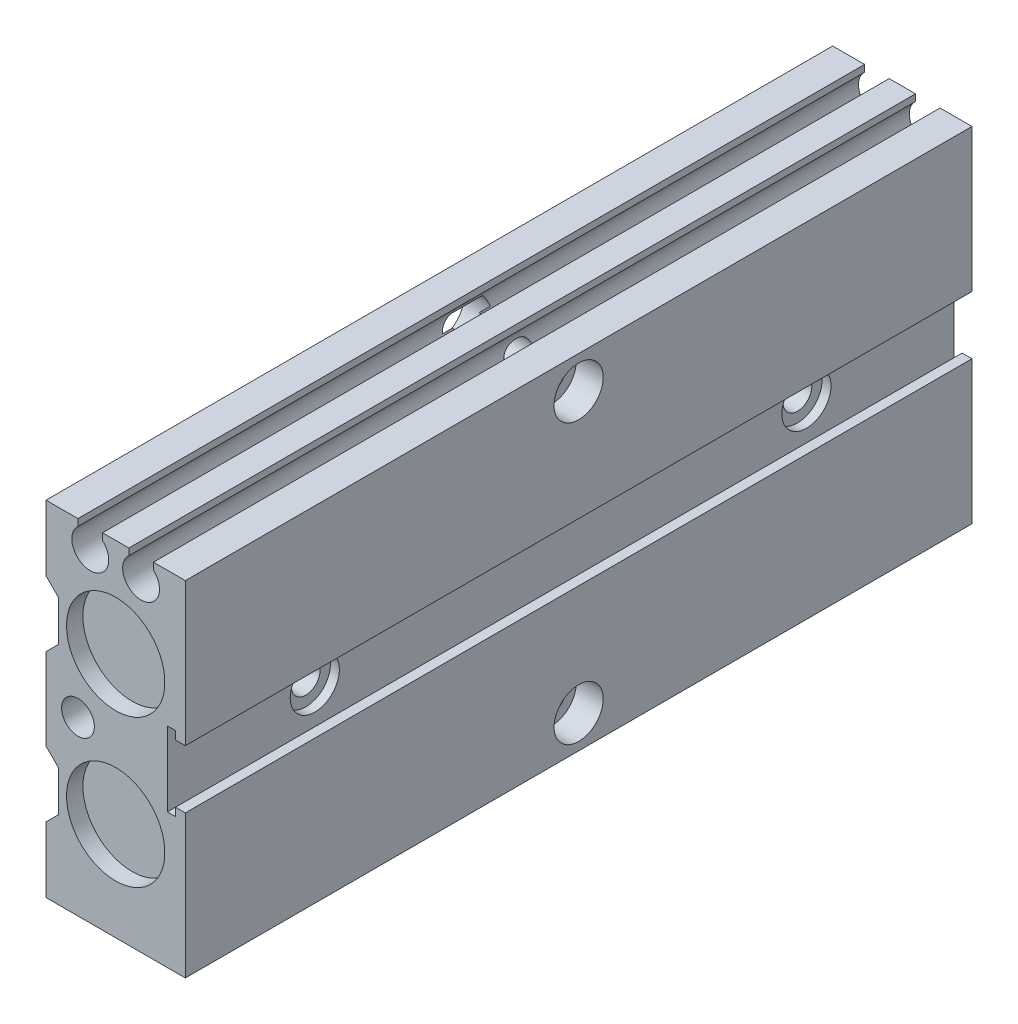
ISO-10303-21;
HEADER;
FILE_DESCRIPTION(('STEP AP214'),'2;1');
FILE_NAME('part.step','',(''),(''),'','','');
FILE_SCHEMA(('AUTOMOTIVE_DESIGN { 1 0 10303 214 1 1 1 1 }'));
ENDSEC;
DATA;
#1=APPLICATION_CONTEXT('core data for automotive mechanical design processes');
#2=APPLICATION_PROTOCOL_DEFINITION('international standard','automotive_design',2000,#1);
#3=PRODUCT_CONTEXT('',#1,'mechanical');
#4=PRODUCT('Part','Part','',(#3));
#5=PRODUCT_RELATED_PRODUCT_CATEGORY('part','',(#4));
#6=PRODUCT_DEFINITION_FORMATION('','',#4);
#7=PRODUCT_DEFINITION_CONTEXT('part definition',#1,'design');
#8=PRODUCT_DEFINITION('design','',#6,#7);
#9=PRODUCT_DEFINITION_SHAPE('','',#8);
#10=(LENGTH_UNIT() NAMED_UNIT(*) SI_UNIT(.MILLI.,.METRE.));
#11=(NAMED_UNIT(*) PLANE_ANGLE_UNIT() SI_UNIT($,.RADIAN.));
#12=(NAMED_UNIT(*) SI_UNIT($,.STERADIAN.) SOLID_ANGLE_UNIT());
#13=UNCERTAINTY_MEASURE_WITH_UNIT(LENGTH_MEASURE(1.E-05),#10,'distance_accuracy_value','');
#14=(GEOMETRIC_REPRESENTATION_CONTEXT(3) GLOBAL_UNCERTAINTY_ASSIGNED_CONTEXT((#13)) GLOBAL_UNIT_ASSIGNED_CONTEXT((#10,
#11,#12)) REPRESENTATION_CONTEXT('',''));
#15=CARTESIAN_POINT('',(0.,0.,0.));
#16=DIRECTION('',(0.,0.,1.));
#17=DIRECTION('',(1.,0.,0.));
#18=AXIS2_PLACEMENT_3D('',#15,#16,#17);
#19=CARTESIAN_POINT('',(0.,0.,64.));
#20=DIRECTION('',(0.,0.,1.));
#21=DIRECTION('',(1.,0.,0.));
#22=AXIS2_PLACEMENT_3D('',#19,#20,#21);
#23=PLANE('',#22);
#24=CARTESIAN_POINT('',(0.,9.,64.));
#25=DIRECTION('',(0.,0.,1.));
#26=DIRECTION('',(1.,0.,0.));
#27=AXIS2_PLACEMENT_3D('',#24,#25,#26);
#28=CIRCLE('',#27,6.);
#29=CARTESIAN_POINT('',(6.,9.,64.));
#30=VERTEX_POINT('',#29);
#31=EDGE_CURVE('E696',#30,#30,#28,.F.);
#32=ORIENTED_EDGE('',*,*,#31,.F.);
#33=EDGE_LOOP('',(#32));
#34=FACE_BOUND('',#33,.T.);
#35=DIRECTION('',(-0.866025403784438,0.5,0.));
#36=VECTOR('',#35,1.);
#37=CARTESIAN_POINT('',(-4.6,-2.88675134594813,64.));
#38=LINE('',#37,#36);
#39=CARTESIAN_POINT('',(-4.6,-2.88675134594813,64.));
#40=VERTEX_POINT('',#39);
#41=CARTESIAN_POINT('',(-7.1,-1.44337567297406,64.));
#42=VERTEX_POINT('',#41);
#43=EDGE_CURVE('E589',#40,#42,#38,.T.);
#44=ORIENTED_EDGE('',*,*,#43,.F.);
#45=DIRECTION('',(-0.866025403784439,-0.5,0.));
#46=VECTOR('',#45,1.);
#47=CARTESIAN_POINT('',(-2.1,-1.44337567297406,64.));
#48=LINE('',#47,#46);
#49=CARTESIAN_POINT('',(-2.1,-1.44337567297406,64.));
#50=VERTEX_POINT('',#49);
#51=EDGE_CURVE('E576',#50,#40,#48,.T.);
#52=ORIENTED_EDGE('',*,*,#51,.F.);
#53=DIRECTION('',(0.,1.,0.));
#54=VECTOR('',#53,1.);
#55=CARTESIAN_POINT('',(-2.1,0.,64.));
#56=LINE('',#55,#54);
#57=CARTESIAN_POINT('',(-2.1,1.44337567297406,64.));
#58=VERTEX_POINT('',#57);
#59=EDGE_CURVE('E570',#58,#50,#56,.F.);
#60=ORIENTED_EDGE('',*,*,#59,.F.);
#61=DIRECTION('',(0.866025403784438,-0.500000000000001,0.));
#62=VECTOR('',#61,1.);
#63=CARTESIAN_POINT('',(-4.6,2.88675134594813,64.));
#64=LINE('',#63,#62);
#65=CARTESIAN_POINT('',(-4.6,2.88675134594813,64.));
#66=VERTEX_POINT('',#65);
#67=EDGE_CURVE('E564',#66,#58,#64,.T.);
#68=ORIENTED_EDGE('',*,*,#67,.F.);
#69=DIRECTION('',(0.866025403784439,0.499999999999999,0.));
#70=VECTOR('',#69,1.);
#71=CARTESIAN_POINT('',(-7.1,1.44337567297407,64.));
#72=LINE('',#71,#70);
#73=CARTESIAN_POINT('',(-7.1,1.44337567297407,64.));
#74=VERTEX_POINT('',#73);
#75=EDGE_CURVE('E496',#74,#66,#72,.T.);
#76=ORIENTED_EDGE('',*,*,#75,.F.);
#77=DIRECTION('',(0.,1.,0.));
#78=VECTOR('',#77,1.);
#79=CARTESIAN_POINT('',(-7.1,0.,64.));
#80=LINE('',#79,#78);
#81=EDGE_CURVE('E598',#42,#74,#80,.T.);
#82=ORIENTED_EDGE('',*,*,#81,.F.);
#83=EDGE_LOOP('',(#44,#52,#60,#68,#76,#82));
#84=FACE_BOUND('',#83,.T.);
#85=CARTESIAN_POINT('',(0.,-9.,64.));
#86=DIRECTION('',(0.,0.,1.));
#87=DIRECTION('',(1.,0.,0.));
#88=AXIS2_PLACEMENT_3D('',#85,#86,#87);
#89=CIRCLE('',#88,6.);
#90=CARTESIAN_POINT('',(6.,-9.,64.));
#91=VERTEX_POINT('',#90);
#92=EDGE_CURVE('E827',#91,#91,#89,.F.);
#93=ORIENTED_EDGE('',*,*,#92,.F.);
#94=EDGE_LOOP('',(#93));
#95=FACE_BOUND('',#94,.T.);
#96=DIRECTION('',(1.,0.,0.));
#97=VECTOR('',#96,1.);
#98=CARTESIAN_POINT('',(0.,21.,64.));
#99=LINE('',#98,#97);
#100=CARTESIAN_POINT('',(8.5,21.,64.));
#101=VERTEX_POINT('',#100);
#102=CARTESIAN_POINT('',(4.6074375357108,21.,64.));
#103=VERTEX_POINT('',#102);
#104=EDGE_CURVE('E451',#101,#103,#99,.F.);
#105=ORIENTED_EDGE('',*,*,#104,.F.);
#106=DIRECTION('',(0.,1.,0.));
#107=VECTOR('',#106,1.);
#108=CARTESIAN_POINT('',(8.5,0.,64.));
#109=LINE('',#108,#107);
#110=CARTESIAN_POINT('',(8.5,3.55,64.));
#111=VERTEX_POINT('',#110);
#112=EDGE_CURVE('E664',#111,#101,#109,.T.);
#113=ORIENTED_EDGE('',*,*,#112,.F.);
#114=DIRECTION('',(1.,0.,0.));
#115=VECTOR('',#114,1.);
#116=CARTESIAN_POINT('',(7.29977257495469,3.55,64.));
#117=LINE('',#116,#115);
#118=CARTESIAN_POINT('',(7.29977257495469,3.55,64.));
#119=VERTEX_POINT('',#118);
#120=EDGE_CURVE('E444',#111,#119,#117,.F.);
#121=ORIENTED_EDGE('',*,*,#120,.T.);
#122=DIRECTION('',(0.,1.,0.));
#123=VECTOR('',#122,1.);
#124=CARTESIAN_POINT('',(7.29977257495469,4.55,64.));
#125=LINE('',#124,#123);
#126=CARTESIAN_POINT('',(7.29977257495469,4.55,64.));
#127=VERTEX_POINT('',#126);
#128=EDGE_CURVE('E441',#119,#127,#125,.T.);
#129=ORIENTED_EDGE('',*,*,#128,.T.);
#130=DIRECTION('',(1.,0.,0.));
#131=VECTOR('',#130,1.);
#132=CARTESIAN_POINT('',(6.3,4.55,64.));
#133=LINE('',#132,#131);
#134=CARTESIAN_POINT('',(6.3,4.55,64.));
#135=VERTEX_POINT('',#134);
#136=EDGE_CURVE('E443',#127,#135,#133,.F.);
#137=ORIENTED_EDGE('',*,*,#136,.T.);
#138=DIRECTION('',(0.,1.,0.));
#139=VECTOR('',#138,1.);
#140=CARTESIAN_POINT('',(6.3,0.,64.));
#141=LINE('',#140,#139);
#142=CARTESIAN_POINT('',(6.3,-4.55,64.));
#143=VERTEX_POINT('',#142);
#144=EDGE_CURVE('E744',#143,#135,#141,.T.);
#145=ORIENTED_EDGE('',*,*,#144,.F.);
#146=DIRECTION('',(1.,0.,0.));
#147=VECTOR('',#146,1.);
#148=CARTESIAN_POINT('',(7.3,-4.55,64.));
#149=LINE('',#148,#147);
#150=CARTESIAN_POINT('',(7.3,-4.55,64.));
#151=VERTEX_POINT('',#150);
#152=EDGE_CURVE('E534',#143,#151,#149,.T.);
#153=ORIENTED_EDGE('',*,*,#152,.T.);
#154=DIRECTION('',(0.,1.,0.));
#155=VECTOR('',#154,1.);
#156=CARTESIAN_POINT('',(7.3,-3.55,64.));
#157=LINE('',#156,#155);
#158=CARTESIAN_POINT('',(7.3,-3.55,64.));
#159=VERTEX_POINT('',#158);
#160=EDGE_CURVE('E539',#151,#159,#157,.T.);
#161=ORIENTED_EDGE('',*,*,#160,.T.);
#162=DIRECTION('',(1.,0.,0.));
#163=VECTOR('',#162,1.);
#164=CARTESIAN_POINT('',(0.,-3.55,64.));
#165=LINE('',#164,#163);
#166=CARTESIAN_POINT('',(8.5,-3.55,64.));
#167=VERTEX_POINT('',#166);
#168=EDGE_CURVE('E264',#167,#159,#165,.F.);
#169=ORIENTED_EDGE('',*,*,#168,.F.);
#170=DIRECTION('',(0.,1.,0.));
#171=VECTOR('',#170,1.);
#172=CARTESIAN_POINT('',(8.5,21.,64.));
#173=LINE('',#172,#171);
#174=CARTESIAN_POINT('',(8.5,-21.,64.));
#175=VERTEX_POINT('',#174);
#176=EDGE_CURVE('E251',#175,#167,#173,.T.);
#177=ORIENTED_EDGE('',*,*,#176,.F.);
#178=DIRECTION('',(1.,0.,0.));
#179=VECTOR('',#178,1.);
#180=CARTESIAN_POINT('',(0.,-21.,64.));
#181=LINE('',#180,#179);
#182=CARTESIAN_POINT('',(-8.5,-21.,64.));
#183=VERTEX_POINT('',#182);
#184=EDGE_CURVE('E241',#183,#175,#181,.T.);
#185=ORIENTED_EDGE('',*,*,#184,.F.);
#186=DIRECTION('',(0.,1.,0.));
#187=VECTOR('',#186,1.);
#188=CARTESIAN_POINT('',(-8.5,0.,64.));
#189=LINE('',#188,#187);
#190=CARTESIAN_POINT('',(-8.5,-13.,64.));
#191=VERTEX_POINT('',#190);
#192=EDGE_CURVE('E653',#191,#183,#189,.F.);
#193=ORIENTED_EDGE('',*,*,#192,.F.);
#194=DIRECTION('',(-0.707106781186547,-0.707106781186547,0.));
#195=VECTOR('',#194,1.);
#196=CARTESIAN_POINT('',(-7.,-11.5,64.));
#197=LINE('',#196,#195);
#198=CARTESIAN_POINT('',(-7.,-11.5,64.));
#199=VERTEX_POINT('',#198);
#200=EDGE_CURVE('E649',#199,#191,#197,.T.);
#201=ORIENTED_EDGE('',*,*,#200,.F.);
#202=DIRECTION('',(0.,1.,0.));
#203=VECTOR('',#202,1.);
#204=CARTESIAN_POINT('',(-7.,0.,64.));
#205=LINE('',#204,#203);
#206=CARTESIAN_POINT('',(-7.,-6.5,64.));
#207=VERTEX_POINT('',#206);
#208=EDGE_CURVE('E646',#207,#199,#205,.F.);
#209=ORIENTED_EDGE('',*,*,#208,.F.);
#210=DIRECTION('',(0.707106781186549,-0.707106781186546,0.));
#211=VECTOR('',#210,1.);
#212=CARTESIAN_POINT('',(-8.5,-5.,64.));
#213=LINE('',#212,#211);
#214=CARTESIAN_POINT('',(-8.5,-5.,64.));
#215=VERTEX_POINT('',#214);
#216=EDGE_CURVE('E643',#215,#207,#213,.T.);
#217=ORIENTED_EDGE('',*,*,#216,.F.);
#218=DIRECTION('',(0.,1.,0.));
#219=VECTOR('',#218,1.);
#220=CARTESIAN_POINT('',(-8.5,0.,64.));
#221=LINE('',#220,#219);
#222=CARTESIAN_POINT('',(-8.5,5.,64.));
#223=VERTEX_POINT('',#222);
#224=EDGE_CURVE('E639',#223,#215,#221,.F.);
#225=ORIENTED_EDGE('',*,*,#224,.F.);
#226=DIRECTION('',(-0.707106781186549,-0.707106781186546,0.));
#227=VECTOR('',#226,1.);
#228=CARTESIAN_POINT('',(-7.,6.5,64.));
#229=LINE('',#228,#227);
#230=CARTESIAN_POINT('',(-7.,6.5,64.));
#231=VERTEX_POINT('',#230);
#232=EDGE_CURVE('E635',#231,#223,#229,.T.);
#233=ORIENTED_EDGE('',*,*,#232,.F.);
#234=DIRECTION('',(0.,1.,0.));
#235=VECTOR('',#234,1.);
#236=CARTESIAN_POINT('',(-7.,0.,64.));
#237=LINE('',#236,#235);
#238=CARTESIAN_POINT('',(-7.,11.5,64.));
#239=VERTEX_POINT('',#238);
#240=EDGE_CURVE('E632',#239,#231,#237,.F.);
#241=ORIENTED_EDGE('',*,*,#240,.F.);
#242=DIRECTION('',(0.707106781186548,-0.707106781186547,0.));
#243=VECTOR('',#242,1.);
#244=CARTESIAN_POINT('',(-8.5,13.,64.));
#245=LINE('',#244,#243);
#246=CARTESIAN_POINT('',(-8.5,13.,64.));
#247=VERTEX_POINT('',#246);
#248=EDGE_CURVE('E629',#247,#239,#245,.T.);
#249=ORIENTED_EDGE('',*,*,#248,.F.);
#250=DIRECTION('',(0.,1.,0.));
#251=VECTOR('',#250,1.);
#252=CARTESIAN_POINT('',(-8.5,0.,64.));
#253=LINE('',#252,#251);
#254=CARTESIAN_POINT('',(-8.5,21.,64.));
#255=VERTEX_POINT('',#254);
#256=EDGE_CURVE('E626',#255,#247,#253,.F.);
#257=ORIENTED_EDGE('',*,*,#256,.F.);
#258=DIRECTION('',(1.,0.,0.));
#259=VECTOR('',#258,1.);
#260=CARTESIAN_POINT('',(0.,21.,64.));
#261=LINE('',#260,#259);
#262=CARTESIAN_POINT('',(-4.6074375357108,21.,64.));
#263=VERTEX_POINT('',#262);
#264=EDGE_CURVE('E427',#263,#255,#261,.F.);
#265=ORIENTED_EDGE('',*,*,#264,.F.);
#266=DIRECTION('',(0.,1.,0.));
#267=VECTOR('',#266,1.);
#268=CARTESIAN_POINT('',(-4.6074375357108,20.1703688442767,64.));
#269=LINE('',#268,#267);
#270=CARTESIAN_POINT('',(-4.6074375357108,20.1703688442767,64.));
#271=VERTEX_POINT('',#270);
#272=EDGE_CURVE('E514',#263,#271,#269,.F.);
#273=ORIENTED_EDGE('',*,*,#272,.T.);
#274=CARTESIAN_POINT('',(-3.1,18.5,64.));
#275=DIRECTION('',(0.,0.,1.));
#276=DIRECTION('',(1.,0.,0.));
#277=AXIS2_PLACEMENT_3D('',#274,#275,#276);
#278=CIRCLE('',#277,2.25);
#279=CARTESIAN_POINT('',(-1.6074375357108,20.1836737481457,64.));
#280=VERTEX_POINT('',#279);
#281=EDGE_CURVE('E440',#280,#271,#278,.F.);
#282=ORIENTED_EDGE('',*,*,#281,.F.);
#283=DIRECTION('',(0.,1.,0.));
#284=VECTOR('',#283,1.);
#285=CARTESIAN_POINT('',(-1.6074375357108,21.,64.));
#286=LINE('',#285,#284);
#287=CARTESIAN_POINT('',(-1.6074375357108,21.,64.));
#288=VERTEX_POINT('',#287);
#289=EDGE_CURVE('E516',#280,#288,#286,.T.);
#290=ORIENTED_EDGE('',*,*,#289,.T.);
#291=DIRECTION('',(1.,0.,0.));
#292=VECTOR('',#291,1.);
#293=CARTESIAN_POINT('',(0.,21.,64.));
#294=LINE('',#293,#292);
#295=CARTESIAN_POINT('',(1.6074375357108,21.,64.));
#296=VERTEX_POINT('',#295);
#297=EDGE_CURVE('E497',#296,#288,#294,.F.);
#298=ORIENTED_EDGE('',*,*,#297,.F.);
#299=DIRECTION('',(0.,1.,0.));
#300=VECTOR('',#299,1.);
#301=CARTESIAN_POINT('',(1.6074375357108,20.1836737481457,64.));
#302=LINE('',#301,#300);
#303=CARTESIAN_POINT('',(1.6074375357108,20.1836737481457,64.));
#304=VERTEX_POINT('',#303);
#305=EDGE_CURVE('E527',#296,#304,#302,.F.);
#306=ORIENTED_EDGE('',*,*,#305,.T.);
#307=CARTESIAN_POINT('',(3.1,18.5,64.));
#308=DIRECTION('',(0.,0.,1.));
#309=DIRECTION('',(1.,0.,0.));
#310=AXIS2_PLACEMENT_3D('',#307,#308,#309);
#311=CIRCLE('',#310,2.25);
#312=CARTESIAN_POINT('',(4.59256246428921,20.1836737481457,64.));
#313=VERTEX_POINT('',#312);
#314=EDGE_CURVE('E490',#313,#304,#311,.F.);
#315=ORIENTED_EDGE('',*,*,#314,.F.);
#316=DIRECTION('',(1.,0.,0.));
#317=VECTOR('',#316,1.);
#318=CARTESIAN_POINT('',(4.6074375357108,20.1836737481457,64.));
#319=LINE('',#318,#317);
#320=CARTESIAN_POINT('',(4.6074375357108,20.1836737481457,64.));
#321=VERTEX_POINT('',#320);
#322=EDGE_CURVE('E471',#313,#321,#319,.T.);
#323=ORIENTED_EDGE('',*,*,#322,.T.);
#324=DIRECTION('',(0.,1.,0.));
#325=VECTOR('',#324,1.);
#326=CARTESIAN_POINT('',(4.6074375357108,21.,64.));
#327=LINE('',#326,#325);
#328=EDGE_CURVE('E51',#321,#103,#327,.T.);
#329=ORIENTED_EDGE('',*,*,#328,.T.);
#330=EDGE_LOOP('',(#105,#113,#121,#129,#137,#145,#153,#161,#169,#177,#185,#193,#201,#209,#217,
#225,#233,#241,#249,#257,#265,#273,#282,#290,#298,#306,#315,#323,#329));
#331=FACE_BOUND('',#330,.T.);
#332=ADVANCED_FACE('F34',(#34,#84,#95,#331),#23,.F.);
#333=CARTESIAN_POINT('',(-4.6,0.,58.));
#334=DIRECTION('',(0.,0.,1.));
#335=DIRECTION('',(1.,0.,0.));
#336=AXIS2_PLACEMENT_3D('',#333,#334,#335);
#337=PLANE('',#336);
#338=CARTESIAN_POINT('',(-4.6,0.,57.9999999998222));
#339=DIRECTION('',(0.,0.,1.));
#340=DIRECTION('',(1.,0.,0.));
#341=AXIS2_PLACEMENT_3D('',#338,#339,#340);
#342=CIRCLE('',#341,2.45324450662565);
#343=CARTESIAN_POINT('',(-2.14675549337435,0.,57.9999999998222));
#344=VERTEX_POINT('',#343);
#345=EDGE_CURVE('E609',#344,#344,#342,.T.);
#346=ORIENTED_EDGE('',*,*,#345,.F.);
#347=EDGE_LOOP('',(#346));
#348=FACE_BOUND('',#347,.T.);
#349=ADVANCED_FACE('F798',(#348),#337,.F.);
#350=CARTESIAN_POINT('',(-4.6,0.,58.4647051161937));
#351=DIRECTION('',(0.,0.,1.));
#352=DIRECTION('',(1.,0.,0.));
#353=AXIS2_PLACEMENT_3D('',#350,#351,#352);
#354=CONICAL_SURFACE('',#353,2.88935238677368,0.753662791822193);
#355=ORIENTED_EDGE('',*,*,#345,.T.);
#356=EDGE_LOOP('',(#355));
#357=FACE_BOUND('',#356,.T.);
#358=CARTESIAN_POINT('',(-4.59999999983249,-2.8867513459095,58.4619335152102));
#359=CARTESIAN_POINT('',(-4.51861259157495,-2.83976230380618,58.4119164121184));
#360=CARTESIAN_POINT('',(-4.43581636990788,-2.79195988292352,58.3645945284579));
#361=CARTESIAN_POINT('',(-4.26680584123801,-2.69438160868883,58.2772556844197));
#362=CARTESIAN_POINT('',(-4.18057389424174,-2.64459557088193,58.2372846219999));
#363=CARTESIAN_POINT('',(-4.00636799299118,-2.54401774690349,58.1677367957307));
#364=CARTESIAN_POINT('',(-3.91843851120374,-2.49325163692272,58.138015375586));
#365=CARTESIAN_POINT('',(-3.74032630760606,-2.39041850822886,58.0906658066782));
#366=CARTESIAN_POINT('',(-3.65015000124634,-2.33835519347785,58.073006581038));
#367=CARTESIAN_POINT('',(-3.49702893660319,-2.24995070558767,58.0548606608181));
#368=CARTESIAN_POINT('',(-3.43439961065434,-2.21379164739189,58.0507280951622));
#369=CARTESIAN_POINT('',(-3.30905384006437,-2.14142323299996,58.0491830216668));
#370=CARTESIAN_POINT('',(-3.24633737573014,-2.10521386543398,58.0517724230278));
#371=CARTESIAN_POINT('',(-3.12131666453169,-2.03303312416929,58.0635402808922));
#372=CARTESIAN_POINT('',(-3.05901288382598,-1.99706201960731,58.0727252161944));
#373=CARTESIAN_POINT('',(-2.93532932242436,-1.92565328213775,58.0972014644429));
#374=CARTESIAN_POINT('',(-2.87394947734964,-1.89021561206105,58.1124923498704));
#375=CARTESIAN_POINT('',(-2.75093762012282,-1.81919468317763,58.1489160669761));
#376=CARTESIAN_POINT('',(-2.68933532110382,-1.78362857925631,58.1701810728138));
#377=CARTESIAN_POINT('',(-2.56752940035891,-1.71330389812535,58.217566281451));
#378=CARTESIAN_POINT('',(-2.5073264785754,-1.67854572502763,58.243688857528));
#379=CARTESIAN_POINT('',(-2.38842538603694,-1.60989814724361,58.2999565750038));
#380=CARTESIAN_POINT('',(-2.32972595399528,-1.57600801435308,58.3300982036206));
#381=CARTESIAN_POINT('',(-2.21380183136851,-1.50907919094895,58.3936943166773));
#382=CARTESIAN_POINT('',(-2.15657487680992,-1.47603919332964,58.4271432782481));
#383=CARTESIAN_POINT('',(-2.10000000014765,-1.44337567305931,58.4619335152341));
#384=B_SPLINE_CURVE_WITH_KNOTS('',3,(#358,#359,#360,#361,#362,#363,#364,#365,#366,#367,#368,
#369,#370,#371,#372,#373,#374,#375,#376,#377,#378,#379,#380,#381,#382,#383),.UNSPECIFIED.,.F.,
.F.,(4,2,2,2,2,2,2,2,2,2,2,2,4),(0.,0.319591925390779,0.641116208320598,0.957896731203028,
1.27385799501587,1.49087556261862,1.70795477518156,1.92524751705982,2.14252504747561,
2.36505021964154,2.5876843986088,2.81012524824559,3.03220072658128),.UNSPECIFIED.);
#385=CARTESIAN_POINT('',(-4.6,-2.88675134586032,58.4619335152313));
#386=VERTEX_POINT('',#385);
#387=CARTESIAN_POINT('',(-2.10000000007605,-1.44337567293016,58.4619335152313));
#388=VERTEX_POINT('',#387);
#389=EDGE_CURVE('E396',#386,#388,#384,.T.);
#390=ORIENTED_EDGE('',*,*,#389,.F.);
#391=CARTESIAN_POINT('',(-7.0999999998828,-1.44337567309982,58.4619335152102));
#392=CARTESIAN_POINT('',(-7.01861259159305,-1.49036471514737,58.4119164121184));
#393=CARTESIAN_POINT('',(-6.93581636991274,-1.53816713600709,58.3645945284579));
#394=CARTESIAN_POINT('',(-6.76680584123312,-1.63574541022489,58.2772556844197));
#395=CARTESIAN_POINT('',(-6.68057389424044,-1.685531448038,58.237284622));
#396=CARTESIAN_POINT('',(-6.50636799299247,-1.78610927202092,58.1677367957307));
#397=CARTESIAN_POINT('',(-6.41843851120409,-1.83687538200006,58.138015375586));
#398=CARTESIAN_POINT('',(-6.24032630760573,-1.93970851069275,58.0906658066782));
#399=CARTESIAN_POINT('',(-6.15015000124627,-1.99177182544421,58.073006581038));
#400=CARTESIAN_POINT('',(-5.99702893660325,-2.08017631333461,58.0548606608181));
#401=CARTESIAN_POINT('',(-5.93439961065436,-2.11633537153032,58.0507280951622));
#402=CARTESIAN_POINT('',(-5.80905384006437,-2.1887037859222,58.0491830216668));
#403=CARTESIAN_POINT('',(-5.74633737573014,-2.2249131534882,58.0517724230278));
#404=CARTESIAN_POINT('',(-5.6213166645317,-2.2970938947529,58.0635402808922));
#405=CARTESIAN_POINT('',(-5.55901288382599,-2.33306499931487,58.0727252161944));
#406=CARTESIAN_POINT('',(-5.43532932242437,-2.40447373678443,58.0972014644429));
#407=CARTESIAN_POINT('',(-5.37394947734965,-2.43991140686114,58.1124923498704));
#408=CARTESIAN_POINT('',(-5.25093762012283,-2.51093233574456,58.1489160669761));
#409=CARTESIAN_POINT('',(-5.18933532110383,-2.54649843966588,58.1701810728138));
#410=CARTESIAN_POINT('',(-5.06752940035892,-2.61682312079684,58.217566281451));
#411=CARTESIAN_POINT('',(-5.0073264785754,-2.65158129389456,58.243688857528));
#412=CARTESIAN_POINT('',(-4.88842538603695,-2.72022887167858,58.2999565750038));
#413=CARTESIAN_POINT('',(-4.82972595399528,-2.75411900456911,58.3300982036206));
#414=CARTESIAN_POINT('',(-4.71380183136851,-2.82104782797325,58.3936943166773));
#415=CARTESIAN_POINT('',(-4.65657487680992,-2.85408782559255,58.4271432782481));
#416=CARTESIAN_POINT('',(-4.60000000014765,-2.88675134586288,58.4619335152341));
#417=B_SPLINE_CURVE_WITH_KNOTS('',3,(#391,#392,#393,#394,#395,#396,#397,#398,#399,#400,#401,
#402,#403,#404,#405,#406,#407,#408,#409,#410,#411,#412,#413,#414,#415,#416),.UNSPECIFIED.,.F.,
.F.,(4,2,2,2,2,2,2,2,2,2,2,2,4),(0.,0.319591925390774,0.641116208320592,0.957896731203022,
1.27385799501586,1.4908755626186,1.70795477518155,1.92524751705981,2.1425250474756,
2.36505021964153,2.58768439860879,2.81012524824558,3.03220072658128),.UNSPECIFIED.);
#418=CARTESIAN_POINT('',(-7.09999999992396,-1.44337567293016,58.4619335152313));
#419=VERTEX_POINT('',#418);
#420=EDGE_CURVE('E390',#419,#386,#417,.T.);
#421=ORIENTED_EDGE('',*,*,#420,.F.);
#422=CARTESIAN_POINT('',(-7.10000000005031,1.44337567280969,58.4619335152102));
#423=CARTESIAN_POINT('',(-7.10000000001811,1.34939758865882,58.4119164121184));
#424=CARTESIAN_POINT('',(-7.10000000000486,1.25379274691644,58.3645945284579));
#425=CARTESIAN_POINT('',(-7.09999999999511,1.05863619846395,58.2772556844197));
#426=CARTESIAN_POINT('',(-7.0999999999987,0.959064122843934,58.237284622));
#427=CARTESIAN_POINT('',(-7.10000000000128,0.75790847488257,58.1677367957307));
#428=CARTESIAN_POINT('',(-7.10000000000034,0.656376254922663,58.138015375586));
#429=CARTESIAN_POINT('',(-7.09999999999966,0.450709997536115,58.0906658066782));
#430=CARTESIAN_POINT('',(-7.09999999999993,0.346583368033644,58.073006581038));
#431=CARTESIAN_POINT('',(-7.10000000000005,0.169774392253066,58.0548606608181));
#432=CARTESIAN_POINT('',(-7.10000000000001,0.0974562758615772,58.0507280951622));
#433=CARTESIAN_POINT('',(-7.09999999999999,-0.047280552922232,58.0491830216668));
#434=CARTESIAN_POINT('',(-7.1,-0.119699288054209,58.0517724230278));
#435=CARTESIAN_POINT('',(-7.1,-0.26406077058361,58.0635402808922));
#436=CARTESIAN_POINT('',(-7.1,-0.336002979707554,58.0727252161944));
#437=CARTESIAN_POINT('',(-7.1,-0.478820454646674,58.0972014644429));
#438=CARTESIAN_POINT('',(-7.1,-0.549695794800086,58.1124923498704));
#439=CARTESIAN_POINT('',(-7.1,-0.691737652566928,58.1489160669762));
#440=CARTESIAN_POINT('',(-7.1,-0.76286986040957,58.1701810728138));
#441=CARTESIAN_POINT('',(-7.1,-0.903519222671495,58.217566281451));
#442=CARTESIAN_POINT('',(-7.1,-0.973035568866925,58.243688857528));
#443=CARTESIAN_POINT('',(-7.1,-1.11033072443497,58.2999565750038));
#444=CARTESIAN_POINT('',(-7.1,-1.17811099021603,58.3300982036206));
#445=CARTESIAN_POINT('',(-7.1,-1.3119686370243,58.3936943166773));
#446=CARTESIAN_POINT('',(-7.1,-1.37804863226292,58.4271432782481));
#447=CARTESIAN_POINT('',(-7.1,-1.44337567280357,58.4619335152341));
#448=B_SPLINE_CURVE_WITH_KNOTS('',3,(#422,#423,#424,#425,#426,#427,#428,#429,#430,#431,#432,
#433,#434,#435,#436,#437,#438,#439,#440,#441,#442,#443,#444,#445,#446,#447),.UNSPECIFIED.,.F.,
.F.,(4,2,2,2,2,2,2,2,2,2,2,2,4),(0.,0.319591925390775,0.641116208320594,0.957896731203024,
1.27385799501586,1.49087556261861,1.70795477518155,1.92524751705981,2.1425250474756,
2.36505021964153,2.5876843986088,2.81012524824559,3.03220072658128),.UNSPECIFIED.);
#449=CARTESIAN_POINT('',(-7.1,1.44337567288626,58.4619335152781));
#450=VERTEX_POINT('',#449);
#451=EDGE_CURVE('E379',#450,#419,#448,.T.);
#452=ORIENTED_EDGE('',*,*,#451,.F.);
#453=CARTESIAN_POINT('',(-4.60000000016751,2.8867513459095,58.4619335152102));
#454=CARTESIAN_POINT('',(-4.68138740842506,2.83976230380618,58.4119164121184));
#455=CARTESIAN_POINT('',(-4.76418363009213,2.79195988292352,58.3645945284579));
#456=CARTESIAN_POINT('',(-4.933194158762,2.69438160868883,58.2772556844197));
#457=CARTESIAN_POINT('',(-5.01942610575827,2.64459557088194,58.237284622));
#458=CARTESIAN_POINT('',(-5.19363200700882,2.54401774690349,58.1677367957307));
#459=CARTESIAN_POINT('',(-5.28156148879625,2.49325163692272,58.138015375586));
#460=CARTESIAN_POINT('',(-5.45967369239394,2.39041850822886,58.0906658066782));
#461=CARTESIAN_POINT('',(-5.54984999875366,2.33835519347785,58.073006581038));
#462=CARTESIAN_POINT('',(-5.70297106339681,2.24995070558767,58.0548606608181));
#463=CARTESIAN_POINT('',(-5.76560038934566,2.2137916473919,58.0507280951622));
#464=CARTESIAN_POINT('',(-5.89094615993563,2.14142323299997,58.0491830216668));
#465=CARTESIAN_POINT('',(-5.95366262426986,2.10521386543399,58.0517724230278));
#466=CARTESIAN_POINT('',(-6.07868333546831,2.03303312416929,58.0635402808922));
#467=CARTESIAN_POINT('',(-6.14098711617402,1.99706201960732,58.0727252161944));
#468=CARTESIAN_POINT('',(-6.26467067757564,1.92565328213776,58.0972014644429));
#469=CARTESIAN_POINT('',(-6.32605052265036,1.89021561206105,58.1124923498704));
#470=CARTESIAN_POINT('',(-6.44906237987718,1.81919468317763,58.1489160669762));
#471=CARTESIAN_POINT('',(-6.51066467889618,1.78362857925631,58.1701810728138));
#472=CARTESIAN_POINT('',(-6.63247059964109,1.71330389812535,58.217566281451));
#473=CARTESIAN_POINT('',(-6.69267352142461,1.67854572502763,58.243688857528));
#474=CARTESIAN_POINT('',(-6.81157461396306,1.60989814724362,58.2999565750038));
#475=CARTESIAN_POINT('',(-6.87027404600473,1.57600801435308,58.3300982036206));
#476=CARTESIAN_POINT('',(-6.98619816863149,1.50907919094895,58.3936943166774));
#477=CARTESIAN_POINT('',(-7.04342512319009,1.47603919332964,58.4271432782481));
#478=CARTESIAN_POINT('',(-7.09999999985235,1.44337567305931,58.4619335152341));
#479=B_SPLINE_CURVE_WITH_KNOTS('',3,(#453,#454,#455,#456,#457,#458,#459,#460,#461,#462,#463,
#464,#465,#466,#467,#468,#469,#470,#471,#472,#473,#474,#475,#476,#477,#478),.UNSPECIFIED.,.F.,
.F.,(4,2,2,2,2,2,2,2,2,2,2,2,4),(0.,0.319591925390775,0.641116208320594,0.957896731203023,
1.27385799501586,1.49087556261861,1.70795477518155,1.92524751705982,2.1425250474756,
2.36505021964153,2.58768439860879,2.81012524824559,3.03220072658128),.UNSPECIFIED.);
#480=CARTESIAN_POINT('',(-4.6,2.88675134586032,58.4619335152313));
#481=VERTEX_POINT('',#480);
#482=EDGE_CURVE('E419',#481,#450,#479,.T.);
#483=ORIENTED_EDGE('',*,*,#482,.F.);
#484=CARTESIAN_POINT('',(-2.10000000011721,1.44337567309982,58.4619335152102));
#485=CARTESIAN_POINT('',(-2.18138740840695,1.49036471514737,58.4119164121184));
#486=CARTESIAN_POINT('',(-2.26418363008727,1.53816713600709,58.3645945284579));
#487=CARTESIAN_POINT('',(-2.43319415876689,1.63574541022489,58.2772556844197));
#488=CARTESIAN_POINT('',(-2.51942610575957,1.685531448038,58.2372846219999));
#489=CARTESIAN_POINT('',(-2.69363200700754,1.78610927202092,58.1677367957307));
#490=CARTESIAN_POINT('',(-2.78156148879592,1.83687538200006,58.138015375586));
#491=CARTESIAN_POINT('',(-2.95967369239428,1.93970851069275,58.0906658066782));
#492=CARTESIAN_POINT('',(-3.04984999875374,1.99177182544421,58.073006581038));
#493=CARTESIAN_POINT('',(-3.20297106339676,2.08017631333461,58.0548606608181));
#494=CARTESIAN_POINT('',(-3.26560038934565,2.11633537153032,58.0507280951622));
#495=CARTESIAN_POINT('',(-3.39094615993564,2.18870378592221,58.0491830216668));
#496=CARTESIAN_POINT('',(-3.45366262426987,2.2249131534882,58.0517724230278));
#497=CARTESIAN_POINT('',(-3.57868333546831,2.29709389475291,58.0635402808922));
#498=CARTESIAN_POINT('',(-3.64098711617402,2.33306499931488,58.0727252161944));
#499=CARTESIAN_POINT('',(-3.76467067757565,2.40447373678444,58.0972014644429));
#500=CARTESIAN_POINT('',(-3.82605052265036,2.43991140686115,58.1124923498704));
#501=CARTESIAN_POINT('',(-3.94906237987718,2.51093233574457,58.1489160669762));
#502=CARTESIAN_POINT('',(-4.01066467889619,2.54649843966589,58.1701810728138));
#503=CARTESIAN_POINT('',(-4.13247059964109,2.61682312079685,58.217566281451));
#504=CARTESIAN_POINT('',(-4.19267352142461,2.65158129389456,58.243688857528));
#505=CARTESIAN_POINT('',(-4.31157461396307,2.72022887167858,58.2999565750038));
#506=CARTESIAN_POINT('',(-4.37027404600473,2.75411900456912,58.3300982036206));
#507=CARTESIAN_POINT('',(-4.4861981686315,2.82104782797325,58.3936943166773));
#508=CARTESIAN_POINT('',(-4.54342512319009,2.85408782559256,58.4271432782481));
#509=CARTESIAN_POINT('',(-4.59999999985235,2.88675134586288,58.4619335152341));
#510=B_SPLINE_CURVE_WITH_KNOTS('',3,(#484,#485,#486,#487,#488,#489,#490,#491,#492,#493,#494,
#495,#496,#497,#498,#499,#500,#501,#502,#503,#504,#505,#506,#507,#508,#509),.UNSPECIFIED.,.F.,
.F.,(4,2,2,2,2,2,2,2,2,2,2,2,4),(0.,0.319591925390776,0.641116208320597,0.957896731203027,
1.27385799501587,1.49087556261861,1.70795477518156,1.92524751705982,2.14252504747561,
2.36505021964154,2.5876843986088,2.81012524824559,3.03220072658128),.UNSPECIFIED.);
#511=CARTESIAN_POINT('',(-2.10000000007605,1.44337567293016,58.4619335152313));
#512=VERTEX_POINT('',#511);
#513=EDGE_CURVE('E415',#512,#481,#510,.T.);
#514=ORIENTED_EDGE('',*,*,#513,.F.);
#515=CARTESIAN_POINT('',(-2.0999999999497,-1.44337567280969,58.4619335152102));
#516=CARTESIAN_POINT('',(-2.0999999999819,-1.34939758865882,58.4119164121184));
#517=CARTESIAN_POINT('',(-2.09999999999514,-1.25379274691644,58.3645945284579));
#518=CARTESIAN_POINT('',(-2.10000000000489,-1.05863619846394,58.2772556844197));
#519=CARTESIAN_POINT('',(-2.1000000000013,-0.95906412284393,58.2372846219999));
#520=CARTESIAN_POINT('',(-2.09999999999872,-0.757908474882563,58.1677367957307));
#521=CARTESIAN_POINT('',(-2.09999999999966,-0.656376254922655,58.138015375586));
#522=CARTESIAN_POINT('',(-2.10000000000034,-0.450709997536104,58.0906658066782));
#523=CARTESIAN_POINT('',(-2.10000000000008,-0.346583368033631,58.073006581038));
#524=CARTESIAN_POINT('',(-2.09999999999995,-0.169774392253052,58.0548606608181));
#525=CARTESIAN_POINT('',(-2.09999999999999,-0.0974562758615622,58.0507280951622));
#526=CARTESIAN_POINT('',(-2.10000000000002,0.0472805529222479,58.0491830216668));
#527=CARTESIAN_POINT('',(-2.10000000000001,0.119699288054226,58.0517724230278));
#528=CARTESIAN_POINT('',(-2.1,0.264060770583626,58.0635402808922));
#529=CARTESIAN_POINT('',(-2.1,0.33600297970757,58.0727252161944));
#530=CARTESIAN_POINT('',(-2.1,0.47882045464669,58.0972014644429));
#531=CARTESIAN_POINT('',(-2.1,0.549695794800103,58.1124923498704));
#532=CARTESIAN_POINT('',(-2.1,0.691737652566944,58.1489160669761));
#533=CARTESIAN_POINT('',(-2.1,0.762869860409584,58.1701810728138));
#534=CARTESIAN_POINT('',(-2.1,0.903519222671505,58.217566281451));
#535=CARTESIAN_POINT('',(-2.1,0.973035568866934,58.243688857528));
#536=CARTESIAN_POINT('',(-2.1,1.11033072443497,58.2999565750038));
#537=CARTESIAN_POINT('',(-2.1,1.17811099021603,58.3300982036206));
#538=CARTESIAN_POINT('',(-2.1,1.3119686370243,58.3936943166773));
#539=CARTESIAN_POINT('',(-2.1,1.37804863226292,58.4271432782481));
#540=CARTESIAN_POINT('',(-2.1,1.44337567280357,58.4619335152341));
#541=B_SPLINE_CURVE_WITH_KNOTS('',3,(#515,#516,#517,#518,#519,#520,#521,#522,#523,#524,#525,
#526,#527,#528,#529,#530,#531,#532,#533,#534,#535,#536,#537,#538,#539,#540),.UNSPECIFIED.,.F.,
.F.,(4,2,2,2,2,2,2,2,2,2,2,2,4),(0.,0.319591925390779,0.6411162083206,0.957896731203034,
1.27385799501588,1.49087556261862,1.70795477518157,1.92524751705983,2.14252504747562,
2.36505021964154,2.5876843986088,2.81012524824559,3.03220072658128),.UNSPECIFIED.);
#542=EDGE_CURVE('E411',#388,#512,#541,.T.);
#543=ORIENTED_EDGE('',*,*,#542,.F.);
#544=EDGE_LOOP('',(#390,#421,#452,#483,#514,#543));
#545=FACE_BOUND('',#544,.T.);
#546=ADVANCED_FACE('F394',(#357,#545),#354,.T.);
#547=CARTESIAN_POINT('',(8.5,0.,82.));
#548=DIRECTION('',(-1.,0.,0.));
#549=DIRECTION('',(0.,0.,1.));
#550=AXIS2_PLACEMENT_3D('',#547,#548,#549);
#551=CYLINDRICAL_SURFACE('',#550,1.75);
#552=CARTESIAN_POINT('',(5.2,0.,82.));
#553=DIRECTION('',(-1.,0.,0.));
#554=DIRECTION('',(0.,0.,1.));
#555=AXIS2_PLACEMENT_3D('',#552,#553,#554);
#556=CIRCLE('',#555,1.75);
#557=CARTESIAN_POINT('',(5.2,0.,83.75));
#558=VERTEX_POINT('',#557);
#559=EDGE_CURVE('E1858',#558,#558,#556,.F.);
#560=ORIENTED_EDGE('',*,*,#559,.T.);
#561=EDGE_LOOP('',(#560));
#562=FACE_BOUND('',#561,.T.);
#563=CARTESIAN_POINT('',(-5.2,0.,82.));
#564=DIRECTION('',(-1.,0.,0.));
#565=DIRECTION('',(0.,0.,1.));
#566=AXIS2_PLACEMENT_3D('',#563,#564,#565);
#567=CIRCLE('',#566,1.75);
#568=CARTESIAN_POINT('',(-5.2,0.,83.75));
#569=VERTEX_POINT('',#568);
#570=EDGE_CURVE('E1857',#569,#569,#567,.T.);
#571=ORIENTED_EDGE('',*,*,#570,.T.);
#572=EDGE_LOOP('',(#571));
#573=FACE_BOUND('',#572,.T.);
#574=ADVANCED_FACE('F1066',(#562,#573),#551,.F.);
#575=CARTESIAN_POINT('',(8.5,0.,142.));
#576=DIRECTION('',(-1.,0.,0.));
#577=DIRECTION('',(0.,0.,1.));
#578=AXIS2_PLACEMENT_3D('',#575,#576,#577);
#579=CYLINDRICAL_SURFACE('',#578,1.75);
#580=CARTESIAN_POINT('',(5.2,0.,142.));
#581=DIRECTION('',(-1.,0.,0.));
#582=DIRECTION('',(0.,0.,1.));
#583=AXIS2_PLACEMENT_3D('',#580,#581,#582);
#584=CIRCLE('',#583,1.75);
#585=CARTESIAN_POINT('',(5.2,0.,143.75));
#586=VERTEX_POINT('',#585);
#587=EDGE_CURVE('E1839',#586,#586,#584,.F.);
#588=ORIENTED_EDGE('',*,*,#587,.T.);
#589=EDGE_LOOP('',(#588));
#590=FACE_BOUND('',#589,.T.);
#591=CARTESIAN_POINT('',(-5.2,0.,142.));
#592=DIRECTION('',(-1.,0.,0.));
#593=DIRECTION('',(0.,0.,1.));
#594=AXIS2_PLACEMENT_3D('',#591,#592,#593);
#595=CIRCLE('',#594,1.75);
#596=CARTESIAN_POINT('',(-5.2,0.,143.75));
#597=VERTEX_POINT('',#596);
#598=EDGE_CURVE('E391',#597,#597,#595,.T.);
#599=ORIENTED_EDGE('',*,*,#598,.T.);
#600=EDGE_LOOP('',(#599));
#601=FACE_BOUND('',#600,.T.);
#602=ADVANCED_FACE('F1843',(#590,#601),#579,.F.);
#603=CARTESIAN_POINT('',(-7.1,1.44337567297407,64.));
#604=DIRECTION('',(-1.,0.,0.));
#605=DIRECTION('',(0.,0.,1.));
#606=AXIS2_PLACEMENT_3D('',#603,#604,#605);
#607=PLANE('',#606);
#608=ORIENTED_EDGE('',*,*,#451,.T.);
#609=DIRECTION('',(0.,0.,1.));
#610=VECTOR('',#609,1.);
#611=CARTESIAN_POINT('',(-7.1,-1.44337567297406,64.));
#612=LINE('',#611,#610);
#613=CARTESIAN_POINT('',(-7.10000000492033,-1.44337567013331,61.0380664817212));
#614=VERTEX_POINT('',#613);
#615=EDGE_CURVE('E383',#614,#419,#612,.F.);
#616=ORIENTED_EDGE('',*,*,#615,.F.);
#617=CARTESIAN_POINT('',(-7.10000000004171,1.44337560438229,61.0380665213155));
#618=CARTESIAN_POINT('',(-7.10000000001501,1.34939752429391,61.0880836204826));
#619=CARTESIAN_POINT('',(-7.10000000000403,1.25379268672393,61.1354055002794));
#620=CARTESIAN_POINT('',(-7.09999999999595,1.05863614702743,61.2227443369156));
#621=CARTESIAN_POINT('',(-7.09999999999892,0.959064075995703,61.262715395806));
#622=CARTESIAN_POINT('',(-7.10000000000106,0.757908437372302,61.3322632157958));
#623=CARTESIAN_POINT('',(-7.10000000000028,0.656376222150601,61.3619846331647));
#624=CARTESIAN_POINT('',(-7.09999999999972,0.450709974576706,61.4093341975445));
#625=CARTESIAN_POINT('',(-7.09999999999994,0.346583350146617,61.4269934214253));
#626=CARTESIAN_POINT('',(-7.10000000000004,0.169774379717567,61.4451393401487));
#627=CARTESIAN_POINT('',(-7.10000000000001,0.0974562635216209,61.44927190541));
#628=CARTESIAN_POINT('',(-7.09999999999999,-0.0472805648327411,61.4508169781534));
#629=CARTESIAN_POINT('',(-7.1,-0.119699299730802,61.4482275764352));
#630=CARTESIAN_POINT('',(-7.1,-0.264060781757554,61.4364597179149));
#631=CARTESIAN_POINT('',(-7.1,-0.336002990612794,61.4272747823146));
#632=CARTESIAN_POINT('',(-7.1,-0.478820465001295,61.4027985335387));
#633=CARTESIAN_POINT('',(-7.1,-0.549695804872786,61.3875076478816));
#634=CARTESIAN_POINT('',(-7.1,-0.691737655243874,61.3510839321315));
#635=CARTESIAN_POINT('',(-7.1,-0.762869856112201,61.3298189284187));
#636=CARTESIAN_POINT('',(-7.1,-0.90351920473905,61.2824337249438));
#637=CARTESIAN_POINT('',(-7.1,-0.973035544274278,61.2563111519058));
#638=CARTESIAN_POINT('',(-7.1,-1.11033068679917,61.2000434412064));
#639=CARTESIAN_POINT('',(-7.1,-1.17811094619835,61.1699018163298));
#640=CARTESIAN_POINT('',(-7.1,-1.31196858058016,61.1063057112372));
#641=CARTESIAN_POINT('',(-7.1,-1.37804856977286,61.0728567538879));
#642=CARTESIAN_POINT('',(-7.1,-1.44337560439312,61.0380665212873));
#643=B_SPLINE_CURVE_WITH_KNOTS('',3,(#617,#618,#619,#620,#621,#622,#623,#624,#625,#626,#627,
#628,#629,#630,#631,#632,#633,#634,#635,#636,#637,#638,#639,#640,#641,#642),.UNSPECIFIED.,.F.,
.F.,(4,2,2,2,2,2,2,2,2,2,2,2,4),(0.,0.319591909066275,0.641116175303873,0.95789668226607,
1.27385793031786,1.49087549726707,1.70795470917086,1.92524745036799,2.14252498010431,
2.36505013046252,2.58768428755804,2.81012511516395,3.03220057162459),.UNSPECIFIED.);
#644=CARTESIAN_POINT('',(-7.1,1.44337563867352,61.0380665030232));
#645=VERTEX_POINT('',#644);
#646=EDGE_CURVE('E1834',#645,#614,#643,.T.);
#647=ORIENTED_EDGE('',*,*,#646,.F.);
#648=DIRECTION('',(0.,0.,1.));
#649=VECTOR('',#648,1.);
#650=CARTESIAN_POINT('',(-7.1,1.44337567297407,64.));
#651=LINE('',#650,#649);
#652=EDGE_CURVE('E386',#450,#645,#651,.T.);
#653=ORIENTED_EDGE('',*,*,#652,.F.);
#654=EDGE_LOOP('',(#608,#616,#647,#653));
#655=FACE_BOUND('',#654,.T.);
#656=ADVANCED_FACE('F381',(#655),#607,.T.);
#657=CARTESIAN_POINT('',(-7.1,-1.44337567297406,64.));
#658=DIRECTION('',(-0.5,-0.866025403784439,0.));
#659=DIRECTION('',(0.866025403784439,-0.5,0.));
#660=AXIS2_PLACEMENT_3D('',#657,#658,#659);
#661=PLANE('',#660);
#662=ORIENTED_EDGE('',*,*,#420,.T.);
#663=DIRECTION('',(0.,0.,1.));
#664=VECTOR('',#663,1.);
#665=CARTESIAN_POINT('',(-4.6,-2.88675134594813,64.));
#666=LINE('',#665,#664);
#667=CARTESIAN_POINT('',(-4.60000000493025,-2.88675134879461,61.0380664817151));
#668=VERTEX_POINT('',#667);
#669=EDGE_CURVE('E405',#668,#386,#666,.F.);
#670=ORIENTED_EDGE('',*,*,#669,.F.);
#671=CARTESIAN_POINT('',(-7.0999999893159,-1.44337564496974,61.0380664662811));
#672=CARTESIAN_POINT('',(-7.01861259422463,-1.49036470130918,61.0880835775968));
#673=CARTESIAN_POINT('',(-6.93581637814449,-1.5381671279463,61.1354054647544));
#674=CARTESIAN_POINT('',(-6.76680585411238,-1.63574540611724,61.2227443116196));
#675=CARTESIAN_POINT('',(-6.6805739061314,-1.68553144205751,61.2627153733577));
#676=CARTESIAN_POINT('',(-6.50636800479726,-1.78610926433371,61.3322631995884));
#677=CARTESIAN_POINT('',(-6.41843852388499,-1.83687537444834,61.3619846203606));
#678=CARTESIAN_POINT('',(-6.24032632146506,-1.93970850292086,61.4093341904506));
#679=CARTESIAN_POINT('',(-6.15015001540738,-1.99177181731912,61.4269934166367));
#680=CARTESIAN_POINT('',(-5.99702895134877,-2.08017630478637,61.4451393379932));
#681=CARTESIAN_POINT('',(-5.93439962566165,-2.1163353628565,61.4492719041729));
#682=CARTESIAN_POINT('',(-5.80905385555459,-2.18870377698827,61.4508169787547));
#683=CARTESIAN_POINT('',(-5.74633739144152,-2.22491314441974,61.4482275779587));
#684=CARTESIAN_POINT('',(-5.62131668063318,-2.2970938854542,61.4364597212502));
#685=CARTESIAN_POINT('',(-5.55901290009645,-2.33306498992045,61.4272747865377));
#686=CARTESIAN_POINT('',(-5.43532933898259,-2.40447372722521,61.4027985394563));
#687=CARTESIAN_POINT('',(-5.37394949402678,-2.43991139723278,61.3875076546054));
#688=CARTESIAN_POINT('',(-5.25093764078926,-2.5109323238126,61.3510839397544));
#689=CARTESIAN_POINT('',(-5.18933534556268,-2.5464984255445,61.3298189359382));
#690=CARTESIAN_POINT('',(-5.06752943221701,-2.61682310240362,61.2824337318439));
#691=CARTESIAN_POINT('',(-5.00732651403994,-2.65158127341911,61.2563111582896));
#692=CARTESIAN_POINT('',(-4.8884254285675,-2.72022884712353,61.2000434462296));
#693=CARTESIAN_POINT('',(-4.82972599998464,-2.75411897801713,61.1699018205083));
#694=CARTESIAN_POINT('',(-4.7138018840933,-2.82104779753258,61.1063057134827));
#695=CARTESIAN_POINT('',(-4.65657493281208,-2.8540877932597,61.0728567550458));
#696=CARTESIAN_POINT('',(-4.60000005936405,-2.88675131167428,61.0380665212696));
#697=B_SPLINE_CURVE_WITH_KNOTS('',3,(#671,#672,#673,#674,#675,#676,#677,#678,#679,#680,#681,
#682,#683,#684,#685,#686,#687,#688,#689,#690,#691,#692,#693,#694,#695,#696),.UNSPECIFIED.,.F.,
.F.,(4,2,2,2,2,2,2,2,2,2,2,2,4),(0.,0.319591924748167,0.641116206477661,0.957896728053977,
1.27385799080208,1.49087555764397,1.70795476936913,1.925247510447,2.14252504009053,
2.36505019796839,2.58768436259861,2.81012519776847,3.03220066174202),.UNSPECIFIED.);
#698=EDGE_CURVE('E402',#614,#668,#697,.T.);
#699=ORIENTED_EDGE('',*,*,#698,.F.);
#700=ORIENTED_EDGE('',*,*,#615,.T.);
#701=EDGE_LOOP('',(#662,#670,#699,#700));
#702=FACE_BOUND('',#701,.T.);
#703=ADVANCED_FACE('F400',(#702),#661,.T.);
#704=CARTESIAN_POINT('',(-4.6,-2.88675134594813,64.));
#705=DIRECTION('',(0.5,-0.866025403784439,0.));
#706=DIRECTION('',(0.866025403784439,0.5,0.));
#707=AXIS2_PLACEMENT_3D('',#704,#705,#706);
#708=PLANE('',#707);
#709=ORIENTED_EDGE('',*,*,#389,.T.);
#710=DIRECTION('',(0.,0.,-1.));
#711=VECTOR('',#710,1.);
#712=CARTESIAN_POINT('',(-2.1,-1.44337567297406,64.));
#713=LINE('',#712,#711);
#714=CARTESIAN_POINT('',(-2.1,-1.44337567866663,61.0380664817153));
#715=VERTEX_POINT('',#714);
#716=EDGE_CURVE('E412',#715,#388,#713,.T.);
#717=ORIENTED_EDGE('',*,*,#716,.F.);
#718=CARTESIAN_POINT('',(-4.60000001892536,-2.88675132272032,61.0380664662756));
#719=CARTESIAN_POINT('',(-4.51861260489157,-2.83976229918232,61.0880835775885));
#720=CARTESIAN_POINT('',(-4.43581638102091,-2.79195988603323,61.1354054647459));
#721=CARTESIAN_POINT('',(-4.26680585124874,-2.69438161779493,61.2227443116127));
#722=CARTESIAN_POINT('',(-4.180573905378,-2.64459557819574,61.2627153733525));
#723=CARTESIAN_POINT('',(-4.00636800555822,-2.54401775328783,61.332263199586));
#724=CARTESIAN_POINT('',(-3.91843852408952,-2.49325164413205,61.3619846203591));
#725=CARTESIAN_POINT('',(-3.74032632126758,-2.39041851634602,61.4093341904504));
#726=CARTESIAN_POINT('',(-3.65015001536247,-2.3383552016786,61.4269934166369));
#727=CARTESIAN_POINT('',(-3.49702895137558,-2.24995071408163,61.4451393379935));
#728=CARTESIAN_POINT('',(-3.43439962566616,-2.21379165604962,61.4492719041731));
#729=CARTESIAN_POINT('',(-3.30905385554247,-2.1414232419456,61.4508169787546));
#730=CARTESIAN_POINT('',(-3.2463373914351,-2.10521387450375,61.4482275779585));
#731=CARTESIAN_POINT('',(-3.1213166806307,-2.03303313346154,61.4364597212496));
#732=CARTESIAN_POINT('',(-3.05901290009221,-1.99706202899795,61.4272747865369));
#733=CARTESIAN_POINT('',(-2.93532933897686,-1.92565329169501,61.4027985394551));
#734=CARTESIAN_POINT('',(-2.87394949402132,-1.89021562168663,61.387507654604));
#735=CARTESIAN_POINT('',(-2.75093764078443,-1.81919469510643,61.3510839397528));
#736=CARTESIAN_POINT('',(-2.68933534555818,-1.78362859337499,61.3298189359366));
#737=CARTESIAN_POINT('',(-2.56752943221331,-1.71330391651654,61.2824337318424));
#738=CARTESIAN_POINT('',(-2.5073265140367,-1.67854574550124,61.2563111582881));
#739=CARTESIAN_POINT('',(-2.38842542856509,-1.60989817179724,61.2000434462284));
#740=CARTESIAN_POINT('',(-2.32972599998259,-1.57600804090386,61.1699018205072));
#741=CARTESIAN_POINT('',(-2.21380188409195,-1.50907922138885,61.1063057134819));
#742=CARTESIAN_POINT('',(-2.15657493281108,-1.47603922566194,61.0728567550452));
#743=CARTESIAN_POINT('',(-2.1000000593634,-1.44337570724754,61.0380665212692));
#744=B_SPLINE_CURVE_WITH_KNOTS('',3,(#718,#719,#720,#721,#722,#723,#724,#725,#726,#727,#728,
#729,#730,#731,#732,#733,#734,#735,#736,#737,#738,#739,#740,#741,#742,#743),.UNSPECIFIED.,.F.,
.F.,(4,2,2,2,2,2,2,2,2,2,2,2,4),(0.,0.319591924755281,0.641116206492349,0.957896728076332,
1.2738579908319,1.49087555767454,1.7079547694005,1.92524751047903,2.14252504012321,
2.36505019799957,2.58768436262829,2.81012519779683,3.03220066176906),.UNSPECIFIED.);
#745=EDGE_CURVE('E1112',#668,#715,#744,.T.);
#746=ORIENTED_EDGE('',*,*,#745,.F.);
#747=ORIENTED_EDGE('',*,*,#669,.T.);
#748=EDGE_LOOP('',(#709,#717,#746,#747));
#749=FACE_BOUND('',#748,.T.);
#750=ADVANCED_FACE('F1103',(#749),#708,.T.);
#751=CARTESIAN_POINT('',(-2.1,-1.44337567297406,64.));
#752=DIRECTION('',(1.,0.,0.));
#753=DIRECTION('',(0.,0.,-1.));
#754=AXIS2_PLACEMENT_3D('',#751,#752,#753);
#755=PLANE('',#754);
#756=ORIENTED_EDGE('',*,*,#542,.T.);
#757=DIRECTION('',(0.,0.,1.));
#758=VECTOR('',#757,1.);
#759=CARTESIAN_POINT('',(-2.1,1.44337567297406,64.));
#760=LINE('',#759,#758);
#761=CARTESIAN_POINT('',(-2.09999999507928,1.44337567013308,61.038066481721));
#762=VERTEX_POINT('',#761);
#763=EDGE_CURVE('E416',#762,#512,#760,.F.);
#764=ORIENTED_EDGE('',*,*,#763,.F.);
#765=CARTESIAN_POINT('',(-2.10000002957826,-1.44337567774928,61.0380664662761));
#766=CARTESIAN_POINT('',(-2.10000001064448,-1.34939759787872,61.0880835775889));
#767=CARTESIAN_POINT('',(-2.10000000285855,-1.25379275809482,61.1354054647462));
#768=CARTESIAN_POINT('',(-2.09999999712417,-1.05863621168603,61.2227443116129));
#769=CARTESIAN_POINT('',(-2.0999999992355,-0.959064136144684,61.2627153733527));
#770=CARTESIAN_POINT('',(-2.10000000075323,-0.757908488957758,61.3322631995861));
#771=CARTESIAN_POINT('',(-2.10000000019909,-0.656376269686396,61.3619846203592));
#772=CARTESIAN_POINT('',(-2.09999999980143,-0.450710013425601,61.4093341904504));
#773=CARTESIAN_POINT('',(-2.09999999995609,-0.346583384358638,61.426993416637));
#774=CARTESIAN_POINT('',(-2.10000000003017,-0.169774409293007,61.4451393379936));
#775=CARTESIAN_POINT('',(-2.10000000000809,-0.097456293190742,61.4492719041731));
#776=CARTESIAN_POINT('',(-2.09999999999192,0.0472805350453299,61.4508169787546));
#777=CARTESIAN_POINT('',(-2.09999999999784,0.119699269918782,61.4482275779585));
#778=CARTESIAN_POINT('',(-2.10000000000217,0.264060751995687,61.4364597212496));
#779=CARTESIAN_POINT('',(-2.10000000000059,0.336002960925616,61.4272747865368));
#780=CARTESIAN_POINT('',(-2.09999999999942,0.478820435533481,61.402798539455));
#781=CARTESIAN_POINT('',(-2.09999999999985,0.549695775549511,61.3875076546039));
#782=CARTESIAN_POINT('',(-2.10000000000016,0.691737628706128,61.3510839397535));
#783=CARTESIAN_POINT('',(-2.10000000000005,0.762869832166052,61.3298189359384));
#784=CARTESIAN_POINT('',(-2.09999999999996,0.903519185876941,61.2824337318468));
#785=CARTESIAN_POINT('',(-2.09999999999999,0.973035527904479,61.256311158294));
#786=CARTESIAN_POINT('',(-2.10000000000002,1.11033067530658,61.2000434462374));
#787=CARTESIAN_POINT('',(-2.10000000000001,1.17811093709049,61.1699018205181));
#788=CARTESIAN_POINT('',(-2.1,1.31196857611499,61.1063057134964));
#789=CARTESIAN_POINT('',(-2.09999999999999,1.37804856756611,61.0728567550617));
#790=CARTESIAN_POINT('',(-2.1,1.44337560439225,61.0380665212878));
#791=B_SPLINE_CURVE_WITH_KNOTS('',3,(#765,#766,#767,#768,#769,#770,#771,#772,#773,#774,#775,
#776,#777,#778,#779,#780,#781,#782,#783,#784,#785,#786,#787,#788,#789,#790),.UNSPECIFIED.,.F.,
.F.,(4,2,2,2,2,2,2,2,2,2,2,2,4),(0.,0.31959192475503,0.64111620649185,0.957896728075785,
1.27385799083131,1.49087555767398,1.70795476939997,1.92524751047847,2.14252504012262,
2.36505019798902,2.58768436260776,2.81012519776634,3.03220066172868),.UNSPECIFIED.);
#792=EDGE_CURVE('E1120',#715,#762,#791,.T.);
#793=ORIENTED_EDGE('',*,*,#792,.F.);
#794=ORIENTED_EDGE('',*,*,#716,.T.);
#795=EDGE_LOOP('',(#756,#764,#793,#794));
#796=FACE_BOUND('',#795,.T.);
#797=ADVANCED_FACE('F1106',(#796),#755,.T.);
#798=CARTESIAN_POINT('',(-2.1,1.44337567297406,64.));
#799=DIRECTION('',(0.500000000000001,0.866025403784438,0.));
#800=DIRECTION('',(-0.866025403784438,0.500000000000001,0.));
#801=AXIS2_PLACEMENT_3D('',#798,#799,#800);
#802=PLANE('',#801);
#803=ORIENTED_EDGE('',*,*,#513,.T.);
#804=DIRECTION('',(0.,0.,1.));
#805=VECTOR('',#804,1.);
#806=CARTESIAN_POINT('',(-4.6,2.88675134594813,64.));
#807=LINE('',#806,#805);
#808=CARTESIAN_POINT('',(-4.59999999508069,2.88675134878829,61.0380664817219));
#809=VERTEX_POINT('',#808);
#810=EDGE_CURVE('E420',#809,#481,#807,.F.);
#811=ORIENTED_EDGE('',*,*,#810,.F.);
#812=CARTESIAN_POINT('',(-2.10000001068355,1.44337564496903,61.0380664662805));
#813=CARTESIAN_POINT('',(-2.18138740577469,1.49036470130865,61.0880835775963));
#814=CARTESIAN_POINT('',(-2.26418362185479,1.53816712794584,61.135405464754));
#815=CARTESIAN_POINT('',(-2.43319414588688,1.63574540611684,61.2227443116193));
#816=CARTESIAN_POINT('',(-2.51942609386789,1.68553144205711,61.2627153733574));
#817=CARTESIAN_POINT('',(-2.69363199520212,1.78610926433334,61.3322631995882));
#818=CARTESIAN_POINT('',(-2.78156147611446,1.83687537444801,61.3619846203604));
#819=CARTESIAN_POINT('',(-2.95967367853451,1.93970850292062,61.4093341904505));
#820=CARTESIAN_POINT('',(-3.04984998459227,1.99177181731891,61.4269934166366));
#821=CARTESIAN_POINT('',(-3.20297104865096,2.08017630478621,61.4451393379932));
#822=CARTESIAN_POINT('',(-3.26560037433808,2.11633536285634,61.4492719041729));
#823=CARTESIAN_POINT('',(-3.39094614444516,2.18870377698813,61.4508169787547));
#824=CARTESIAN_POINT('',(-3.45366260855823,2.22491314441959,61.4482275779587));
#825=CARTESIAN_POINT('',(-3.57868331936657,2.29709388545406,61.4364597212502));
#826=CARTESIAN_POINT('',(-3.6409870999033,2.3330649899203,61.4272747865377));
#827=CARTESIAN_POINT('',(-3.76467066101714,2.40447372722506,61.4027985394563));
#828=CARTESIAN_POINT('',(-3.82605050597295,2.43991139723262,61.3875076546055));
#829=CARTESIAN_POINT('',(-3.94906235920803,2.51093232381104,61.3510839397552));
#830=CARTESIAN_POINT('',(-4.01066465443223,2.54649842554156,61.32981893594));
#831=CARTESIAN_POINT('',(-4.13247056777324,2.61682310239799,61.282433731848));
#832=CARTESIAN_POINT('',(-4.19267348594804,2.65158127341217,61.2563111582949));
#833=CARTESIAN_POINT('',(-4.31157457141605,2.72022884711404,61.2000434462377));
#834=CARTESIAN_POINT('',(-4.37027399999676,2.75411897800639,61.169901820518));
#835=CARTESIAN_POINT('',(-4.48619811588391,2.82104779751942,61.1063057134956));
#836=CARTESIAN_POINT('',(-4.54342506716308,2.85408779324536,61.0728567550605));
#837=CARTESIAN_POINT('',(-4.59999994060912,2.88675131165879,61.0380665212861));
#838=B_SPLINE_CURVE_WITH_KNOTS('',3,(#812,#813,#814,#815,#816,#817,#818,#819,#820,#821,#822,
#823,#824,#825,#826,#827,#828,#829,#830,#831,#832,#833,#834,#835,#836,#837),.UNSPECIFIED.,.F.,
.F.,(4,2,2,2,2,2,2,2,2,2,2,2,4),(0.,0.319591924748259,0.641116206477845,0.957896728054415,
1.27385799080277,1.49087555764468,1.70795476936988,1.92524751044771,2.14252504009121,
2.36505019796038,2.58768436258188,2.81012519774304,3.03220066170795),.UNSPECIFIED.);
#839=EDGE_CURVE('E1149',#762,#809,#838,.T.);
#840=ORIENTED_EDGE('',*,*,#839,.F.);
#841=ORIENTED_EDGE('',*,*,#763,.T.);
#842=EDGE_LOOP('',(#803,#811,#840,#841));
#843=FACE_BOUND('',#842,.T.);
#844=ADVANCED_FACE('F1155',(#843),#802,.T.);
#845=CARTESIAN_POINT('',(-4.6,2.88675134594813,64.));
#846=DIRECTION('',(-0.499999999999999,0.866025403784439,0.));
#847=DIRECTION('',(-0.866025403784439,-0.499999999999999,0.));
#848=AXIS2_PLACEMENT_3D('',#845,#846,#847);
#849=PLANE('',#848);
#850=ORIENTED_EDGE('',*,*,#482,.T.);
#851=ORIENTED_EDGE('',*,*,#652,.T.);
#852=CARTESIAN_POINT('',(-4.5999999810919,2.88675132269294,61.0380664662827));
#853=CARTESIAN_POINT('',(-4.68138739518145,2.8397622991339,61.0880835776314));
#854=CARTESIAN_POINT('',(-4.76418361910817,2.79195988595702,61.1354054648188));
#855=CARTESIAN_POINT('',(-4.93319414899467,2.6943816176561,61.2227443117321));
#856=CARTESIAN_POINT('',(-5.01942609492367,2.64459557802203,61.2627153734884));
#857=CARTESIAN_POINT('',(-5.19363199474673,2.54401775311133,61.3322631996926));
#858=CARTESIAN_POINT('',(-5.28156147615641,2.49325164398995,61.3619846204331));
#859=CARTESIAN_POINT('',(-5.45967367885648,2.39041851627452,61.4093341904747));
#860=CARTESIAN_POINT('',(-5.54984998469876,2.33835520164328,61.4269934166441));
#861=CARTESIAN_POINT('',(-5.70297104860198,2.24995071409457,61.4451393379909));
#862=CARTESIAN_POINT('',(-5.76560037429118,2.21379165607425,61.4492719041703));
#863=CARTESIAN_POINT('',(-5.89094614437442,2.14142324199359,61.4508169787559));
#864=CARTESIAN_POINT('',(-5.95366260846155,2.10521387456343,61.4482275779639));
#865=CARTESIAN_POINT('',(-6.07868331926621,2.03303313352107,61.4364597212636));
#866=CARTESIAN_POINT('',(-6.1409870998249,1.99706202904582,61.427274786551));
#867=CARTESIAN_POINT('',(-6.26467066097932,1.92565329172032,61.402798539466));
#868=CARTESIAN_POINT('',(-6.32605050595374,1.89021562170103,61.3875076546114));
#869=CARTESIAN_POINT('',(-6.44906236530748,1.81919469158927,61.3510839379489));
#870=CARTESIAN_POINT('',(-6.51066466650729,1.78362858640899,61.3298189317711));
#871=CARTESIAN_POINT('',(-6.63247059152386,1.71330390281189,61.2824337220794));
#872=CARTESIAN_POINT('',(-6.69267351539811,1.67854572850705,61.2563111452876));
#873=CARTESIAN_POINT('',(-6.81157461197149,1.60989814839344,61.2000434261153));
#874=CARTESIAN_POINT('',(-6.87027404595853,1.57600801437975,61.1699017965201));
#875=CARTESIAN_POINT('',(-6.98619817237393,1.50907918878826,61.1063056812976));
#876=CARTESIAN_POINT('',(-7.04342512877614,1.47603919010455,61.0728567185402));
#877=CARTESIAN_POINT('',(-7.10000000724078,1.4433756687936,61.0380664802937));
#878=B_SPLINE_CURVE_WITH_KNOTS('',3,(#852,#853,#854,#855,#856,#857,#858,#859,#860,#861,#862,
#863,#864,#865,#866,#867,#868,#869,#870,#871,#872,#873,#874,#875,#876,#877),.UNSPECIFIED.,.F.,
.F.,(4,2,2,2,2,2,2,2,2,2,2,2,4),(0.,0.31959192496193,0.641116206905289,0.957896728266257,
1.27385799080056,1.49087555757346,1.70795476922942,1.92524751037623,2.14252504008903,
2.36505021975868,2.58768440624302,2.81012526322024,3.03220074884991),.UNSPECIFIED.);
#879=EDGE_CURVE('E1143',#809,#645,#878,.T.);
#880=ORIENTED_EDGE('',*,*,#879,.F.);
#881=ORIENTED_EDGE('',*,*,#810,.T.);
#882=EDGE_LOOP('',(#850,#851,#880,#881));
#883=FACE_BOUND('',#882,.T.);
#884=ADVANCED_FACE('F1158',(#883),#849,.T.);
#885=CARTESIAN_POINT('',(-3.5,0.,92.));
#886=DIRECTION('',(1.,0.,0.));
#887=DIRECTION('',(0.,0.,-1.));
#888=AXIS2_PLACEMENT_3D('',#885,#886,#887);
#889=PLANE('',#888);
#890=CARTESIAN_POINT('',(-3.5,0.,92.));
#891=DIRECTION('',(1.,0.,0.));
#892=DIRECTION('',(0.,0.,-1.));
#893=AXIS2_PLACEMENT_3D('',#890,#891,#892);
#894=CIRCLE('',#893,2.);
#895=CARTESIAN_POINT('',(-3.5,0.,90.));
#896=VERTEX_POINT('',#895);
#897=EDGE_CURVE('E423',#896,#896,#894,.F.);
#898=ORIENTED_EDGE('',*,*,#897,.T.);
#899=EDGE_LOOP('',(#898));
#900=FACE_BOUND('',#899,.T.);
#901=ADVANCED_FACE('F1164',(#900),#889,.F.);
#902=CARTESIAN_POINT('',(-3.5,0.,132.));
#903=DIRECTION('',(1.,0.,0.));
#904=DIRECTION('',(0.,0.,-1.));
#905=AXIS2_PLACEMENT_3D('',#902,#903,#904);
#906=PLANE('',#905);
#907=CARTESIAN_POINT('',(-3.5,0.,132.));
#908=DIRECTION('',(1.,0.,0.));
#909=DIRECTION('',(0.,0.,-1.));
#910=AXIS2_PLACEMENT_3D('',#907,#908,#909);
#911=CIRCLE('',#910,2.);
#912=CARTESIAN_POINT('',(-3.5,0.,130.));
#913=VERTEX_POINT('',#912);
#914=EDGE_CURVE('E1684',#913,#913,#911,.F.);
#915=ORIENTED_EDGE('',*,*,#914,.T.);
#916=EDGE_LOOP('',(#915));
#917=FACE_BOUND('',#916,.T.);
#918=ADVANCED_FACE('F1060',(#917),#906,.F.);
#919=CARTESIAN_POINT('',(-5.2,3.06,78.94));
#920=DIRECTION('',(1.,0.,0.));
#921=DIRECTION('',(0.,0.,1.));
#922=AXIS2_PLACEMENT_3D('',#919,#920,#921);
#923=PLANE('',#922);
#924=ORIENTED_EDGE('',*,*,#570,.F.);
#925=EDGE_LOOP('',(#924));
#926=FACE_BOUND('',#925,.T.);
#927=CARTESIAN_POINT('',(-5.2,0.,82.));
#928=DIRECTION('',(1.,0.,0.));
#929=DIRECTION('',(0.,1.,0.));
#930=AXIS2_PLACEMENT_3D('',#927,#928,#929);
#931=CIRCLE('',#930,3.);
#932=CARTESIAN_POINT('',(-5.20000000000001,3.,82.));
#933=VERTEX_POINT('',#932);
#934=EDGE_CURVE('E1687',#933,#933,#931,.F.);
#935=ORIENTED_EDGE('',*,*,#934,.T.);
#936=EDGE_LOOP('',(#935));
#937=FACE_BOUND('',#936,.T.);
#938=ADVANCED_FACE('F1057',(#926,#937),#923,.F.);
#939=CARTESIAN_POINT('',(-5.2,3.06,138.94));
#940=DIRECTION('',(1.,0.,0.));
#941=DIRECTION('',(0.,0.,1.));
#942=AXIS2_PLACEMENT_3D('',#939,#940,#941);
#943=PLANE('',#942);
#944=ORIENTED_EDGE('',*,*,#598,.F.);
#945=EDGE_LOOP('',(#944));
#946=FACE_BOUND('',#945,.T.);
#947=CARTESIAN_POINT('',(-5.2,0.,142.));
#948=DIRECTION('',(1.,0.,0.));
#949=DIRECTION('',(0.,1.,0.));
#950=AXIS2_PLACEMENT_3D('',#947,#948,#949);
#951=CIRCLE('',#950,3.);
#952=CARTESIAN_POINT('',(-5.20000000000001,3.,142.));
#953=VERTEX_POINT('',#952);
#954=EDGE_CURVE('E1690',#953,#953,#951,.F.);
#955=ORIENTED_EDGE('',*,*,#954,.T.);
#956=EDGE_LOOP('',(#955));
#957=FACE_BOUND('',#956,.T.);
#958=ADVANCED_FACE('F1053',(#946,#957),#943,.F.);
#959=CARTESIAN_POINT('',(5.2,0.,82.));
#960=DIRECTION('',(-1.,0.,0.));
#961=DIRECTION('',(0.,0.,1.));
#962=AXIS2_PLACEMENT_3D('',#959,#960,#961);
#963=PLANE('',#962);
#964=ORIENTED_EDGE('',*,*,#559,.F.);
#965=EDGE_LOOP('',(#964));
#966=FACE_BOUND('',#965,.T.);
#967=CARTESIAN_POINT('',(5.2,0.,82.));
#968=DIRECTION('',(-1.,0.,0.));
#969=DIRECTION('',(0.,0.,1.));
#970=AXIS2_PLACEMENT_3D('',#967,#968,#969);
#971=CIRCLE('',#970,3.);
#972=CARTESIAN_POINT('',(5.2,0.,85.));
#973=VERTEX_POINT('',#972);
#974=EDGE_CURVE('E1693',#973,#973,#971,.F.);
#975=ORIENTED_EDGE('',*,*,#974,.T.);
#976=EDGE_LOOP('',(#975));
#977=FACE_BOUND('',#976,.T.);
#978=ADVANCED_FACE('F1056',(#966,#977),#963,.F.);
#979=CARTESIAN_POINT('',(5.2,0.,142.));
#980=DIRECTION('',(-1.,0.,0.));
#981=DIRECTION('',(0.,0.,1.));
#982=AXIS2_PLACEMENT_3D('',#979,#980,#981);
#983=PLANE('',#982);
#984=ORIENTED_EDGE('',*,*,#587,.F.);
#985=EDGE_LOOP('',(#984));
#986=FACE_BOUND('',#985,.T.);
#987=CARTESIAN_POINT('',(5.2,0.,142.));
#988=DIRECTION('',(-1.,0.,0.));
#989=DIRECTION('',(0.,0.,1.));
#990=AXIS2_PLACEMENT_3D('',#987,#988,#989);
#991=CIRCLE('',#990,3.);
#992=CARTESIAN_POINT('',(5.2,0.,145.));
#993=VERTEX_POINT('',#992);
#994=EDGE_CURVE('E532',#993,#993,#991,.F.);
#995=ORIENTED_EDGE('',*,*,#994,.T.);
#996=EDGE_LOOP('',(#995));
#997=FACE_BOUND('',#996,.T.);
#998=ADVANCED_FACE('F1175',(#986,#997),#983,.F.);
#999=CARTESIAN_POINT('',(7.29977257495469,4.55,64.));
#1000=DIRECTION('',(1.,0.,0.));
#1001=DIRECTION('',(0.,0.,-1.));
#1002=AXIS2_PLACEMENT_3D('',#999,#1000,#1001);
#1003=PLANE('',#1002);
#1004=DIRECTION('',(0.,0.,1.));
#1005=VECTOR('',#1004,1.);
#1006=CARTESIAN_POINT('',(7.29977257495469,4.55,64.));
#1007=LINE('',#1006,#1005);
#1008=CARTESIAN_POINT('',(7.29977257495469,4.55,160.));
#1009=VERTEX_POINT('',#1008);
#1010=EDGE_CURVE('E528',#1009,#127,#1007,.F.);
#1011=ORIENTED_EDGE('',*,*,#1010,.T.);
#1012=ORIENTED_EDGE('',*,*,#128,.F.);
#1013=DIRECTION('',(0.,0.,1.));
#1014=VECTOR('',#1013,1.);
#1015=CARTESIAN_POINT('',(7.29977257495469,3.55,64.));
#1016=LINE('',#1015,#1014);
#1017=CARTESIAN_POINT('',(7.29977257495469,3.55,160.));
#1018=VERTEX_POINT('',#1017);
#1019=EDGE_CURVE('E531',#119,#1018,#1016,.T.);
#1020=ORIENTED_EDGE('',*,*,#1019,.T.);
#1021=DIRECTION('',(0.,1.,0.));
#1022=VECTOR('',#1021,1.);
#1023=CARTESIAN_POINT('',(7.29977257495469,4.55,160.));
#1024=LINE('',#1023,#1022);
#1025=EDGE_CURVE('E445',#1009,#1018,#1024,.F.);
#1026=ORIENTED_EDGE('',*,*,#1025,.F.);
#1027=EDGE_LOOP('',(#1011,#1012,#1020,#1026));
#1028=FACE_BOUND('',#1027,.T.);
#1029=ADVANCED_FACE('F765',(#1028),#1003,.F.);
#1030=CARTESIAN_POINT('',(-5.2,17.6922252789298,108.94));
#1031=DIRECTION('',(1.,0.,0.));
#1032=DIRECTION('',(0.,0.,1.));
#1033=AXIS2_PLACEMENT_3D('',#1030,#1031,#1032);
#1034=PLANE('',#1033);
#1035=CARTESIAN_POINT('',(-5.2,17.,112.));
#1036=DIRECTION('',(1.,0.,0.));
#1037=DIRECTION('',(0.,1.,0.));
#1038=AXIS2_PLACEMENT_3D('',#1035,#1036,#1037);
#1039=CIRCLE('',#1038,3.00000000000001);
#1040=CARTESIAN_POINT('',(-5.2,17.6922252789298,109.080954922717));
#1041=VERTEX_POINT('',#1040);
#1042=CARTESIAN_POINT('',(-5.2,17.6922252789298,114.919045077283));
#1043=VERTEX_POINT('',#1042);
#1044=EDGE_CURVE('E546',#1041,#1043,#1039,.F.);
#1045=ORIENTED_EDGE('',*,*,#1044,.T.);
#1046=DIRECTION('',(0.,0.,1.));
#1047=VECTOR('',#1046,1.);
#1048=CARTESIAN_POINT('',(-5.2,17.6922252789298,112.));
#1049=LINE('',#1048,#1047);
#1050=CARTESIAN_POINT('',(-5.2,17.6922252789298,113.607272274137));
#1051=VERTEX_POINT('',#1050);
#1052=EDGE_CURVE('E482',#1051,#1043,#1049,.T.);
#1053=ORIENTED_EDGE('',*,*,#1052,.F.);
#1054=CARTESIAN_POINT('',(-5.2,17.,112.));
#1055=DIRECTION('',(-1.,0.,0.));
#1056=DIRECTION('',(0.,0.,1.));
#1057=AXIS2_PLACEMENT_3D('',#1054,#1055,#1056);
#1058=CIRCLE('',#1057,1.75);
#1059=CARTESIAN_POINT('',(-5.2,17.6922252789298,110.392727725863));
#1060=VERTEX_POINT('',#1059);
#1061=EDGE_CURVE('E1703',#1051,#1060,#1058,.F.);
#1062=ORIENTED_EDGE('',*,*,#1061,.T.);
#1063=DIRECTION('',(0.,0.,1.));
#1064=VECTOR('',#1063,1.);
#1065=CARTESIAN_POINT('',(-5.2,17.6922252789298,112.));
#1066=LINE('',#1065,#1064);
#1067=EDGE_CURVE('E484',#1041,#1060,#1066,.T.);
#1068=ORIENTED_EDGE('',*,*,#1067,.F.);
#1069=EDGE_LOOP('',(#1045,#1053,#1062,#1068));
#1070=FACE_BOUND('',#1069,.T.);
#1071=ADVANCED_FACE('F1048',(#1070),#1034,.F.);
#1072=CARTESIAN_POINT('',(5.2,17.,112.));
#1073=DIRECTION('',(-1.,0.,0.));
#1074=DIRECTION('',(0.,0.,1.));
#1075=AXIS2_PLACEMENT_3D('',#1072,#1073,#1074);
#1076=PLANE('',#1075);
#1077=CARTESIAN_POINT('',(5.2,17.,112.));
#1078=DIRECTION('',(-1.,0.,0.));
#1079=DIRECTION('',(0.,0.,1.));
#1080=AXIS2_PLACEMENT_3D('',#1077,#1078,#1079);
#1081=CIRCLE('',#1080,3.);
#1082=CARTESIAN_POINT('',(5.2,17.6922252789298,114.919045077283));
#1083=VERTEX_POINT('',#1082);
#1084=CARTESIAN_POINT('',(5.2,17.6922252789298,109.080954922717));
#1085=VERTEX_POINT('',#1084);
#1086=EDGE_CURVE('E1700',#1083,#1085,#1081,.F.);
#1087=ORIENTED_EDGE('',*,*,#1086,.T.);
#1088=DIRECTION('',(0.,0.,1.));
#1089=VECTOR('',#1088,1.);
#1090=CARTESIAN_POINT('',(5.2,17.6922252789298,112.));
#1091=LINE('',#1090,#1089);
#1092=CARTESIAN_POINT('',(5.2,17.6922252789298,110.392727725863));
#1093=VERTEX_POINT('',#1092);
#1094=EDGE_CURVE('E467',#1093,#1085,#1091,.F.);
#1095=ORIENTED_EDGE('',*,*,#1094,.F.);
#1096=CARTESIAN_POINT('',(5.2,17.,112.));
#1097=DIRECTION('',(-1.,0.,0.));
#1098=DIRECTION('',(0.,0.,1.));
#1099=AXIS2_PLACEMENT_3D('',#1096,#1097,#1098);
#1100=CIRCLE('',#1099,1.75);
#1101=CARTESIAN_POINT('',(5.2,17.6922252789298,113.607272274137));
#1102=VERTEX_POINT('',#1101);
#1103=EDGE_CURVE('E1154',#1093,#1102,#1100,.T.);
#1104=ORIENTED_EDGE('',*,*,#1103,.T.);
#1105=DIRECTION('',(0.,0.,1.));
#1106=VECTOR('',#1105,1.);
#1107=CARTESIAN_POINT('',(5.2,17.6922252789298,112.));
#1108=LINE('',#1107,#1106);
#1109=EDGE_CURVE('E488',#1083,#1102,#1108,.F.);
#1110=ORIENTED_EDGE('',*,*,#1109,.F.);
#1111=EDGE_LOOP('',(#1087,#1095,#1104,#1110));
#1112=FACE_BOUND('',#1111,.T.);
#1113=ADVANCED_FACE('F1051',(#1112),#1076,.F.);
#1114=CARTESIAN_POINT('',(-4.6,0.,61.0352948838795));
#1115=DIRECTION('',(0.,0.,-1.));
#1116=DIRECTION('',(-1.,0.,0.));
#1117=AXIS2_PLACEMENT_3D('',#1114,#1115,#1116);
#1118=CONICAL_SURFACE('',#1117,2.88935238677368,0.753662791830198);
#1119=CARTESIAN_POINT('',(-4.6,0.,61.4999999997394));
#1120=DIRECTION('',(0.,0.,1.));
#1121=DIRECTION('',(0.,-1.,0.));
#1122=AXIS2_PLACEMENT_3D('',#1119,#1120,#1121);
#1123=CIRCLE('',#1122,2.45324450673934);
#1124=CARTESIAN_POINT('',(-4.6,-2.45324450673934,61.4999999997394));
#1125=VERTEX_POINT('',#1124);
#1126=EDGE_CURVE('E582',#1125,#1125,#1123,.T.);
#1127=ORIENTED_EDGE('',*,*,#1126,.F.);
#1128=EDGE_LOOP('',(#1127));
#1129=FACE_BOUND('',#1128,.T.);
#1130=ORIENTED_EDGE('',*,*,#839,.T.);
#1131=ORIENTED_EDGE('',*,*,#879,.T.);
#1132=ORIENTED_EDGE('',*,*,#646,.T.);
#1133=ORIENTED_EDGE('',*,*,#698,.T.);
#1134=ORIENTED_EDGE('',*,*,#745,.T.);
#1135=ORIENTED_EDGE('',*,*,#792,.T.);
#1136=EDGE_LOOP('',(#1130,#1131,#1132,#1133,#1134,#1135));
#1137=FACE_BOUND('',#1136,.T.);
#1138=ADVANCED_FACE('F1129',(#1129,#1137),#1118,.T.);
#1139=CARTESIAN_POINT('',(0.,9.,6.));
#1140=DIRECTION('',(0.,0.,1.));
#1141=DIRECTION('',(1.,0.,0.));
#1142=AXIS2_PLACEMENT_3D('',#1139,#1140,#1141);
#1143=CYLINDRICAL_SURFACE('',#1142,3.);
#1144=CARTESIAN_POINT('',(0.,9.,64.));
#1145=DIRECTION('',(0.,0.,1.));
#1146=DIRECTION('',(1.,0.,0.));
#1147=AXIS2_PLACEMENT_3D('',#1144,#1145,#1146);
#1148=CIRCLE('',#1147,3.);
#1149=CARTESIAN_POINT('',(3.,9.,64.));
#1150=VERTEX_POINT('',#1149);
#1151=EDGE_CURVE('E11',#1150,#1150,#1148,.F.);
#1152=ORIENTED_EDGE('',*,*,#1151,.F.);
#1153=EDGE_LOOP('',(#1152));
#1154=FACE_BOUND('',#1153,.T.);
#1155=CARTESIAN_POINT('',(0.,9.,66.));
#1156=DIRECTION('',(0.,0.,1.));
#1157=DIRECTION('',(1.,0.,0.));
#1158=AXIS2_PLACEMENT_3D('',#1155,#1156,#1157);
#1159=CIRCLE('',#1158,3.);
#1160=CARTESIAN_POINT('',(3.,9.,66.));
#1161=VERTEX_POINT('',#1160);
#1162=EDGE_CURVE('E1653',#1161,#1161,#1159,.F.);
#1163=ORIENTED_EDGE('',*,*,#1162,.T.);
#1164=EDGE_LOOP('',(#1163));
#1165=FACE_BOUND('',#1164,.T.);
#1166=ADVANCED_FACE('F1134',(#1154,#1165),#1143,.T.);
#1167=CARTESIAN_POINT('',(0.,-9.,6.));
#1168=DIRECTION('',(0.,0.,1.));
#1169=DIRECTION('',(1.,0.,0.));
#1170=AXIS2_PLACEMENT_3D('',#1167,#1168,#1169);
#1171=CYLINDRICAL_SURFACE('',#1170,3.);
#1172=CARTESIAN_POINT('',(0.,-9.,63.9976108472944));
#1173=DIRECTION('',(0.,0.,1.));
#1174=DIRECTION('',(1.,0.,0.));
#1175=AXIS2_PLACEMENT_3D('',#1172,#1173,#1174);
#1176=CIRCLE('',#1175,3.);
#1177=CARTESIAN_POINT('',(3.,-9.,63.9976108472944));
#1178=VERTEX_POINT('',#1177);
#1179=EDGE_CURVE('E43',#1178,#1178,#1176,.F.);
#1180=ORIENTED_EDGE('',*,*,#1179,.F.);
#1181=EDGE_LOOP('',(#1180));
#1182=FACE_BOUND('',#1181,.T.);
#1183=CARTESIAN_POINT('',(0.,-9.,66.));
#1184=DIRECTION('',(0.,0.,1.));
#1185=DIRECTION('',(1.,0.,0.));
#1186=AXIS2_PLACEMENT_3D('',#1183,#1184,#1185);
#1187=CIRCLE('',#1186,3.);
#1188=CARTESIAN_POINT('',(3.,-9.,66.));
#1189=VERTEX_POINT('',#1188);
#1190=EDGE_CURVE('E1654',#1189,#1189,#1187,.F.);
#1191=ORIENTED_EDGE('',*,*,#1190,.T.);
#1192=EDGE_LOOP('',(#1191));
#1193=FACE_BOUND('',#1192,.T.);
#1194=ADVANCED_FACE('F1046',(#1182,#1193),#1171,.T.);
#1195=CARTESIAN_POINT('',(-5.2,-13.94,108.94));
#1196=DIRECTION('',(1.,0.,0.));
#1197=DIRECTION('',(0.,0.,1.));
#1198=AXIS2_PLACEMENT_3D('',#1195,#1196,#1197);
#1199=PLANE('',#1198);
#1200=CARTESIAN_POINT('',(-5.2,-17.,112.));
#1201=DIRECTION('',(-1.,0.,0.));
#1202=DIRECTION('',(0.,0.,1.));
#1203=AXIS2_PLACEMENT_3D('',#1200,#1201,#1202);
#1204=CIRCLE('',#1203,1.75);
#1205=CARTESIAN_POINT('',(-5.2,-17.,113.75));
#1206=VERTEX_POINT('',#1205);
#1207=EDGE_CURVE('E1657',#1206,#1206,#1204,.F.);
#1208=ORIENTED_EDGE('',*,*,#1207,.T.);
#1209=EDGE_LOOP('',(#1208));
#1210=FACE_BOUND('',#1209,.T.);
#1211=CARTESIAN_POINT('',(-5.2,-17.,112.));
#1212=DIRECTION('',(1.,0.,0.));
#1213=DIRECTION('',(0.,1.,0.));
#1214=AXIS2_PLACEMENT_3D('',#1211,#1212,#1213);
#1215=CIRCLE('',#1214,3.00000000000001);
#1216=CARTESIAN_POINT('',(-5.20000000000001,-14.,112.));
#1217=VERTEX_POINT('',#1216);
#1218=EDGE_CURVE('E1665',#1217,#1217,#1215,.F.);
#1219=ORIENTED_EDGE('',*,*,#1218,.T.);
#1220=EDGE_LOOP('',(#1219));
#1221=FACE_BOUND('',#1220,.T.);
#1222=ADVANCED_FACE('F1042',(#1210,#1221),#1199,.F.);
#1223=CARTESIAN_POINT('',(-4.6,0.,155.));
#1224=DIRECTION('',(0.,0.,-1.));
#1225=DIRECTION('',(-1.,0.,0.));
#1226=AXIS2_PLACEMENT_3D('',#1223,#1224,#1225);
#1227=PLANE('',#1226);
#1228=CARTESIAN_POINT('',(-4.6,0.,155.));
#1229=DIRECTION('',(0.,0.,-1.));
#1230=DIRECTION('',(0.,1.,0.));
#1231=AXIS2_PLACEMENT_3D('',#1228,#1229,#1230);
#1232=CIRCLE('',#1231,2.);
#1233=CARTESIAN_POINT('',(-4.6,2.,155.));
#1234=VERTEX_POINT('',#1233);
#1235=EDGE_CURVE('E1666',#1234,#1234,#1232,.F.);
#1236=ORIENTED_EDGE('',*,*,#1235,.T.);
#1237=EDGE_LOOP('',(#1236));
#1238=FACE_BOUND('',#1237,.T.);
#1239=ADVANCED_FACE('F1045',(#1238),#1227,.F.);
#1240=CARTESIAN_POINT('',(0.,9.,158.));
#1241=DIRECTION('',(0.,0.,-1.));
#1242=DIRECTION('',(-1.,0.,0.));
#1243=AXIS2_PLACEMENT_3D('',#1240,#1241,#1242);
#1244=PLANE('',#1243);
#1245=CARTESIAN_POINT('',(0.,9.,158.));
#1246=DIRECTION('',(0.,0.,-1.));
#1247=DIRECTION('',(-1.,0.,0.));
#1248=AXIS2_PLACEMENT_3D('',#1245,#1246,#1247);
#1249=CIRCLE('',#1248,6.);
#1250=CARTESIAN_POINT('',(-6.,9.,158.));
#1251=VERTEX_POINT('',#1250);
#1252=EDGE_CURVE('E1669',#1251,#1251,#1249,.F.);
#1253=ORIENTED_EDGE('',*,*,#1252,.T.);
#1254=EDGE_LOOP('',(#1253));
#1255=FACE_BOUND('',#1254,.T.);
#1256=ADVANCED_FACE('F1220',(#1255),#1244,.F.);
#1257=CARTESIAN_POINT('',(0.,-9.,158.));
#1258=DIRECTION('',(0.,0.,-1.));
#1259=DIRECTION('',(-1.,0.,0.));
#1260=AXIS2_PLACEMENT_3D('',#1257,#1258,#1259);
#1261=PLANE('',#1260);
#1262=CARTESIAN_POINT('',(0.,-9.,158.));
#1263=DIRECTION('',(0.,0.,-1.));
#1264=DIRECTION('',(-1.,0.,0.));
#1265=AXIS2_PLACEMENT_3D('',#1262,#1263,#1264);
#1266=CIRCLE('',#1265,6.);
#1267=CARTESIAN_POINT('',(-6.,-9.,158.));
#1268=VERTEX_POINT('',#1267);
#1269=EDGE_CURVE('E1672',#1268,#1268,#1266,.F.);
#1270=ORIENTED_EDGE('',*,*,#1269,.T.);
#1271=EDGE_LOOP('',(#1270));
#1272=FACE_BOUND('',#1271,.T.);
#1273=ADVANCED_FACE('F1228',(#1272),#1261,.F.);
#1274=CARTESIAN_POINT('',(0.,-11.,149.));
#1275=DIRECTION('',(0.,1.,0.));
#1276=DIRECTION('',(0.,0.,1.));
#1277=AXIS2_PLACEMENT_3D('',#1274,#1275,#1276);
#1278=PLANE('',#1277);
#1279=CARTESIAN_POINT('',(0.,-11.,149.));
#1280=DIRECTION('',(0.,1.,0.));
#1281=DIRECTION('',(0.,0.,1.));
#1282=AXIS2_PLACEMENT_3D('',#1279,#1280,#1281);
#1283=CIRCLE('',#1282,2.5);
#1284=CARTESIAN_POINT('',(0.,-11.,151.5));
#1285=VERTEX_POINT('',#1284);
#1286=EDGE_CURVE('E1674',#1285,#1285,#1283,.F.);
#1287=ORIENTED_EDGE('',*,*,#1286,.T.);
#1288=EDGE_LOOP('',(#1287));
#1289=FACE_BOUND('',#1288,.T.);
#1290=ADVANCED_FACE('F1236',(#1289),#1278,.F.);
#1291=CARTESIAN_POINT('',(0.,-11.,75.));
#1292=DIRECTION('',(0.,1.,0.));
#1293=DIRECTION('',(0.,0.,1.));
#1294=AXIS2_PLACEMENT_3D('',#1291,#1292,#1293);
#1295=PLANE('',#1294);
#1296=CARTESIAN_POINT('',(0.,-11.,75.));
#1297=DIRECTION('',(0.,1.,0.));
#1298=DIRECTION('',(0.,0.,1.));
#1299=AXIS2_PLACEMENT_3D('',#1296,#1297,#1298);
#1300=CIRCLE('',#1299,2.5);
#1301=CARTESIAN_POINT('',(0.,-11.,77.5));
#1302=VERTEX_POINT('',#1301);
#1303=EDGE_CURVE('E1024',#1302,#1302,#1300,.F.);
#1304=ORIENTED_EDGE('',*,*,#1303,.T.);
#1305=EDGE_LOOP('',(#1304));
#1306=FACE_BOUND('',#1305,.T.);
#1307=ADVANCED_FACE('F1040',(#1306),#1295,.F.);
#1308=CARTESIAN_POINT('',(-5.2,20.0069222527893,110.083186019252));
#1309=DIRECTION('',(1.,0.,0.));
#1310=DIRECTION('',(0.,0.,1.));
#1311=AXIS2_PLACEMENT_3D('',#1308,#1309,#1310);
#1312=PLANE('',#1311);
#1313=CARTESIAN_POINT('',(-5.2,17.,112.));
#1314=DIRECTION('',(1.,0.,0.));
#1315=DIRECTION('',(0.,1.,0.));
#1316=AXIS2_PLACEMENT_3D('',#1313,#1314,#1315);
#1317=CIRCLE('',#1316,3.00000000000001);
#1318=CARTESIAN_POINT('',(-5.2,19.3077747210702,113.916813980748));
#1319=VERTEX_POINT('',#1318);
#1320=CARTESIAN_POINT('',(-5.2,19.3077747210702,110.083186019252));
#1321=VERTEX_POINT('',#1320);
#1322=EDGE_CURVE('E622',#1319,#1321,#1317,.F.);
#1323=ORIENTED_EDGE('',*,*,#1322,.T.);
#1324=DIRECTION('',(0.,0.,1.));
#1325=VECTOR('',#1324,1.);
#1326=CARTESIAN_POINT('',(-5.2,19.3077747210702,64.));
#1327=LINE('',#1326,#1325);
#1328=EDGE_CURVE('E620',#1321,#1319,#1327,.T.);
#1329=ORIENTED_EDGE('',*,*,#1328,.T.);
#1330=EDGE_LOOP('',(#1323,#1329));
#1331=FACE_BOUND('',#1330,.T.);
#1332=ADVANCED_FACE('F1036',(#1331),#1312,.F.);
#1333=CARTESIAN_POINT('',(-4.6074375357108,20.1703688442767,64.));
#1334=DIRECTION('',(-1.,0.,0.));
#1335=DIRECTION('',(0.,0.,1.));
#1336=AXIS2_PLACEMENT_3D('',#1333,#1334,#1335);
#1337=PLANE('',#1336);
#1338=DIRECTION('',(0.,0.,1.));
#1339=VECTOR('',#1338,1.);
#1340=CARTESIAN_POINT('',(-4.6074375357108,20.1703688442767,64.));
#1341=LINE('',#1340,#1339);
#1342=CARTESIAN_POINT('',(-4.6074375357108,20.1703688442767,160.));
#1343=VERTEX_POINT('',#1342);
#1344=EDGE_CURVE('E616',#1343,#271,#1341,.F.);
#1345=ORIENTED_EDGE('',*,*,#1344,.T.);
#1346=ORIENTED_EDGE('',*,*,#272,.F.);
#1347=DIRECTION('',(0.,0.,1.));
#1348=VECTOR('',#1347,1.);
#1349=CARTESIAN_POINT('',(-4.6074375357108,21.,64.));
#1350=LINE('',#1349,#1348);
#1351=CARTESIAN_POINT('',(-4.6074375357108,21.,160.));
#1352=VERTEX_POINT('',#1351);
#1353=EDGE_CURVE('E430',#1352,#263,#1350,.F.);
#1354=ORIENTED_EDGE('',*,*,#1353,.F.);
#1355=DIRECTION('',(0.,1.,0.));
#1356=VECTOR('',#1355,1.);
#1357=CARTESIAN_POINT('',(-4.6074375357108,20.1703688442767,160.));
#1358=LINE('',#1357,#1356);
#1359=EDGE_CURVE('E291',#1343,#1352,#1358,.T.);
#1360=ORIENTED_EDGE('',*,*,#1359,.F.);
#1361=EDGE_LOOP('',(#1345,#1346,#1354,#1360));
#1362=FACE_BOUND('',#1361,.T.);
#1363=ADVANCED_FACE('F1032',(#1362),#1337,.F.);
#1364=CARTESIAN_POINT('',(-8.5,17.,112.));
#1365=DIRECTION('',(1.,0.,0.));
#1366=DIRECTION('',(0.,1.,0.));
#1367=AXIS2_PLACEMENT_3D('',#1364,#1365,#1366);
#1368=CYLINDRICAL_SURFACE('',#1367,3.00000000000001);
#1369=CARTESIAN_POINT('',(-8.5,17.,112.));
#1370=DIRECTION('',(1.,0.,0.));
#1371=DIRECTION('',(0.,1.,0.));
#1372=AXIS2_PLACEMENT_3D('',#1369,#1370,#1371);
#1373=CIRCLE('',#1372,3.00000000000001);
#1374=CARTESIAN_POINT('',(-8.50000000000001,20.,112.));
#1375=VERTEX_POINT('',#1374);
#1376=EDGE_CURVE('E429',#1375,#1375,#1373,.T.);
#1377=ORIENTED_EDGE('',*,*,#1376,.F.);
#1378=EDGE_LOOP('',(#1377));
#1379=FACE_BOUND('',#1378,.T.);
#1380=ORIENTED_EDGE('',*,*,#1322,.F.);
#1381=CARTESIAN_POINT('',(-5.2,19.3077747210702,113.916813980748));
#1382=CARTESIAN_POINT('',(-5.21660653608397,19.2646029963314,113.968792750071));
#1383=CARTESIAN_POINT('',(-5.23241395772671,19.2195322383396,114.019481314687));
#1384=CARTESIAN_POINT('',(-5.26182687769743,19.1256427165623,114.118084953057));
#1385=CARTESIAN_POINT('',(-5.27542911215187,19.0768185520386,114.165995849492));
#1386=CARTESIAN_POINT('',(-5.29986962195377,18.9752085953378,114.259055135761));
#1387=CARTESIAN_POINT('',(-5.31068573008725,18.9223951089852,114.304179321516));
#1388=CARTESIAN_POINT('',(-5.32874796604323,18.8134231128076,114.390888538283));
#1389=CARTESIAN_POINT('',(-5.33599629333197,18.7572666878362,114.432475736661));
#1390=CARTESIAN_POINT('',(-5.34952530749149,18.6052706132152,114.536959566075));
#1391=CARTESIAN_POINT('',(-5.35228107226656,18.5068377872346,114.596656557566));
#1392=CARTESIAN_POINT('',(-5.34376946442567,18.3046678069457,114.703856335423));
#1393=CARTESIAN_POINT('',(-5.33257758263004,18.2009620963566,114.751423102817));
#1394=CARTESIAN_POINT('',(-5.30124479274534,18.0291801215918,114.818863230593));
#1395=CARTESIAN_POINT('',(-5.28577260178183,17.9617097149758,114.84254287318));
#1396=CARTESIAN_POINT('',(-5.2480485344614,17.8266819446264,114.884730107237));
#1397=CARTESIAN_POINT('',(-5.22576543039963,17.7591256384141,114.903213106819));
#1398=CARTESIAN_POINT('',(-5.20000000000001,17.6922252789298,114.919045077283));
#1399=B_SPLINE_CURVE_WITH_KNOTS('',3,(#1381,#1382,#1383,#1384,#1385,#1386,#1387,#1388,#1389,
#1390,#1391,#1392,#1393,#1394,#1395,#1396,#1397,#1398),.UNSPECIFIED.,.F.,.F.,(4,2,2,2,2,2,2,2,
4),(0.,0.208732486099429,0.417771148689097,0.628424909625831,0.838948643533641,1.18290150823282,
1.52500080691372,1.74401276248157,1.96404433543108),.UNSPECIFIED.);
#1400=EDGE_CURVE('E619',#1319,#1043,#1399,.T.);
#1401=ORIENTED_EDGE('',*,*,#1400,.T.);
#1402=ORIENTED_EDGE('',*,*,#1044,.F.);
#1403=CARTESIAN_POINT('',(-5.20000000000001,17.6922252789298,109.080954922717));
#1404=CARTESIAN_POINT('',(-5.21993680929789,17.7440179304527,109.093222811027));
#1405=CARTESIAN_POINT('',(-5.23780415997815,17.7962236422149,109.107072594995));
#1406=CARTESIAN_POINT('',(-5.26945779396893,17.9008970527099,109.137948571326));
#1407=CARTESIAN_POINT('',(-5.28324647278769,17.9533645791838,109.154972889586));
#1408=CARTESIAN_POINT('',(-5.30670546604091,18.0575337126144,109.192037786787));
#1409=CARTESIAN_POINT('',(-5.31641576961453,18.1092377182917,109.212046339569));
#1410=CARTESIAN_POINT('',(-5.33208684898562,18.2119217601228,109.255122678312));
#1411=CARTESIAN_POINT('',(-5.33804736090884,18.2629017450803,109.278190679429));
#1412=CARTESIAN_POINT('',(-5.35061185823,18.4139119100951,109.351731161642));
#1413=CARTESIAN_POINT('',(-5.3519573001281,18.5122861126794,109.406636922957));
#1414=CARTESIAN_POINT('',(-5.3429324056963,18.7021128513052,109.527038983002));
#1415=CARTESIAN_POINT('',(-5.33251571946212,18.7935364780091,109.592576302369));
#1416=CARTESIAN_POINT('',(-5.30402054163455,18.9595973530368,109.726175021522));
#1417=CARTESIAN_POINT('',(-5.28672741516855,19.0350051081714,109.793461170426));
#1418=CARTESIAN_POINT('',(-5.24683152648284,19.1775405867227,109.934015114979));
#1419=CARTESIAN_POINT('',(-5.22426291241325,19.2447174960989,110.007242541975));
#1420=CARTESIAN_POINT('',(-5.2,19.3077747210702,110.083186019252));
#1421=B_SPLINE_CURVE_WITH_KNOTS('',3,(#1403,#1404,#1405,#1406,#1407,#1408,#1409,#1410,#1411,
#1412,#1413,#1414,#1415,#1416,#1417,#1418,#1419,#1420),.UNSPECIFIED.,.F.,.F.,(4,2,2,2,2,2,2,2,
4),(0.,0.170439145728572,0.340777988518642,0.50940526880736,0.678044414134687,1.01444558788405,
1.35217702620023,1.65910847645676,1.96410564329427),.UNSPECIFIED.);
#1422=EDGE_CURVE('E657',#1041,#1321,#1421,.T.);
#1423=ORIENTED_EDGE('',*,*,#1422,.T.);
#1424=EDGE_LOOP('',(#1380,#1401,#1402,#1423));
#1425=FACE_BOUND('',#1424,.T.);
#1426=ADVANCED_FACE('F1026',(#1379,#1425),#1368,.F.);
#1427=CARTESIAN_POINT('',(-8.5,0.,92.));
#1428=DIRECTION('',(1.,0.,0.));
#1429=DIRECTION('',(0.,0.,-1.));
#1430=AXIS2_PLACEMENT_3D('',#1427,#1428,#1429);
#1431=CYLINDRICAL_SURFACE('',#1430,2.);
#1432=CARTESIAN_POINT('',(-8.5,0.,92.));
#1433=DIRECTION('',(1.,0.,0.));
#1434=DIRECTION('',(0.,0.,-1.));
#1435=AXIS2_PLACEMENT_3D('',#1432,#1433,#1434);
#1436=CIRCLE('',#1435,2.);
#1437=CARTESIAN_POINT('',(-8.5,0.,90.));
#1438=VERTEX_POINT('',#1437);
#1439=EDGE_CURVE('E640',#1438,#1438,#1436,.T.);
#1440=ORIENTED_EDGE('',*,*,#1439,.F.);
#1441=EDGE_LOOP('',(#1440));
#1442=FACE_BOUND('',#1441,.T.);
#1443=ORIENTED_EDGE('',*,*,#897,.F.);
#1444=EDGE_LOOP('',(#1443));
#1445=FACE_BOUND('',#1444,.T.);
#1446=ADVANCED_FACE('F1031',(#1442,#1445),#1431,.F.);
#1447=CARTESIAN_POINT('',(-8.5,0.,132.));
#1448=DIRECTION('',(1.,0.,0.));
#1449=DIRECTION('',(0.,0.,-1.));
#1450=AXIS2_PLACEMENT_3D('',#1447,#1448,#1449);
#1451=CYLINDRICAL_SURFACE('',#1450,2.);
#1452=CARTESIAN_POINT('',(-8.5,0.,132.));
#1453=DIRECTION('',(1.,0.,0.));
#1454=DIRECTION('',(0.,0.,-1.));
#1455=AXIS2_PLACEMENT_3D('',#1452,#1453,#1454);
#1456=CIRCLE('',#1455,2.);
#1457=CARTESIAN_POINT('',(-8.5,0.,130.));
#1458=VERTEX_POINT('',#1457);
#1459=EDGE_CURVE('E1787',#1458,#1458,#1456,.T.);
#1460=ORIENTED_EDGE('',*,*,#1459,.F.);
#1461=EDGE_LOOP('',(#1460));
#1462=FACE_BOUND('',#1461,.T.);
#1463=ORIENTED_EDGE('',*,*,#914,.F.);
#1464=EDGE_LOOP('',(#1463));
#1465=FACE_BOUND('',#1464,.T.);
#1466=ADVANCED_FACE('F1273',(#1462,#1465),#1451,.F.);
#1467=CARTESIAN_POINT('',(-8.5,0.,82.));
#1468=DIRECTION('',(1.,0.,0.));
#1469=DIRECTION('',(0.,1.,0.));
#1470=AXIS2_PLACEMENT_3D('',#1467,#1468,#1469);
#1471=CYLINDRICAL_SURFACE('',#1470,3.);
#1472=CARTESIAN_POINT('',(-8.5,0.,82.));
#1473=DIRECTION('',(1.,0.,0.));
#1474=DIRECTION('',(0.,1.,0.));
#1475=AXIS2_PLACEMENT_3D('',#1472,#1473,#1474);
#1476=CIRCLE('',#1475,3.);
#1477=CARTESIAN_POINT('',(-8.50000000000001,3.,82.));
#1478=VERTEX_POINT('',#1477);
#1479=EDGE_CURVE('E1784',#1478,#1478,#1476,.T.);
#1480=ORIENTED_EDGE('',*,*,#1479,.F.);
#1481=EDGE_LOOP('',(#1480));
#1482=FACE_BOUND('',#1481,.T.);
#1483=ORIENTED_EDGE('',*,*,#934,.F.);
#1484=EDGE_LOOP('',(#1483));
#1485=FACE_BOUND('',#1484,.T.);
#1486=ADVANCED_FACE('F1034',(#1482,#1485),#1471,.F.);
#1487=CARTESIAN_POINT('',(-8.5,0.,142.));
#1488=DIRECTION('',(1.,0.,0.));
#1489=DIRECTION('',(0.,1.,0.));
#1490=AXIS2_PLACEMENT_3D('',#1487,#1488,#1489);
#1491=CYLINDRICAL_SURFACE('',#1490,3.);
#1492=CARTESIAN_POINT('',(-8.5,0.,142.));
#1493=DIRECTION('',(1.,0.,0.));
#1494=DIRECTION('',(0.,1.,0.));
#1495=AXIS2_PLACEMENT_3D('',#1492,#1493,#1494);
#1496=CIRCLE('',#1495,3.);
#1497=CARTESIAN_POINT('',(-8.50000000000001,3.,142.));
#1498=VERTEX_POINT('',#1497);
#1499=EDGE_CURVE('E738',#1498,#1498,#1496,.T.);
#1500=ORIENTED_EDGE('',*,*,#1499,.F.);
#1501=EDGE_LOOP('',(#1500));
#1502=FACE_BOUND('',#1501,.T.);
#1503=ORIENTED_EDGE('',*,*,#954,.F.);
#1504=EDGE_LOOP('',(#1503));
#1505=FACE_BOUND('',#1504,.T.);
#1506=ADVANCED_FACE('F1288',(#1502,#1505),#1491,.F.);
#1507=CARTESIAN_POINT('',(-8.5,-17.,112.));
#1508=DIRECTION('',(1.,0.,0.));
#1509=DIRECTION('',(0.,1.,0.));
#1510=AXIS2_PLACEMENT_3D('',#1507,#1508,#1509);
#1511=CYLINDRICAL_SURFACE('',#1510,3.00000000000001);
#1512=CARTESIAN_POINT('',(-8.5,-17.,112.));
#1513=DIRECTION('',(1.,0.,0.));
#1514=DIRECTION('',(0.,1.,0.));
#1515=AXIS2_PLACEMENT_3D('',#1512,#1513,#1514);
#1516=CIRCLE('',#1515,3.00000000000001);
#1517=CARTESIAN_POINT('',(-8.50000000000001,-14.,112.));
#1518=VERTEX_POINT('',#1517);
#1519=EDGE_CURVE('E654',#1518,#1518,#1516,.T.);
#1520=ORIENTED_EDGE('',*,*,#1519,.F.);
#1521=EDGE_LOOP('',(#1520));
#1522=FACE_BOUND('',#1521,.T.);
#1523=ORIENTED_EDGE('',*,*,#1218,.F.);
#1524=EDGE_LOOP('',(#1523));
#1525=FACE_BOUND('',#1524,.T.);
#1526=ADVANCED_FACE('F1295',(#1522,#1525),#1511,.F.);
#1527=CARTESIAN_POINT('',(6.3,4.55,64.));
#1528=DIRECTION('',(0.,1.,0.));
#1529=DIRECTION('',(0.,0.,1.));
#1530=AXIS2_PLACEMENT_3D('',#1527,#1528,#1529);
#1531=PLANE('',#1530);
#1532=DIRECTION('',(0.,0.,1.));
#1533=VECTOR('',#1532,1.);
#1534=CARTESIAN_POINT('',(6.3,4.55,64.));
#1535=LINE('',#1534,#1533);
#1536=CARTESIAN_POINT('',(6.3,4.55,160.));
#1537=VERTEX_POINT('',#1536);
#1538=EDGE_CURVE('E607',#1537,#135,#1535,.F.);
#1539=ORIENTED_EDGE('',*,*,#1538,.T.);
#1540=ORIENTED_EDGE('',*,*,#136,.F.);
#1541=ORIENTED_EDGE('',*,*,#1010,.F.);
#1542=DIRECTION('',(1.,0.,0.));
#1543=VECTOR('',#1542,1.);
#1544=CARTESIAN_POINT('',(6.3,4.55,160.));
#1545=LINE('',#1544,#1543);
#1546=EDGE_CURVE('E448',#1537,#1009,#1545,.T.);
#1547=ORIENTED_EDGE('',*,*,#1546,.F.);
#1548=EDGE_LOOP('',(#1539,#1540,#1541,#1547));
#1549=FACE_BOUND('',#1548,.T.);
#1550=ADVANCED_FACE('F769',(#1549),#1531,.F.);
#1551=CARTESIAN_POINT('',(7.3,-4.55,64.));
#1552=DIRECTION('',(0.,-1.,0.));
#1553=DIRECTION('',(0.,0.,-1.));
#1554=AXIS2_PLACEMENT_3D('',#1551,#1552,#1553);
#1555=PLANE('',#1554);
#1556=DIRECTION('',(0.,0.,-1.));
#1557=VECTOR('',#1556,1.);
#1558=CARTESIAN_POINT('',(7.3,-4.55,64.));
#1559=LINE('',#1558,#1557);
#1560=CARTESIAN_POINT('',(7.3,-4.55,160.));
#1561=VERTEX_POINT('',#1560);
#1562=EDGE_CURVE('E603',#1561,#151,#1559,.T.);
#1563=ORIENTED_EDGE('',*,*,#1562,.T.);
#1564=ORIENTED_EDGE('',*,*,#152,.F.);
#1565=DIRECTION('',(0.,0.,1.));
#1566=VECTOR('',#1565,1.);
#1567=CARTESIAN_POINT('',(6.3,-4.55,64.));
#1568=LINE('',#1567,#1566);
#1569=CARTESIAN_POINT('',(6.3,-4.55,160.));
#1570=VERTEX_POINT('',#1569);
#1571=EDGE_CURVE('E606',#143,#1570,#1568,.T.);
#1572=ORIENTED_EDGE('',*,*,#1571,.T.);
#1573=DIRECTION('',(1.,0.,0.));
#1574=VECTOR('',#1573,1.);
#1575=CARTESIAN_POINT('',(7.3,-4.55,160.));
#1576=LINE('',#1575,#1574);
#1577=EDGE_CURVE('E540',#1561,#1570,#1576,.F.);
#1578=ORIENTED_EDGE('',*,*,#1577,.F.);
#1579=EDGE_LOOP('',(#1563,#1564,#1572,#1578));
#1580=FACE_BOUND('',#1579,.T.);
#1581=ADVANCED_FACE('F777',(#1580),#1555,.F.);
#1582=CARTESIAN_POINT('',(8.5,0.,82.));
#1583=DIRECTION('',(-1.,0.,0.));
#1584=DIRECTION('',(0.,0.,1.));
#1585=AXIS2_PLACEMENT_3D('',#1582,#1583,#1584);
#1586=CYLINDRICAL_SURFACE('',#1585,3.);
#1587=ORIENTED_EDGE('',*,*,#974,.F.);
#1588=EDGE_LOOP('',(#1587));
#1589=FACE_BOUND('',#1588,.T.);
#1590=CARTESIAN_POINT('',(6.3,0.,82.));
#1591=DIRECTION('',(-1.,0.,0.));
#1592=DIRECTION('',(0.,0.,1.));
#1593=AXIS2_PLACEMENT_3D('',#1590,#1591,#1592);
#1594=CIRCLE('',#1593,3.);
#1595=CARTESIAN_POINT('',(6.3,0.,85.));
#1596=VERTEX_POINT('',#1595);
#1597=EDGE_CURVE('E660',#1596,#1596,#1594,.F.);
#1598=ORIENTED_EDGE('',*,*,#1597,.T.);
#1599=EDGE_LOOP('',(#1598));
#1600=FACE_BOUND('',#1599,.T.);
#1601=ADVANCED_FACE('F1315',(#1589,#1600),#1586,.F.);
#1602=CARTESIAN_POINT('',(8.5,0.,142.));
#1603=DIRECTION('',(-1.,0.,0.));
#1604=DIRECTION('',(0.,0.,1.));
#1605=AXIS2_PLACEMENT_3D('',#1602,#1603,#1604);
#1606=CYLINDRICAL_SURFACE('',#1605,3.);
#1607=ORIENTED_EDGE('',*,*,#994,.F.);
#1608=EDGE_LOOP('',(#1607));
#1609=FACE_BOUND('',#1608,.T.);
#1610=CARTESIAN_POINT('',(6.3,0.,142.));
#1611=DIRECTION('',(-1.,0.,0.));
#1612=DIRECTION('',(0.,0.,1.));
#1613=AXIS2_PLACEMENT_3D('',#1610,#1611,#1612);
#1614=CIRCLE('',#1613,3.);
#1615=CARTESIAN_POINT('',(6.3,0.,145.));
#1616=VERTEX_POINT('',#1615);
#1617=EDGE_CURVE('E481',#1616,#1616,#1614,.F.);
#1618=ORIENTED_EDGE('',*,*,#1617,.T.);
#1619=EDGE_LOOP('',(#1618));
#1620=FACE_BOUND('',#1619,.T.);
#1621=ADVANCED_FACE('F1322',(#1609,#1620),#1606,.F.);
#1622=CARTESIAN_POINT('',(7.29977257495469,3.55,64.));
#1623=DIRECTION('',(0.,1.,0.));
#1624=DIRECTION('',(0.,0.,1.));
#1625=AXIS2_PLACEMENT_3D('',#1622,#1623,#1624);
#1626=PLANE('',#1625);
#1627=ORIENTED_EDGE('',*,*,#1019,.F.);
#1628=ORIENTED_EDGE('',*,*,#120,.F.);
#1629=DIRECTION('',(0.,0.,-1.));
#1630=VECTOR('',#1629,1.);
#1631=CARTESIAN_POINT('',(8.5,3.55,64.));
#1632=LINE('',#1631,#1630);
#1633=CARTESIAN_POINT('',(8.5,3.55,160.));
#1634=VERTEX_POINT('',#1633);
#1635=EDGE_CURVE('E661',#1634,#111,#1632,.T.);
#1636=ORIENTED_EDGE('',*,*,#1635,.F.);
#1637=DIRECTION('',(1.,0.,0.));
#1638=VECTOR('',#1637,1.);
#1639=CARTESIAN_POINT('',(7.29977257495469,3.55,160.));
#1640=LINE('',#1639,#1638);
#1641=EDGE_CURVE('E447',#1018,#1634,#1640,.T.);
#1642=ORIENTED_EDGE('',*,*,#1641,.F.);
#1643=EDGE_LOOP('',(#1627,#1628,#1636,#1642));
#1644=FACE_BOUND('',#1643,.T.);
#1645=ADVANCED_FACE('F762',(#1644),#1626,.F.);
#1646=CARTESIAN_POINT('',(4.6074375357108,21.,64.));
#1647=DIRECTION('',(1.,0.,0.));
#1648=DIRECTION('',(0.,0.,-1.));
#1649=AXIS2_PLACEMENT_3D('',#1646,#1647,#1648);
#1650=PLANE('',#1649);
#1651=DIRECTION('',(0.,0.,1.));
#1652=VECTOR('',#1651,1.);
#1653=CARTESIAN_POINT('',(4.6074375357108,21.,64.));
#1654=LINE('',#1653,#1652);
#1655=CARTESIAN_POINT('',(4.6074375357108,21.,160.));
#1656=VERTEX_POINT('',#1655);
#1657=EDGE_CURVE('E454',#103,#1656,#1654,.T.);
#1658=ORIENTED_EDGE('',*,*,#1657,.F.);
#1659=ORIENTED_EDGE('',*,*,#328,.F.);
#1660=DIRECTION('',(0.,0.,-1.));
#1661=VECTOR('',#1660,1.);
#1662=CARTESIAN_POINT('',(4.6074375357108,20.1836737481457,64.));
#1663=LINE('',#1662,#1661);
#1664=CARTESIAN_POINT('',(4.6074375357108,20.1836737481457,160.));
#1665=VERTEX_POINT('',#1664);
#1666=EDGE_CURVE('E477',#321,#1665,#1663,.F.);
#1667=ORIENTED_EDGE('',*,*,#1666,.T.);
#1668=DIRECTION('',(0.,1.,0.));
#1669=VECTOR('',#1668,1.);
#1670=CARTESIAN_POINT('',(4.6074375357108,21.,160.));
#1671=LINE('',#1670,#1669);
#1672=EDGE_CURVE('E461',#1656,#1665,#1671,.F.);
#1673=ORIENTED_EDGE('',*,*,#1672,.F.);
#1674=EDGE_LOOP('',(#1658,#1659,#1667,#1673));
#1675=FACE_BOUND('',#1674,.T.);
#1676=ADVANCED_FACE('F1337',(#1675),#1650,.F.);
#1677=CARTESIAN_POINT('',(4.6074375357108,20.1836737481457,64.));
#1678=DIRECTION('',(0.,-1.,0.));
#1679=DIRECTION('',(0.,0.,-1.));
#1680=AXIS2_PLACEMENT_3D('',#1677,#1678,#1679);
#1681=PLANE('',#1680);
#1682=ORIENTED_EDGE('',*,*,#1666,.F.);
#1683=ORIENTED_EDGE('',*,*,#322,.F.);
#1684=DIRECTION('',(0.,0.,1.));
#1685=VECTOR('',#1684,1.);
#1686=CARTESIAN_POINT('',(4.59256246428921,20.1836737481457,64.));
#1687=LINE('',#1686,#1685);
#1688=CARTESIAN_POINT('',(4.59256246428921,20.1836737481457,160.));
#1689=VERTEX_POINT('',#1688);
#1690=EDGE_CURVE('E480',#313,#1689,#1687,.T.);
#1691=ORIENTED_EDGE('',*,*,#1690,.T.);
#1692=DIRECTION('',(1.,0.,0.));
#1693=VECTOR('',#1692,1.);
#1694=CARTESIAN_POINT('',(4.6074375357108,20.1836737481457,160.));
#1695=LINE('',#1694,#1693);
#1696=EDGE_CURVE('E271',#1665,#1689,#1695,.F.);
#1697=ORIENTED_EDGE('',*,*,#1696,.F.);
#1698=EDGE_LOOP('',(#1682,#1683,#1691,#1697));
#1699=FACE_BOUND('',#1698,.T.);
#1700=ADVANCED_FACE('F1344',(#1699),#1681,.F.);
#1701=CARTESIAN_POINT('',(5.2,17.,112.));
#1702=DIRECTION('',(-1.,0.,0.));
#1703=DIRECTION('',(0.,0.,1.));
#1704=AXIS2_PLACEMENT_3D('',#1701,#1702,#1703);
#1705=PLANE('',#1704);
#1706=CARTESIAN_POINT('',(5.2,17.,112.));
#1707=DIRECTION('',(-1.,0.,0.));
#1708=DIRECTION('',(0.,0.,1.));
#1709=AXIS2_PLACEMENT_3D('',#1706,#1707,#1708);
#1710=CIRCLE('',#1709,3.);
#1711=CARTESIAN_POINT('',(5.2,19.3077747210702,110.083186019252));
#1712=VERTEX_POINT('',#1711);
#1713=CARTESIAN_POINT('',(5.2,19.3077747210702,113.916813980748));
#1714=VERTEX_POINT('',#1713);
#1715=EDGE_CURVE('E669',#1712,#1714,#1710,.F.);
#1716=ORIENTED_EDGE('',*,*,#1715,.T.);
#1717=DIRECTION('',(0.,0.,1.));
#1718=VECTOR('',#1717,1.);
#1719=CARTESIAN_POINT('',(5.2,19.3077747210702,64.));
#1720=LINE('',#1719,#1718);
#1721=EDGE_CURVE('E672',#1714,#1712,#1720,.F.);
#1722=ORIENTED_EDGE('',*,*,#1721,.T.);
#1723=EDGE_LOOP('',(#1716,#1722));
#1724=FACE_BOUND('',#1723,.T.);
#1725=ADVANCED_FACE('F984',(#1724),#1705,.F.);
#1726=CARTESIAN_POINT('',(8.5,17.,112.));
#1727=DIRECTION('',(-1.,0.,0.));
#1728=DIRECTION('',(0.,0.,1.));
#1729=AXIS2_PLACEMENT_3D('',#1726,#1727,#1728);
#1730=CYLINDRICAL_SURFACE('',#1729,3.);
#1731=CARTESIAN_POINT('',(8.5,17.,112.));
#1732=DIRECTION('',(-1.,0.,0.));
#1733=DIRECTION('',(0.,0.,1.));
#1734=AXIS2_PLACEMENT_3D('',#1731,#1732,#1733);
#1735=CIRCLE('',#1734,3.);
#1736=CARTESIAN_POINT('',(8.5,17.,115.));
#1737=VERTEX_POINT('',#1736);
#1738=EDGE_CURVE('E665',#1737,#1737,#1735,.T.);
#1739=ORIENTED_EDGE('',*,*,#1738,.F.);
#1740=EDGE_LOOP('',(#1739));
#1741=FACE_BOUND('',#1740,.T.);
#1742=ORIENTED_EDGE('',*,*,#1715,.F.);
#1743=CARTESIAN_POINT('',(5.2,19.3077747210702,110.083186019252));
#1744=CARTESIAN_POINT('',(5.21660653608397,19.2646029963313,110.031207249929));
#1745=CARTESIAN_POINT('',(5.23241395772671,19.2195322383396,109.980518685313));
#1746=CARTESIAN_POINT('',(5.26182687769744,19.1256427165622,109.881915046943));
#1747=CARTESIAN_POINT('',(5.27542911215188,19.0768185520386,109.834004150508));
#1748=CARTESIAN_POINT('',(5.29986962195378,18.9752085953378,109.740944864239));
#1749=CARTESIAN_POINT('',(5.31068573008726,18.9223951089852,109.695820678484));
#1750=CARTESIAN_POINT('',(5.32874796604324,18.8134231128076,109.609111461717));
#1751=CARTESIAN_POINT('',(5.33599629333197,18.7572666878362,109.567524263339));
#1752=CARTESIAN_POINT('',(5.34952530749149,18.6052706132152,109.463040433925));
#1753=CARTESIAN_POINT('',(5.35228107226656,18.5068377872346,109.403343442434));
#1754=CARTESIAN_POINT('',(5.34376946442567,18.3046678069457,109.296143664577));
#1755=CARTESIAN_POINT('',(5.33257758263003,18.2009620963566,109.248576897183));
#1756=CARTESIAN_POINT('',(5.30124479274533,18.0291801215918,109.181136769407));
#1757=CARTESIAN_POINT('',(5.28577260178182,17.9617097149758,109.15745712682));
#1758=CARTESIAN_POINT('',(5.24804853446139,17.8266819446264,109.115269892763));
#1759=CARTESIAN_POINT('',(5.22576543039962,17.7591256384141,109.096786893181));
#1760=CARTESIAN_POINT('',(5.20000000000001,17.6922252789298,109.080954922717));
#1761=B_SPLINE_CURVE_WITH_KNOTS('',3,(#1743,#1744,#1745,#1746,#1747,#1748,#1749,#1750,#1751,
#1752,#1753,#1754,#1755,#1756,#1757,#1758,#1759,#1760),.UNSPECIFIED.,.F.,.F.,(4,2,2,2,2,2,2,2,
4),(0.,0.208732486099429,0.417771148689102,0.628424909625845,0.838948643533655,1.18290150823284,
1.52500080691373,1.74401276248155,1.96404433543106),.UNSPECIFIED.);
#1762=EDGE_CURVE('E674',#1712,#1085,#1761,.T.);
#1763=ORIENTED_EDGE('',*,*,#1762,.T.);
#1764=ORIENTED_EDGE('',*,*,#1086,.F.);
#1765=CARTESIAN_POINT('',(5.2,17.6922252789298,114.919045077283));
#1766=CARTESIAN_POINT('',(5.21993680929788,17.7440179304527,114.906777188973));
#1767=CARTESIAN_POINT('',(5.23780415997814,17.7962236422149,114.892927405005));
#1768=CARTESIAN_POINT('',(5.26945779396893,17.9008970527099,114.862051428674));
#1769=CARTESIAN_POINT('',(5.28324647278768,17.9533645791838,114.845027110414));
#1770=CARTESIAN_POINT('',(5.30670546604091,18.0575337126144,114.807962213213));
#1771=CARTESIAN_POINT('',(5.31641576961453,18.1092377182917,114.787953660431));
#1772=CARTESIAN_POINT('',(5.33208684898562,18.2119217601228,114.744877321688));
#1773=CARTESIAN_POINT('',(5.33804736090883,18.2629017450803,114.721809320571));
#1774=CARTESIAN_POINT('',(5.35061185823,18.4139119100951,114.648268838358));
#1775=CARTESIAN_POINT('',(5.3519573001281,18.5122861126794,114.593363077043));
#1776=CARTESIAN_POINT('',(5.3429324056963,18.7021128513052,114.472961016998));
#1777=CARTESIAN_POINT('',(5.33251571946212,18.7935364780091,114.407423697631));
#1778=CARTESIAN_POINT('',(5.30402054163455,18.9595973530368,114.273824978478));
#1779=CARTESIAN_POINT('',(5.28672741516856,19.0350051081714,114.206538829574));
#1780=CARTESIAN_POINT('',(5.24683152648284,19.1775405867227,114.065984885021));
#1781=CARTESIAN_POINT('',(5.22426291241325,19.2447174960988,113.992757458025));
#1782=CARTESIAN_POINT('',(5.2,19.3077747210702,113.916813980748));
#1783=B_SPLINE_CURVE_WITH_KNOTS('',3,(#1765,#1766,#1767,#1768,#1769,#1770,#1771,#1772,#1773,
#1774,#1775,#1776,#1777,#1778,#1779,#1780,#1781,#1782),.UNSPECIFIED.,.F.,.F.,(4,2,2,2,2,2,2,2,
4),(0.,0.170439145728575,0.340777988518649,0.509405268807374,0.678044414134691,1.01444558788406,
1.35217702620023,1.65910847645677,1.96410564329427),.UNSPECIFIED.);
#1784=EDGE_CURVE('E974',#1083,#1714,#1783,.T.);
#1785=ORIENTED_EDGE('',*,*,#1784,.T.);
#1786=EDGE_LOOP('',(#1742,#1763,#1764,#1785));
#1787=FACE_BOUND('',#1786,.T.);
#1788=ADVANCED_FACE('F979',(#1741,#1787),#1730,.F.);
#1789=CARTESIAN_POINT('',(8.5,17.,112.));
#1790=DIRECTION('',(-1.,0.,0.));
#1791=DIRECTION('',(0.,0.,1.));
#1792=AXIS2_PLACEMENT_3D('',#1789,#1790,#1791);
#1793=CYLINDRICAL_SURFACE('',#1792,1.75);
#1794=ORIENTED_EDGE('',*,*,#1103,.F.);
#1795=CARTESIAN_POINT('',(5.20000000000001,17.6922252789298,110.392727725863));
#1796=CARTESIAN_POINT('',(5.18475177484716,17.6525480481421,110.375627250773));
#1797=CARTESIAN_POINT('',(5.16811632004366,17.6126902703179,110.360214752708));
#1798=CARTESIAN_POINT('',(5.1321245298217,17.5331185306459,110.332653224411));
#1799=CARTESIAN_POINT('',(5.11277054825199,17.4934044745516,110.320501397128));
#1800=CARTESIAN_POINT('',(5.07153814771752,17.4148774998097,110.299406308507));
#1801=CARTESIAN_POINT('',(5.04968166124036,17.3760598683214,110.290437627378));
#1802=CARTESIAN_POINT('',(5.00343489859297,17.2993987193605,110.275358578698));
#1803=CARTESIAN_POINT('',(4.97904423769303,17.2615553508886,110.26924864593));
#1804=CARTESIAN_POINT('',(4.90242538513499,17.15024768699,110.254863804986));
#1805=CARTESIAN_POINT('',(4.84659514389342,17.0787084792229,110.250459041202));
#1806=CARTESIAN_POINT('',(4.7266605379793,16.9428445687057,110.249607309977));
#1807=CARTESIAN_POINT('',(4.66254142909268,16.8785331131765,110.253174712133));
#1808=CARTESIAN_POINT('',(4.51909741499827,16.7510145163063,110.266477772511));
#1809=CARTESIAN_POINT('',(4.43887167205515,16.6888961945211,110.27691187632));
#1810=CARTESIAN_POINT('',(4.27113844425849,16.5761541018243,110.301122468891));
#1811=CARTESIAN_POINT('',(4.18362250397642,16.5255439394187,110.314902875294));
#1812=CARTESIAN_POINT('',(3.98289377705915,16.4268298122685,110.345548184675));
#1813=CARTESIAN_POINT('',(3.86821919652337,16.3816396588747,110.362435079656));
#1814=CARTESIAN_POINT('',(3.69163490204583,16.3283060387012,110.383929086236));
#1815=CARTESIAN_POINT('',(3.632045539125,16.3129412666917,110.390451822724));
#1816=CARTESIAN_POINT('',(3.51165566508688,16.2871237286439,110.401716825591));
#1817=CARTESIAN_POINT('',(3.45085584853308,16.276668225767,110.406460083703));
#1818=CARTESIAN_POINT('',(3.34171377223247,16.262497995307,110.412978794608));
#1819=CARTESIAN_POINT('',(3.29351933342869,16.2578147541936,110.415174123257));
#1820=CARTESIAN_POINT('',(3.1968849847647,16.2515655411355,110.418115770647));
#1821=CARTESIAN_POINT('',(3.14844508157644,16.2499994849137,110.418862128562));
#1822=CARTESIAN_POINT('',(3.03979394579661,16.2500006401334,110.41885997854));
#1823=CARTESIAN_POINT('',(2.97957989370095,16.2524208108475,110.417704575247));
#1824=CARTESIAN_POINT('',(2.85961301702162,16.2620671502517,110.413186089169));
#1825=CARTESIAN_POINT('',(2.79986042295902,16.2692955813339,110.409821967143));
#1826=CARTESIAN_POINT('',(2.62174194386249,16.298132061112,110.39676602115));
#1827=CARTESIAN_POINT('',(2.50467320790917,16.3268910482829,110.384111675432));
#1828=CARTESIAN_POINT('',(2.2776892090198,16.4022421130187,110.354769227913));
#1829=CARTESIAN_POINT('',(2.1677448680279,16.4487555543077,110.338099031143));
#1830=CARTESIAN_POINT('',(1.95647100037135,16.5586111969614,110.30561146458));
#1831=CARTESIAN_POINT('',(1.85513796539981,16.6219465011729,110.289793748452));
#1832=CARTESIAN_POINT('',(1.67456496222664,16.7559394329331,110.265928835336));
#1833=CARTESIAN_POINT('',(1.59412859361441,16.8248558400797,110.25718581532));
#1834=CARTESIAN_POINT('',(1.44355022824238,16.9736250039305,110.248620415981));
#1835=CARTESIAN_POINT('',(1.37339300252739,17.0534612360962,110.248784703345));
#1836=CARTESIAN_POINT('',(1.25664628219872,17.2068822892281,110.260880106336));
#1837=CARTESIAN_POINT('',(1.20808087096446,17.2791189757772,110.27074855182));
#1838=CARTESIAN_POINT('',(1.12045360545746,17.4270295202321,110.301226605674));
#1839=CARTESIAN_POINT('',(1.08138544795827,17.502701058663,110.321829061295));
#1840=CARTESIAN_POINT('',(1.01316258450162,17.6546746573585,110.375069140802));
#1841=CARTESIAN_POINT('',(0.984044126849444,17.7309780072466,110.40774988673));
#1842=CARTESIAN_POINT('',(0.935551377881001,17.8804481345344,110.485273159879));
#1843=CARTESIAN_POINT('',(0.916178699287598,17.9536143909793,110.530117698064));
#1844=CARTESIAN_POINT('',(0.886711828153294,18.0895976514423,110.62817374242));
#1845=CARTESIAN_POINT('',(0.87615165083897,18.1527668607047,110.680762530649));
#1846=CARTESIAN_POINT('',(0.860839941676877,18.2714241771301,110.794698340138));
#1847=CARTESIAN_POINT('',(0.85608992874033,18.326910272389,110.856047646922));
#1848=CARTESIAN_POINT('',(0.85034989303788,18.4324002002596,110.990759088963));
#1849=CARTESIAN_POINT('',(0.849655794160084,18.48171990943,111.064668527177));
#1850=CARTESIAN_POINT('',(0.85062567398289,18.5686103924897,111.219089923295));
#1851=CARTESIAN_POINT('',(0.852290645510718,18.6061762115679,111.299604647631));
#1852=CARTESIAN_POINT('',(0.856285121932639,18.6715254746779,111.472904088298));
#1853=CARTESIAN_POINT('',(0.858661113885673,18.6981167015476,111.566139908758));
#1854=CARTESIAN_POINT('',(0.862285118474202,18.7355621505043,111.755738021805));
#1855=CARTESIAN_POINT('',(0.863533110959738,18.7464160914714,111.852100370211));
#1856=CARTESIAN_POINT('',(0.864168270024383,18.7521269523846,112.04690936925));
#1857=CARTESIAN_POINT('',(0.863524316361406,18.7467163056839,112.145364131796));
#1858=CARTESIAN_POINT('',(0.860688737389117,18.7194716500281,112.339961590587));
#1859=CARTESIAN_POINT('',(0.858496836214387,18.6976347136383,112.436103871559));
#1860=CARTESIAN_POINT('',(0.854052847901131,18.6382070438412,112.623216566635));
#1861=CARTESIAN_POINT('',(0.851800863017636,18.6006416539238,112.714195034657));
#1862=CARTESIAN_POINT('',(0.849578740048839,18.510778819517,112.888634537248));
#1863=CARTESIAN_POINT('',(0.849608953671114,18.4584791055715,112.97209441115));
#1864=CARTESIAN_POINT('',(0.854860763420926,18.3410024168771,113.128596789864));
#1865=CARTESIAN_POINT('',(0.860055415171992,18.2758936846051,113.201691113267));
#1866=CARTESIAN_POINT('',(0.878666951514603,18.1350376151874,113.335514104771));
#1867=CARTESIAN_POINT('',(0.892075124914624,18.0593016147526,113.396255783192));
#1868=CARTESIAN_POINT('',(0.928126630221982,17.9075394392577,113.498843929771));
#1869=CARTESIAN_POINT('',(0.949878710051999,17.8320958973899,113.541864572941));
#1870=CARTESIAN_POINT('',(1.00365402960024,17.6787715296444,113.615235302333));
#1871=CARTESIAN_POINT('',(1.03567308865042,17.6008917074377,113.645590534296));
#1872=CARTESIAN_POINT('',(1.10735732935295,17.4520500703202,113.692275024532));
#1873=CARTESIAN_POINT('',(1.14628789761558,17.3810003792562,113.709470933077));
#1874=CARTESIAN_POINT('',(1.23247256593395,17.242420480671,113.734559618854));
#1875=CARTESIAN_POINT('',(1.27972941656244,17.1748914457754,113.742449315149));
#1876=CARTESIAN_POINT('',(1.38555627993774,17.0401784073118,113.750940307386));
#1877=CARTESIAN_POINT('',(1.44471876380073,16.9734254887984,113.750930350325));
#1878=CARTESIAN_POINT('',(1.57033202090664,16.8475654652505,113.744488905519));
#1879=CARTESIAN_POINT('',(1.63678667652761,16.7884624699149,113.738053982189));
#1880=CARTESIAN_POINT('',(1.79024786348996,16.6673881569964,113.719406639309));
#1881=CARTESIAN_POINT('',(1.8786646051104,16.6073447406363,113.706275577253));
#1882=CARTESIAN_POINT('',(2.06289879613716,16.5004239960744,113.678088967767));
#1883=CARTESIAN_POINT('',(2.1587248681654,16.453562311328,113.663031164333));
#1884=CARTESIAN_POINT('',(2.37438960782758,16.3665031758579,113.632089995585));
#1885=CARTESIAN_POINT('',(2.49542664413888,16.3290660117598,113.616554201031));
#1886=CARTESIAN_POINT('',(2.68073794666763,16.2884998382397,113.598896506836));
#1887=CARTESIAN_POINT('',(2.74313230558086,16.2775761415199,113.593951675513));
#1888=CARTESIAN_POINT('',(2.86877283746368,16.261017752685,113.586345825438));
#1889=CARTESIAN_POINT('',(2.9320189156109,16.2553824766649,113.583684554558));
#1890=CARTESIAN_POINT('',(3.05596925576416,16.2496137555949,113.580958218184));
#1891=CARTESIAN_POINT('',(3.11666038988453,16.2492450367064,113.580782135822));
#1892=CARTESIAN_POINT('',(3.23783584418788,16.2534078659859,113.582752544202));
#1893=CARTESIAN_POINT('',(3.29832016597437,16.2579393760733,113.584899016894));
#1894=CARTESIAN_POINT('',(3.41862621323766,16.2718518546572,113.591338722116));
#1895=CARTESIAN_POINT('',(3.4784477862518,16.2812339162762,113.595632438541));
#1896=CARTESIAN_POINT('',(3.59700053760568,16.3047440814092,113.606014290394));
#1897=CARTESIAN_POINT('',(3.65573123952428,16.3188742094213,113.612103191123));
#1898=CARTESIAN_POINT('',(3.82536341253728,16.3669768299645,113.631859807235));
#1899=CARTESIAN_POINT('',(3.93434186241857,16.4072212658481,113.647332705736));
#1900=CARTESIAN_POINT('',(4.14478606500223,16.503906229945,113.67898006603));
#1901=CARTESIAN_POINT('',(4.24624266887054,16.5603660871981,113.695155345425));
#1902=CARTESIAN_POINT('',(4.44956062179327,16.6951594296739,113.724756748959));
#1903=CARTESIAN_POINT('',(4.55043620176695,16.7751218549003,113.737742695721));
#1904=CARTESIAN_POINT('',(4.69058935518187,16.9073095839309,113.748101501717));
#1905=CARTESIAN_POINT('',(4.73542980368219,16.9533899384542,113.750035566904));
#1906=CARTESIAN_POINT('',(4.8209920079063,17.0492057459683,113.749963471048));
#1907=CARTESIAN_POINT('',(4.86171633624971,17.0989388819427,113.747959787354));
#1908=CARTESIAN_POINT('',(4.95227597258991,17.2197233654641,113.737551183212));
#1909=CARTESIAN_POINT('',(5.00019865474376,17.2920646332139,113.72712263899));
#1910=CARTESIAN_POINT('',(5.08644834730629,17.4399020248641,113.69548236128));
#1911=CARTESIAN_POINT('',(5.12480120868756,17.5153889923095,113.674300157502));
#1912=CARTESIAN_POINT('',(5.16561409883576,17.6077632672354,113.641173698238));
#1913=CARTESIAN_POINT('',(5.17283957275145,17.6246867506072,113.634808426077));
#1914=CARTESIAN_POINT('',(5.18679057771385,17.6584914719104,113.621486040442));
#1915=CARTESIAN_POINT('',(5.19351644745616,17.6753727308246,113.614529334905));
#1916=CARTESIAN_POINT('',(5.20000000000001,17.6922252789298,113.607272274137));
#1917=B_SPLINE_CURVE_WITH_KNOTS('',3,(#1795,#1796,#1797,#1798,#1799,#1800,#1801,#1802,#1803,
#1804,#1805,#1806,#1807,#1808,#1809,#1810,#1811,#1812,#1813,#1814,#1815,#1816,#1817,#1818,#1819,
#1820,#1821,#1822,#1823,#1824,#1825,#1826,#1827,#1828,#1829,#1830,#1831,#1832,#1833,#1834,#1835,
#1836,#1837,#1838,#1839,#1840,#1841,#1842,#1843,#1844,#1845,#1846,#1847,#1848,#1849,#1850,#1851,
#1852,#1853,#1854,#1855,#1856,#1857,#1858,#1859,#1860,#1861,#1862,#1863,#1864,#1865,#1866,#1867,
#1868,#1869,#1870,#1871,#1872,#1873,#1874,#1875,#1876,#1877,#1878,#1879,#1880,#1881,#1882,#1883,
#1884,#1885,#1886,#1887,#1888,#1889,#1890,#1891,#1892,#1893,#1894,#1895,#1896,#1897,#1898,#1899,
#1900,#1901,#1902,#1903,#1904,#1905,#1906,#1907,#1908,#1909,#1910,#1911,#1912,#1913,#1914,#1915,
#1916),.UNSPECIFIED.,.F.,.F.,(4,2,2,2,2,2,2,2,2,2,2,2,2,2,2,2,2,2,2,2,2,2,2,2,2,2,2,2,2,2,2,2,2,
2,2,2,2,2,2,2,2,2,2,2,2,2,2,2,2,2,2,2,2,2,2,2,2,2,2,2,4),(0.,0.137382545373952,
0.274646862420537,0.410788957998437,0.546951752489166,0.818259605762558,1.09005687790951,
1.3949629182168,1.700227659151,2.07156980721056,2.25703631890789,2.44239931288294,
2.58769737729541,2.73299151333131,2.91355858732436,3.09421068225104,3.45598197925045,
3.81616920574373,4.17620897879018,4.49384000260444,4.81099557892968,5.07269066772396,
5.33421159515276,5.59667537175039,5.85918256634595,6.10672488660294,6.3543319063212,
6.61979897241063,6.8853777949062,7.17497930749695,7.4645859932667,7.75898289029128,
8.05343226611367,8.34740900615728,8.64143105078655,8.93392710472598,9.22611347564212,
9.49322596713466,9.76022982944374,10.0076165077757,10.255085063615,10.5217037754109,
10.7884651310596,11.110311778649,11.432538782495,11.8133451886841,12.0037363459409,
12.1941064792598,12.3759441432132,12.5577803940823,12.7396576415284,12.9216125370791,
13.2716483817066,13.6221032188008,14.0078087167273,14.2004924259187,14.3930549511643,
14.6541202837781,14.9144725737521,14.9728772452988,15.0312419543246),.UNSPECIFIED.);
#1918=EDGE_CURVE('E947',#1093,#1102,#1917,.T.);
#1919=ORIENTED_EDGE('',*,*,#1918,.T.);
#1920=EDGE_LOOP('',(#1794,#1919));
#1921=FACE_BOUND('',#1920,.T.);
#1922=ORIENTED_EDGE('',*,*,#1061,.F.);
#1923=CARTESIAN_POINT('',(-5.20000000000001,17.6922252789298,113.607272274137));
#1924=CARTESIAN_POINT('',(-5.184751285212,17.6525467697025,113.624373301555));
#1925=CARTESIAN_POINT('',(-5.16811524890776,17.6126877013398,113.639786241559));
#1926=CARTESIAN_POINT('',(-5.13212212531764,17.53311341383,113.66734844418));
#1927=CARTESIAN_POINT('',(-5.11276739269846,17.4933981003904,113.67950050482));
#1928=CARTESIAN_POINT('',(-5.07153465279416,17.414871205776,113.700595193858));
#1929=CARTESIAN_POINT('',(-5.04967874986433,17.3760548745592,113.709563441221));
#1930=CARTESIAN_POINT('',(-5.0034333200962,17.2993962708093,113.72464181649));
#1931=CARTESIAN_POINT('',(-4.97904340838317,17.2615541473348,113.730751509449));
#1932=CARTESIAN_POINT('',(-4.9024273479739,17.1502505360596,113.745135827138));
#1933=CARTESIAN_POINT('',(-4.84659944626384,17.07871398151,113.749540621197));
#1934=CARTESIAN_POINT('',(-4.72666546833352,16.9428495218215,113.750392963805));
#1935=CARTESIAN_POINT('',(-4.66254401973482,16.8785354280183,113.746825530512));
#1936=CARTESIAN_POINT('',(-4.51908574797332,16.7510041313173,113.733521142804));
#1937=CARTESIAN_POINT('',(-4.43884700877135,16.6888770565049,113.723084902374));
#1938=CARTESIAN_POINT('',(-4.27111138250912,16.5761384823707,113.698873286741));
#1939=CARTESIAN_POINT('',(-4.18360825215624,16.5255370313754,113.68509501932));
#1940=CARTESIAN_POINT('',(-3.98298635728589,16.4268752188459,113.65446586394));
#1941=CARTESIAN_POINT('',(-3.86841264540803,16.3817155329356,113.637593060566));
#1942=CARTESIAN_POINT('',(-3.69188632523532,16.3283732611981,113.616099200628));
#1943=CARTESIAN_POINT('',(-3.63224993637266,16.3129898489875,113.609569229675));
#1944=CARTESIAN_POINT('',(-3.51176359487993,16.2871421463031,113.598291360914));
#1945=CARTESIAN_POINT('',(-3.45091424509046,16.2766754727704,113.593542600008));
#1946=CARTESIAN_POINT('',(-3.3279207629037,16.2607075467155,113.586198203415));
#1947=CARTESIAN_POINT('',(-3.26577006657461,16.2552483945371,113.583620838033));
#1948=CARTESIAN_POINT('',(-3.14117444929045,16.2495125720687,113.580910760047));
#1949=CARTESIAN_POINT('',(-3.07872952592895,16.2492359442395,113.580778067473));
#1950=CARTESIAN_POINT('',(-2.95407756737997,16.2538710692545,113.582971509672));
#1951=CARTESIAN_POINT('',(-2.89187051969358,16.2587825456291,113.585297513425));
#1952=CARTESIAN_POINT('',(-2.76821847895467,16.2737241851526,113.592195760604));
#1953=CARTESIAN_POINT('',(-2.70677347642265,16.2837542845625,113.596767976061));
#1954=CARTESIAN_POINT('',(-2.5333625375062,16.3194937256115,113.612474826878));
#1955=CARTESIAN_POINT('',(-2.42280074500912,16.3512848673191,113.62588514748));
#1956=CARTESIAN_POINT('',(-2.20807638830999,16.4311502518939,113.655507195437));
#1957=CARTESIAN_POINT('',(-2.10392206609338,16.4792449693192,113.671722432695));
#1958=CARTESIAN_POINT('',(-1.89409104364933,16.5962960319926,113.703986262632));
#1959=CARTESIAN_POINT('',(-1.78926130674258,16.6668324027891,113.719863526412));
#1960=CARTESIAN_POINT('',(-1.59239997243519,16.8250388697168,113.743055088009));
#1961=CARTESIAN_POINT('',(-1.50034279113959,16.9126738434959,113.750386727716));
#1962=CARTESIAN_POINT('',(-1.35616309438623,17.0752965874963,113.749695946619));
#1963=CARTESIAN_POINT('',(-1.30011924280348,17.1468224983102,113.745438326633));
#1964=CARTESIAN_POINT('',(-1.19762362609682,17.2951915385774,113.726538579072));
#1965=CARTESIAN_POINT('',(-1.15116242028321,17.3720293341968,113.711906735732));
#1966=CARTESIAN_POINT('',(-1.06858499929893,17.528544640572,113.670247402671));
#1967=CARTESIAN_POINT('',(-1.03253070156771,17.6082361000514,113.643148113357));
#1968=CARTESIAN_POINT('',(-0.971334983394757,17.7662003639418,113.575690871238));
#1969=CARTESIAN_POINT('',(-0.946192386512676,17.8444733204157,113.535334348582));
#1970=CARTESIAN_POINT('',(-0.907678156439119,17.9888195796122,113.446125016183));
#1971=CARTESIAN_POINT('',(-0.893443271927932,18.0553547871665,113.398380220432));
#1972=CARTESIAN_POINT('',(-0.871708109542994,18.1816788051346,113.293399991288));
#1973=CARTESIAN_POINT('',(-0.864209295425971,18.2414661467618,113.236162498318));
#1974=CARTESIAN_POINT('',(-0.85392983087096,18.3548885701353,113.110953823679));
#1975=CARTESIAN_POINT('',(-0.851365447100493,18.4081495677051,113.042627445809));
#1976=CARTESIAN_POINT('',(-0.849491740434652,18.5040212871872,112.898831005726));
#1977=CARTESIAN_POINT('',(-0.850183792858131,18.5466275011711,112.823357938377));
#1978=CARTESIAN_POINT('',(-0.853046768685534,18.6239008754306,112.659147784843));
#1979=CARTESIAN_POINT('',(-0.855358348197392,18.6573518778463,112.56983860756));
#1980=CARTESIAN_POINT('',(-0.859605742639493,18.7093263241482,112.386967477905));
#1981=CARTESIAN_POINT('',(-0.861541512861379,18.7278479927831,112.293405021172));
#1982=CARTESIAN_POINT('',(-0.863883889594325,18.7498368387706,112.101207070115));
#1983=CARTESIAN_POINT('',(-0.864235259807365,18.7527608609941,112.002508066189));
#1984=CARTESIAN_POINT('',(-0.863045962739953,18.7419984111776,111.806030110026));
#1985=CARTESIAN_POINT('',(-0.861505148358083,18.7283106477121,111.708251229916));
#1986=CARTESIAN_POINT('',(-0.857500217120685,18.684832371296,111.516858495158));
#1987=CARTESIAN_POINT('',(-0.855040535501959,18.6551189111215,111.423227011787));
#1988=CARTESIAN_POINT('',(-0.851129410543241,18.5804473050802,111.242190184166));
#1989=CARTESIAN_POINT('',(-0.849678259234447,18.5354847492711,111.154786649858));
#1990=CARTESIAN_POINT('',(-0.850443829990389,18.4313675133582,110.988391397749));
#1991=CARTESIAN_POINT('',(-0.852674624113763,18.372159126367,110.909433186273));
#1992=CARTESIAN_POINT('',(-0.863931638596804,18.2416017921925,110.762852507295));
#1993=CARTESIAN_POINT('',(-0.872952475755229,18.1702624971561,110.695221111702));
#1994=CARTESIAN_POINT('',(-0.899872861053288,18.0234177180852,110.577544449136));
#1995=CARTESIAN_POINT('',(-0.917151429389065,17.9484921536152,110.52663681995));
#1996=CARTESIAN_POINT('',(-0.962088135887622,17.7941179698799,110.438019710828));
#1997=CARTESIAN_POINT('',(-0.989738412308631,17.7146728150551,110.400300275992));
#1998=CARTESIAN_POINT('',(-1.05301378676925,17.562726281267,110.341124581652));
#1999=CARTESIAN_POINT('',(-1.08765089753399,17.4902705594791,110.318477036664));
#2000=CARTESIAN_POINT('',(-1.16574658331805,17.3477098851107,110.283319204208));
#2001=CARTESIAN_POINT('',(-1.2092077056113,17.2776056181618,110.270811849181));
#2002=CARTESIAN_POINT('',(-1.30577735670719,17.1396296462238,110.25414556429));
#2003=CARTESIAN_POINT('',(-1.35917053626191,17.0719222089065,110.250294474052));
#2004=CARTESIAN_POINT('',(-1.47335768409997,16.9430930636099,110.24973773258));
#2005=CARTESIAN_POINT('',(-1.53415424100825,16.8819736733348,110.253034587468));
#2006=CARTESIAN_POINT('',(-1.673804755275,16.756785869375,110.265641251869));
#2007=CARTESIAN_POINT('',(-1.75392534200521,16.6942331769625,110.275943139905));
#2008=CARTESIAN_POINT('',(-1.92153667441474,16.5806214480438,110.30000017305));
#2009=CARTESIAN_POINT('',(-2.00903828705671,16.5295797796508,110.313760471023));
#2010=CARTESIAN_POINT('',(-2.20936125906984,16.4301596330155,110.344389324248));
#2011=CARTESIAN_POINT('',(-2.32362177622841,16.384631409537,110.361299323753));
#2012=CARTESIAN_POINT('',(-2.49961782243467,16.3307117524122,110.382928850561));
#2013=CARTESIAN_POINT('',(-2.55901719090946,16.3151385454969,110.389513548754));
#2014=CARTESIAN_POINT('',(-2.67904273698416,16.2888779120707,110.400933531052));
#2015=CARTESIAN_POINT('',(-2.73966822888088,16.2781878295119,110.405769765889));
#2016=CARTESIAN_POINT('',(-2.85022097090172,16.2633484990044,110.41258172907));
#2017=CARTESIAN_POINT('',(-2.90001344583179,16.2583467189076,110.414924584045));
#2018=CARTESIAN_POINT('',(-2.99986898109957,16.2516722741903,110.418064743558));
#2019=CARTESIAN_POINT('',(-3.04993203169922,16.2499994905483,110.418862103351));
#2020=CARTESIAN_POINT('',(-3.16020778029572,16.2500006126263,110.418860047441));
#2021=CARTESIAN_POINT('',(-3.22042267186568,16.2524209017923,110.417704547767));
#2022=CARTESIAN_POINT('',(-3.34039101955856,16.2620675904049,110.413185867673));
#2023=CARTESIAN_POINT('',(-3.40014425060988,16.2692962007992,110.409821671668));
#2024=CARTESIAN_POINT('',(-3.57826161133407,16.298132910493,110.396765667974));
#2025=CARTESIAN_POINT('',(-3.69532850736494,16.3268916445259,110.384111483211));
#2026=CARTESIAN_POINT('',(-3.92231286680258,16.402242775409,110.354768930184));
#2027=CARTESIAN_POINT('',(-4.03225918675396,16.4487571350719,110.338098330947));
#2028=CARTESIAN_POINT('',(-4.24353287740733,16.5586137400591,110.305610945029));
#2029=CARTESIAN_POINT('',(-4.34486407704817,16.6219484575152,110.289793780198));
#2030=CARTESIAN_POINT('',(-4.52542081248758,16.755928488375,110.265930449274));
#2031=CARTESIAN_POINT('',(-4.60584402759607,16.8248310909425,110.257187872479));
#2032=CARTESIAN_POINT('',(-4.7564271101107,16.9736003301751,110.248621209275));
#2033=CARTESIAN_POINT('',(-4.82659883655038,17.0534540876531,110.248786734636));
#2034=CARTESIAN_POINT('',(-4.94334442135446,17.2068671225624,110.260876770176));
#2035=CARTESIAN_POINT('',(-4.99189878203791,17.2790798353,110.270736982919));
#2036=CARTESIAN_POINT('',(-5.07945231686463,17.4268755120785,110.301198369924));
#2037=CARTESIAN_POINT('',(-5.11847457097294,17.5024498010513,110.321773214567));
#2038=CARTESIAN_POINT('',(-5.16101262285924,17.5971321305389,110.354902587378));
#2039=CARTESIAN_POINT('',(-5.16925145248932,17.6161861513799,110.361941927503));
#2040=CARTESIAN_POINT('',(-5.18509563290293,17.6542473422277,110.376770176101));
#2041=CARTESIAN_POINT('',(-5.19270144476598,17.6732545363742,110.384558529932));
#2042=CARTESIAN_POINT('',(-5.20000000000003,17.6922252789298,110.392727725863));
#2043=B_SPLINE_CURVE_WITH_KNOTS('',3,(#1923,#1924,#1925,#1926,#1927,#1928,#1929,#1930,#1931,
#1932,#1933,#1934,#1935,#1936,#1937,#1938,#1939,#1940,#1941,#1942,#1943,#1944,#1945,#1946,#1947,
#1948,#1949,#1950,#1951,#1952,#1953,#1954,#1955,#1956,#1957,#1958,#1959,#1960,#1961,#1962,#1963,
#1964,#1965,#1966,#1967,#1968,#1969,#1970,#1971,#1972,#1973,#1974,#1975,#1976,#1977,#1978,#1979,
#1980,#1981,#1982,#1983,#1984,#1985,#1986,#1987,#1988,#1989,#1990,#1991,#1992,#1993,#1994,#1995,
#1996,#1997,#1998,#1999,#2000,#2001,#2002,#2003,#2004,#2005,#2006,#2007,#2008,#2009,#2010,#2011,
#2012,#2013,#2014,#2015,#2016,#2017,#2018,#2019,#2020,#2021,#2022,#2023,#2024,#2025,#2026,#2027,
#2028,#2029,#2030,#2031,#2032,#2033,#2034,#2035,#2036,#2037,#2038,#2039,#2040,#2041,#2042),
.UNSPECIFIED.,.F.,.F.,(4,2,2,2,2,2,2,2,2,2,2,2,2,2,2,2,2,2,2,2,2,2,2,2,2,2,2,2,2,2,2,2,2,2,2,2,
2,2,2,2,2,2,2,2,2,2,2,2,2,2,2,2,2,2,2,2,2,2,2,4),(0.,0.137386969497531,0.27465567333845,
0.410793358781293,0.54695175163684,0.818249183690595,1.09005688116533,1.3950098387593,
1.70022765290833,2.07125908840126,2.25687461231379,2.44240007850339,2.62947140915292,
2.81654427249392,3.00360716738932,3.19066773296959,3.5365663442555,3.8829009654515,
4.26310035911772,4.64252685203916,4.91434577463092,5.18589561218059,5.45902925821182,
5.73213344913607,5.98037378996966,6.22866806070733,6.48761677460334,6.74667486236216,
7.03157876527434,7.31651654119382,7.61131484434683,7.90613606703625,8.19955224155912,
8.49305334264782,8.78767877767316,9.08207087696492,9.35715915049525,9.63203932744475,
9.8812053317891,10.1304433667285,10.3884134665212,10.6464740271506,10.9518733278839,
11.2577303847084,11.6283238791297,11.8134195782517,11.9984144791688,12.1485799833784,
12.2987401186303,12.4793108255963,12.6599646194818,13.0217305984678,13.3819245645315,
13.7419575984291,14.0595360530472,14.3767441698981,14.6384031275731,14.8994221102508,
14.96516819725,15.0308659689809),.UNSPECIFIED.);
#2044=EDGE_CURVE('E615',#1051,#1060,#2043,.T.);
#2045=ORIENTED_EDGE('',*,*,#2044,.T.);
#2046=EDGE_LOOP('',(#1922,#2045));
#2047=FACE_BOUND('',#2046,.T.);
#2048=ADVANCED_FACE('F983',(#1921,#2047),#1793,.F.);
#2049=CARTESIAN_POINT('',(-1.6074375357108,21.,64.));
#2050=DIRECTION('',(1.,0.,0.));
#2051=DIRECTION('',(0.,0.,-1.));
#2052=AXIS2_PLACEMENT_3D('',#2049,#2050,#2051);
#2053=PLANE('',#2052);
#2054=DIRECTION('',(0.,0.,1.));
#2055=VECTOR('',#2054,1.);
#2056=CARTESIAN_POINT('',(-1.6074375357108,21.,64.));
#2057=LINE('',#2056,#2055);
#2058=CARTESIAN_POINT('',(-1.6074375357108,21.,160.));
#2059=VERTEX_POINT('',#2058);
#2060=EDGE_CURVE('E493',#288,#2059,#2057,.T.);
#2061=ORIENTED_EDGE('',*,*,#2060,.F.);
#2062=ORIENTED_EDGE('',*,*,#289,.F.);
#2063=DIRECTION('',(0.,0.,1.));
#2064=VECTOR('',#2063,1.);
#2065=CARTESIAN_POINT('',(-1.6074375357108,20.1836737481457,64.));
#2066=LINE('',#2065,#2064);
#2067=CARTESIAN_POINT('',(-1.6074375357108,20.1836737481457,160.));
#2068=VERTEX_POINT('',#2067);
#2069=EDGE_CURVE('E613',#280,#2068,#2066,.T.);
#2070=ORIENTED_EDGE('',*,*,#2069,.T.);
#2071=DIRECTION('',(0.,1.,0.));
#2072=VECTOR('',#2071,1.);
#2073=CARTESIAN_POINT('',(-1.6074375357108,21.,160.));
#2074=LINE('',#2073,#2072);
#2075=EDGE_CURVE('E295',#2059,#2068,#2074,.F.);
#2076=ORIENTED_EDGE('',*,*,#2075,.F.);
#2077=EDGE_LOOP('',(#2061,#2062,#2070,#2076));
#2078=FACE_BOUND('',#2077,.T.);
#2079=ADVANCED_FACE('F990',(#2078),#2053,.F.);
#2080=CARTESIAN_POINT('',(1.6074375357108,20.1836737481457,64.));
#2081=DIRECTION('',(-1.,0.,0.));
#2082=DIRECTION('',(0.,0.,1.));
#2083=AXIS2_PLACEMENT_3D('',#2080,#2081,#2082);
#2084=PLANE('',#2083);
#2085=DIRECTION('',(0.,0.,1.));
#2086=VECTOR('',#2085,1.);
#2087=CARTESIAN_POINT('',(1.6074375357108,20.1836737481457,64.));
#2088=LINE('',#2087,#2086);
#2089=CARTESIAN_POINT('',(1.6074375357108,20.1836737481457,160.));
#2090=VERTEX_POINT('',#2089);
#2091=EDGE_CURVE('E586',#2090,#304,#2088,.F.);
#2092=ORIENTED_EDGE('',*,*,#2091,.T.);
#2093=ORIENTED_EDGE('',*,*,#305,.F.);
#2094=DIRECTION('',(0.,0.,1.));
#2095=VECTOR('',#2094,1.);
#2096=CARTESIAN_POINT('',(1.6074375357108,21.,64.));
#2097=LINE('',#2096,#2095);
#2098=CARTESIAN_POINT('',(1.6074375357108,21.,160.));
#2099=VERTEX_POINT('',#2098);
#2100=EDGE_CURVE('E502',#2099,#296,#2097,.F.);
#2101=ORIENTED_EDGE('',*,*,#2100,.F.);
#2102=DIRECTION('',(0.,1.,0.));
#2103=VECTOR('',#2102,1.);
#2104=CARTESIAN_POINT('',(1.6074375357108,20.1836737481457,160.));
#2105=LINE('',#2104,#2103);
#2106=EDGE_CURVE('E507',#2090,#2099,#2105,.T.);
#2107=ORIENTED_EDGE('',*,*,#2106,.F.);
#2108=EDGE_LOOP('',(#2092,#2093,#2101,#2107));
#2109=FACE_BOUND('',#2108,.T.);
#2110=ADVANCED_FACE('F879',(#2109),#2084,.F.);
#2111=CARTESIAN_POINT('',(-4.6,0.,61.9647051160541));
#2112=DIRECTION('',(0.,0.,1.));
#2113=DIRECTION('',(1.,0.,0.));
#2114=AXIS2_PLACEMENT_3D('',#2111,#2112,#2113);
#2115=CONICAL_SURFACE('',#2114,2.88935238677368,0.753662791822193);
#2116=ORIENTED_EDGE('',*,*,#1126,.T.);
#2117=EDGE_LOOP('',(#2116));
#2118=FACE_BOUND('',#2117,.T.);
#2119=CARTESIAN_POINT('',(-4.59999999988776,-2.88675134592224,61.9619335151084));
#2120=CARTESIAN_POINT('',(-4.5186125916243,-2.83976230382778,61.9119164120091));
#2121=CARTESIAN_POINT('',(-4.43581636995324,-2.79195988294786,61.8645945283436));
#2122=CARTESIAN_POINT('',(-4.26680584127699,-2.6943816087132,61.7772556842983));
#2123=CARTESIAN_POINT('',(-4.18057389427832,-2.64459557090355,61.7372846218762));
#2124=CARTESIAN_POINT('',(-4.00636799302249,-2.54401774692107,61.6677367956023));
#2125=CARTESIAN_POINT('',(-3.91843851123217,-2.493251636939,61.6380153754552));
#2126=CARTESIAN_POINT('',(-3.7403263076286,-2.390418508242,61.5906658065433));
#2127=CARTESIAN_POINT('',(-3.65015000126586,-2.33835519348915,61.5730065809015));
#2128=CARTESIAN_POINT('',(-3.49702893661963,-2.24995070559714,61.5548606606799));
#2129=CARTESIAN_POINT('',(-3.4343996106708,-2.21379164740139,61.5507280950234));
#2130=CARTESIAN_POINT('',(-3.30905384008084,-2.14142323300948,61.5491830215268));
#2131=CARTESIAN_POINT('',(-3.24633737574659,-2.10521386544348,61.5517724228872));
#2132=CARTESIAN_POINT('',(-3.12131666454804,-2.03303312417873,61.5635402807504));
#2133=CARTESIAN_POINT('',(-3.05901288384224,-1.9970620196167,61.5727252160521));
#2134=CARTESIAN_POINT('',(-2.93532932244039,-1.92565328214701,61.5972014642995));
#2135=CARTESIAN_POINT('',(-2.87394947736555,-1.89021561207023,61.6124923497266));
#2136=CARTESIAN_POINT('',(-2.75093762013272,-1.81919468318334,61.6489160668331));
#2137=CARTESIAN_POINT('',(-2.68933532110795,-1.78362857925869,61.6701810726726));
#2138=CARTESIAN_POINT('',(-2.56752940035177,-1.71330389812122,61.7175662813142));
#2139=CARTESIAN_POINT('',(-2.50732647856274,-1.67854572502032,61.7436888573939));
#2140=CARTESIAN_POINT('',(-2.38842538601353,-1.60989814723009,61.7999565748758));
#2141=CARTESIAN_POINT('',(-2.32972595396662,-1.57600801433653,61.8300982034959));
#2142=CARTESIAN_POINT('',(-2.21380183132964,-1.5090791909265,61.8936943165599));
#2143=CARTESIAN_POINT('',(-2.15657487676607,-1.47603919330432,61.9271432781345));
#2144=CARTESIAN_POINT('',(-2.10000000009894,-1.44337567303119,61.9619335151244));
#2145=B_SPLINE_CURVE_WITH_KNOTS('',3,(#2119,#2120,#2121,#2122,#2123,#2124,#2125,#2126,#2127,
#2128,#2129,#2130,#2131,#2132,#2133,#2134,#2135,#2136,#2137,#2138,#2139,#2140,#2141,#2142,#2143,
#2144),.UNSPECIFIED.,.F.,.F.,(4,2,2,2,2,2,2,2,2,2,2,2,4),(0.,0.319591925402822,
0.641116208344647,0.957896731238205,1.27385799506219,1.49087556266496,1.70795477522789,
1.92524751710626,2.14252504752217,2.3650502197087,2.58768439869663,2.8101252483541,
3.03220072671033),.UNSPECIFIED.);
#2146=CARTESIAN_POINT('',(-4.59999999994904,-2.88675134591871,61.9619335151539));
#2147=VERTEX_POINT('',#2146);
#2148=CARTESIAN_POINT('',(-2.1,-1.44337567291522,61.9619335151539));
#2149=VERTEX_POINT('',#2148);
#2150=EDGE_CURVE('E578',#2147,#2149,#2145,.T.);
#2151=ORIENTED_EDGE('',*,*,#2150,.F.);
#2152=CARTESIAN_POINT('',(-7.09999999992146,-1.44337567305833,61.9619335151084));
#2153=CARTESIAN_POINT('',(-7.01861259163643,-1.49036471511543,61.9119164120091));
#2154=CARTESIAN_POINT('',(-6.9358163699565,-1.53816713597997,61.8645945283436));
#2155=CARTESIAN_POINT('',(-6.76680584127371,-1.63574541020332,61.7772556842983));
#2156=CARTESIAN_POINT('',(-6.68057389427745,-1.68553144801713,61.7372846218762));
#2157=CARTESIAN_POINT('',(-6.50636799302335,-1.78610927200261,61.6677367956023));
#2158=CARTESIAN_POINT('',(-6.4184385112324,-1.83687538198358,61.6380153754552));
#2159=CARTESIAN_POINT('',(-6.24032630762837,-1.9397085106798,61.5906658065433));
#2160=CARTESIAN_POINT('',(-6.15015000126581,-1.99177182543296,61.5730065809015));
#2161=CARTESIAN_POINT('',(-5.99702893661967,-2.0801763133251,61.5548606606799));
#2162=CARTESIAN_POINT('',(-5.93439961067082,-2.11633537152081,61.5507280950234));
#2163=CARTESIAN_POINT('',(-5.80905384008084,-2.1887037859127,61.5491830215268));
#2164=CARTESIAN_POINT('',(-5.7463373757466,-2.2249131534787,61.5517724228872));
#2165=CARTESIAN_POINT('',(-5.62131666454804,-2.29709389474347,61.5635402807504));
#2166=CARTESIAN_POINT('',(-5.55901288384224,-2.33306499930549,61.5727252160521));
#2167=CARTESIAN_POINT('',(-5.4353293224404,-2.40447373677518,61.5972014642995));
#2168=CARTESIAN_POINT('',(-5.37394947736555,-2.43991140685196,61.6124923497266));
#2169=CARTESIAN_POINT('',(-5.25093762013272,-2.51093233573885,61.6489160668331));
#2170=CARTESIAN_POINT('',(-5.18933532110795,-2.5464984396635,61.6701810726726));
#2171=CARTESIAN_POINT('',(-5.06752940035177,-2.61682312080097,61.7175662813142));
#2172=CARTESIAN_POINT('',(-5.00732647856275,-2.65158129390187,61.7436888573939));
#2173=CARTESIAN_POINT('',(-4.88842538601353,-2.7202288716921,61.7999565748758));
#2174=CARTESIAN_POINT('',(-4.82972595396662,-2.75411900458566,61.8300982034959));
#2175=CARTESIAN_POINT('',(-4.71380183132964,-2.82104782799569,61.8936943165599));
#2176=CARTESIAN_POINT('',(-4.65657487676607,-2.85408782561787,61.9271432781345));
#2177=CARTESIAN_POINT('',(-4.60000000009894,-2.88675134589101,61.9619335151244));
#2178=B_SPLINE_CURVE_WITH_KNOTS('',3,(#2152,#2153,#2154,#2155,#2156,#2157,#2158,#2159,#2160,
#2161,#2162,#2163,#2164,#2165,#2166,#2167,#2168,#2169,#2170,#2171,#2172,#2173,#2174,#2175,#2176,
#2177),.UNSPECIFIED.,.F.,.F.,(4,2,2,2,2,2,2,2,2,2,2,2,4),(0.,0.319591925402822,
0.641116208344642,0.957896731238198,1.27385799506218,1.49087556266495,1.70795477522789,
1.92524751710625,2.14252504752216,2.36505021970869,2.58768439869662,2.81012524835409,
3.03220072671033),.UNSPECIFIED.);
#2179=CARTESIAN_POINT('',(-7.09999999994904,-1.44337567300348,61.9619335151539));
#2180=VERTEX_POINT('',#2179);
#2181=EDGE_CURVE('E591',#2180,#2147,#2178,.T.);
#2182=ORIENTED_EDGE('',*,*,#2181,.F.);
#2183=CARTESIAN_POINT('',(-7.10000000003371,1.44337567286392,61.9619335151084));
#2184=CARTESIAN_POINT('',(-7.10000000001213,1.34939758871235,61.9119164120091));
#2185=CARTESIAN_POINT('',(-7.10000000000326,1.25379274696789,61.8645945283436));
#2186=CARTESIAN_POINT('',(-7.09999999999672,1.05863619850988,61.7772556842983));
#2187=CARTESIAN_POINT('',(-7.09999999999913,0.959064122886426,61.7372846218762));
#2188=CARTESIAN_POINT('',(-7.10000000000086,0.757908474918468,61.6677367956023));
#2189=CARTESIAN_POINT('',(-7.10000000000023,0.65637625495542,61.6380153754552));
#2190=CARTESIAN_POINT('',(-7.09999999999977,0.450709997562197,61.5906658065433));
#2191=CARTESIAN_POINT('',(-7.09999999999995,0.346583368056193,61.5730065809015));
#2192=CARTESIAN_POINT('',(-7.10000000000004,0.169774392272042,61.5548606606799));
#2193=CARTESIAN_POINT('',(-7.10000000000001,0.0974562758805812,61.5507280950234));
#2194=CARTESIAN_POINT('',(-7.09999999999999,-0.0472805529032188,61.5491830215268));
#2195=CARTESIAN_POINT('',(-7.1,-0.119699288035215,61.5517724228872));
#2196=CARTESIAN_POINT('',(-7.1,-0.26406077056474,61.5635402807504));
#2197=CARTESIAN_POINT('',(-7.1,-0.336002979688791,61.5727252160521));
#2198=CARTESIAN_POINT('',(-7.1,-0.478820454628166,61.5972014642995));
#2199=CARTESIAN_POINT('',(-7.1,-0.549695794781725,61.6124923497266));
#2200=CARTESIAN_POINT('',(-7.1,-0.691737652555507,61.6489160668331));
#2201=CARTESIAN_POINT('',(-7.1,-0.762869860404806,61.6701810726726));
#2202=CARTESIAN_POINT('',(-7.1,-0.903519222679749,61.7175662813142));
#2203=CARTESIAN_POINT('',(-7.1,-0.97303556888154,61.7436888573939));
#2204=CARTESIAN_POINT('',(-7.1,-1.110330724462,61.7999565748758));
#2205=CARTESIAN_POINT('',(-7.1,-1.17811099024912,61.8300982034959));
#2206=CARTESIAN_POINT('',(-7.1,-1.31196863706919,61.8936943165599));
#2207=CARTESIAN_POINT('',(-7.1,-1.37804863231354,61.9271432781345));
#2208=CARTESIAN_POINT('',(-7.1,-1.44337567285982,61.9619335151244));
#2209=B_SPLINE_CURVE_WITH_KNOTS('',3,(#2183,#2184,#2185,#2186,#2187,#2188,#2189,#2190,#2191,
#2192,#2193,#2194,#2195,#2196,#2197,#2198,#2199,#2200,#2201,#2202,#2203,#2204,#2205,#2206,#2207,
#2208),.UNSPECIFIED.,.F.,.F.,(4,2,2,2,2,2,2,2,2,2,2,2,4),(0.,0.319591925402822,
0.641116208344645,0.957896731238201,1.27385799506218,1.49087556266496,1.70795477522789,
1.92524751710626,2.14252504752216,2.3650502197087,2.58768439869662,2.8101252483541,
3.03220072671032),.UNSPECIFIED.);
#2210=CARTESIAN_POINT('',(-7.09999999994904,1.44337567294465,61.9619335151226));
#2211=VERTEX_POINT('',#2210);
#2212=EDGE_CURVE('E697',#2211,#2180,#2209,.T.);
#2213=ORIENTED_EDGE('',*,*,#2212,.F.);
#2214=CARTESIAN_POINT('',(-4.60000000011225,2.88675134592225,61.9619335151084));
#2215=CARTESIAN_POINT('',(-4.6813874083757,2.83976230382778,61.9119164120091));
#2216=CARTESIAN_POINT('',(-4.76418363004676,2.79195988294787,61.8645945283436));
#2217=CARTESIAN_POINT('',(-4.93319415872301,2.6943816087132,61.7772556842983));
#2218=CARTESIAN_POINT('',(-5.01942610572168,2.64459557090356,61.7372846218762));
#2219=CARTESIAN_POINT('',(-5.19363200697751,2.54401774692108,61.6677367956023));
#2220=CARTESIAN_POINT('',(-5.28156148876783,2.49325163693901,61.6380153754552));
#2221=CARTESIAN_POINT('',(-5.4596736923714,2.390418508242,61.5906658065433));
#2222=CARTESIAN_POINT('',(-5.54984999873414,2.33835519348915,61.5730065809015));
#2223=CARTESIAN_POINT('',(-5.70297106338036,2.24995070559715,61.5548606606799));
#2224=CARTESIAN_POINT('',(-5.7656003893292,2.2137916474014,61.5507280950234));
#2225=CARTESIAN_POINT('',(-5.89094615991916,2.14142323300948,61.5491830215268));
#2226=CARTESIAN_POINT('',(-5.9536626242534,2.10521386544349,61.5517724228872));
#2227=CARTESIAN_POINT('',(-6.07868333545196,2.03303312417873,61.5635402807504));
#2228=CARTESIAN_POINT('',(-6.14098711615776,1.9970620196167,61.5727252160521));
#2229=CARTESIAN_POINT('',(-6.26467067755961,1.92565328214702,61.5972014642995));
#2230=CARTESIAN_POINT('',(-6.32605052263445,1.89021561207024,61.6124923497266));
#2231=CARTESIAN_POINT('',(-6.44906237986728,1.81919468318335,61.6489160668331));
#2232=CARTESIAN_POINT('',(-6.51066467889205,1.7836285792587,61.6701810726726));
#2233=CARTESIAN_POINT('',(-6.63247059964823,1.71330389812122,61.7175662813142));
#2234=CARTESIAN_POINT('',(-6.69267352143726,1.67854572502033,61.7436888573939));
#2235=CARTESIAN_POINT('',(-6.81157461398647,1.6098981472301,61.7999565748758));
#2236=CARTESIAN_POINT('',(-6.87027404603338,1.57600801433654,61.8300982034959));
#2237=CARTESIAN_POINT('',(-6.98619816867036,1.50907919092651,61.8936943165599));
#2238=CARTESIAN_POINT('',(-7.04342512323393,1.47603919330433,61.9271432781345));
#2239=CARTESIAN_POINT('',(-7.09999999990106,1.44337567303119,61.9619335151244));
#2240=B_SPLINE_CURVE_WITH_KNOTS('',3,(#2214,#2215,#2216,#2217,#2218,#2219,#2220,#2221,#2222,
#2223,#2224,#2225,#2226,#2227,#2228,#2229,#2230,#2231,#2232,#2233,#2234,#2235,#2236,#2237,#2238,
#2239),.UNSPECIFIED.,.F.,.F.,(4,2,2,2,2,2,2,2,2,2,2,2,4),(0.,0.319591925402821,
0.641116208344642,0.957896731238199,1.27385799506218,1.49087556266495,1.70795477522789,
1.92524751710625,2.14252504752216,2.3650502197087,2.58768439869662,2.81012524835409,
3.03220072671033),.UNSPECIFIED.);
#2241=CARTESIAN_POINT('',(-4.60000000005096,2.88675134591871,61.9619335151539));
#2242=VERTEX_POINT('',#2241);
#2243=EDGE_CURVE('E567',#2242,#2211,#2240,.T.);
#2244=ORIENTED_EDGE('',*,*,#2243,.F.);
#2245=CARTESIAN_POINT('',(-2.10000000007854,1.44337567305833,61.9619335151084));
#2246=CARTESIAN_POINT('',(-2.18138740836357,1.49036471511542,61.9119164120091));
#2247=CARTESIAN_POINT('',(-2.2641836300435,1.53816713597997,61.8645945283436));
#2248=CARTESIAN_POINT('',(-2.43319415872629,1.63574541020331,61.7772556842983));
#2249=CARTESIAN_POINT('',(-2.51942610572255,1.68553144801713,61.7372846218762));
#2250=CARTESIAN_POINT('',(-2.69363200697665,1.7861092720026,61.6677367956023));
#2251=CARTESIAN_POINT('',(-2.7815614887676,1.83687538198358,61.6380153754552));
#2252=CARTESIAN_POINT('',(-2.95967369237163,1.9397085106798,61.5906658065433));
#2253=CARTESIAN_POINT('',(-3.04984999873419,1.99177182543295,61.5730065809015));
#2254=CARTESIAN_POINT('',(-3.20297106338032,2.0801763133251,61.5548606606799));
#2255=CARTESIAN_POINT('',(-3.26560038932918,2.11633537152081,61.5507280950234));
#2256=CARTESIAN_POINT('',(-3.39094615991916,2.18870378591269,61.5491830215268));
#2257=CARTESIAN_POINT('',(-3.4536626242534,2.2249131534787,61.5517724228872));
#2258=CARTESIAN_POINT('',(-3.57868333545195,2.29709389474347,61.5635402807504));
#2259=CARTESIAN_POINT('',(-3.64098711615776,2.33306499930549,61.5727252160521));
#2260=CARTESIAN_POINT('',(-3.7646706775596,2.40447373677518,61.5972014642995));
#2261=CARTESIAN_POINT('',(-3.82605052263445,2.43991140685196,61.6124923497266));
#2262=CARTESIAN_POINT('',(-3.94906237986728,2.51093233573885,61.6489160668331));
#2263=CARTESIAN_POINT('',(-4.01066467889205,2.5464984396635,61.6701810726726));
#2264=CARTESIAN_POINT('',(-4.13247059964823,2.61682312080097,61.7175662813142));
#2265=CARTESIAN_POINT('',(-4.19267352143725,2.65158129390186,61.7436888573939));
#2266=CARTESIAN_POINT('',(-4.31157461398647,2.72022887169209,61.7999565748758));
#2267=CARTESIAN_POINT('',(-4.37027404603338,2.75411900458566,61.8300982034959));
#2268=CARTESIAN_POINT('',(-4.48619816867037,2.82104782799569,61.8936943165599));
#2269=CARTESIAN_POINT('',(-4.54342512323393,2.85408782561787,61.9271432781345));
#2270=CARTESIAN_POINT('',(-4.59999999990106,2.88675134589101,61.9619335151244));
#2271=B_SPLINE_CURVE_WITH_KNOTS('',3,(#2245,#2246,#2247,#2248,#2249,#2250,#2251,#2252,#2253,
#2254,#2255,#2256,#2257,#2258,#2259,#2260,#2261,#2262,#2263,#2264,#2265,#2266,#2267,#2268,#2269,
#2270),.UNSPECIFIED.,.F.,.F.,(4,2,2,2,2,2,2,2,2,2,2,2,4),(0.,0.31959192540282,0.641116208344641,
0.957896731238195,1.27385799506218,1.49087556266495,1.70795477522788,1.92524751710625,
2.14252504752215,2.36505021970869,2.58768439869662,2.81012524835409,3.03220072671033),.UNSPECIFIED.);
#2272=CARTESIAN_POINT('',(-2.10000000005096,1.44337567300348,61.9619335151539));
#2273=VERTEX_POINT('',#2272);
#2274=EDGE_CURVE('E566',#2273,#2242,#2271,.T.);
#2275=ORIENTED_EDGE('',*,*,#2274,.F.);
#2276=CARTESIAN_POINT('',(-2.0999999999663,-1.44337567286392,61.9619335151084));
#2277=CARTESIAN_POINT('',(-2.09999999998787,-1.34939758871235,61.9119164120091));
#2278=CARTESIAN_POINT('',(-2.09999999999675,-1.2537927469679,61.8645945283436));
#2279=CARTESIAN_POINT('',(-2.10000000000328,-1.05863619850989,61.7772556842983));
#2280=CARTESIAN_POINT('',(-2.10000000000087,-0.959064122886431,61.7372846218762));
#2281=CARTESIAN_POINT('',(-2.09999999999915,-0.757908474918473,61.6677367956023));
#2282=CARTESIAN_POINT('',(-2.09999999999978,-0.656376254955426,61.6380153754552));
#2283=CARTESIAN_POINT('',(-2.10000000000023,-0.450709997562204,61.5906658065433));
#2284=CARTESIAN_POINT('',(-2.10000000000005,-0.346583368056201,61.5730065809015));
#2285=CARTESIAN_POINT('',(-2.09999999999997,-0.16977439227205,61.5548606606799));
#2286=CARTESIAN_POINT('',(-2.09999999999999,-0.0974562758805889,61.5507280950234));
#2287=CARTESIAN_POINT('',(-2.10000000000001,0.0472805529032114,61.5491830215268));
#2288=CARTESIAN_POINT('',(-2.10000000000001,0.119699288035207,61.5517724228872));
#2289=CARTESIAN_POINT('',(-2.1,0.264060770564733,61.5635402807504));
#2290=CARTESIAN_POINT('',(-2.1,0.336002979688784,61.5727252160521));
#2291=CARTESIAN_POINT('',(-2.1,0.478820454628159,61.5972014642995));
#2292=CARTESIAN_POINT('',(-2.1,0.549695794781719,61.6124923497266));
#2293=CARTESIAN_POINT('',(-2.1,0.691737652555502,61.6489160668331));
#2294=CARTESIAN_POINT('',(-2.1,0.762869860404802,61.6701810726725));
#2295=CARTESIAN_POINT('',(-2.1,0.903519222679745,61.7175662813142));
#2296=CARTESIAN_POINT('',(-2.1,0.973035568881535,61.7436888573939));
#2297=CARTESIAN_POINT('',(-2.1,1.110330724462,61.7999565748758));
#2298=CARTESIAN_POINT('',(-2.1,1.17811099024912,61.8300982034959));
#2299=CARTESIAN_POINT('',(-2.1,1.31196863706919,61.8936943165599));
#2300=CARTESIAN_POINT('',(-2.1,1.37804863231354,61.9271432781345));
#2301=CARTESIAN_POINT('',(-2.1,1.44337567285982,61.9619335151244));
#2302=B_SPLINE_CURVE_WITH_KNOTS('',3,(#2276,#2277,#2278,#2279,#2280,#2281,#2282,#2283,#2284,
#2285,#2286,#2287,#2288,#2289,#2290,#2291,#2292,#2293,#2294,#2295,#2296,#2297,#2298,#2299,#2300,
#2301),.UNSPECIFIED.,.F.,.F.,(4,2,2,2,2,2,2,2,2,2,2,2,4),(0.,0.31959192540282,0.641116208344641,
0.957896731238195,1.27385799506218,1.49087556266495,1.70795477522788,1.92524751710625,
2.14252504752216,2.3650502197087,2.58768439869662,2.8101252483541,3.03220072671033),.UNSPECIFIED.);
#2303=EDGE_CURVE('E572',#2149,#2273,#2302,.T.);
#2304=ORIENTED_EDGE('',*,*,#2303,.F.);
#2305=EDGE_LOOP('',(#2151,#2182,#2213,#2244,#2275,#2304));
#2306=FACE_BOUND('',#2305,.T.);
#2307=ADVANCED_FACE('F873',(#2118,#2306),#2115,.T.);
#2308=CARTESIAN_POINT('',(0.,9.,66.));
#2309=DIRECTION('',(0.,0.,1.));
#2310=DIRECTION('',(1.,0.,0.));
#2311=AXIS2_PLACEMENT_3D('',#2308,#2309,#2310);
#2312=PLANE('',#2311);
#2313=ORIENTED_EDGE('',*,*,#1162,.F.);
#2314=EDGE_LOOP('',(#2313));
#2315=FACE_BOUND('',#2314,.T.);
#2316=CARTESIAN_POINT('',(0.,9.,66.));
#2317=DIRECTION('',(0.,0.,1.));
#2318=DIRECTION('',(1.,0.,0.));
#2319=AXIS2_PLACEMENT_3D('',#2316,#2317,#2318);
#2320=CIRCLE('',#2319,6.);
#2321=CARTESIAN_POINT('',(6.,9.,66.));
#2322=VERTEX_POINT('',#2321);
#2323=EDGE_CURVE('E585',#2322,#2322,#2320,.F.);
#2324=ORIENTED_EDGE('',*,*,#2323,.T.);
#2325=EDGE_LOOP('',(#2324));
#2326=FACE_BOUND('',#2325,.T.);
#2327=ADVANCED_FACE('F878',(#2315,#2326),#2312,.F.);
#2328=CARTESIAN_POINT('',(0.,-9.,66.));
#2329=DIRECTION('',(0.,0.,1.));
#2330=DIRECTION('',(1.,0.,0.));
#2331=AXIS2_PLACEMENT_3D('',#2328,#2329,#2330);
#2332=PLANE('',#2331);
#2333=ORIENTED_EDGE('',*,*,#1190,.F.);
#2334=EDGE_LOOP('',(#2333));
#2335=FACE_BOUND('',#2334,.T.);
#2336=CARTESIAN_POINT('',(0.,-9.,66.));
#2337=DIRECTION('',(0.,0.,1.));
#2338=DIRECTION('',(1.,0.,0.));
#2339=AXIS2_PLACEMENT_3D('',#2336,#2337,#2338);
#2340=CIRCLE('',#2339,6.);
#2341=CARTESIAN_POINT('',(6.,-9.,66.));
#2342=VERTEX_POINT('',#2341);
#2343=EDGE_CURVE('E853',#2342,#2342,#2340,.F.);
#2344=ORIENTED_EDGE('',*,*,#2343,.T.);
#2345=EDGE_LOOP('',(#2344));
#2346=FACE_BOUND('',#2345,.T.);
#2347=ADVANCED_FACE('F1388',(#2335,#2346),#2332,.F.);
#2348=CARTESIAN_POINT('',(8.5,-17.,112.));
#2349=DIRECTION('',(-1.,0.,0.));
#2350=DIRECTION('',(0.,0.,1.));
#2351=AXIS2_PLACEMENT_3D('',#2348,#2349,#2350);
#2352=CYLINDRICAL_SURFACE('',#2351,1.75);
#2353=CARTESIAN_POINT('',(5.2,-17.,112.));
#2354=DIRECTION('',(-1.,0.,0.));
#2355=DIRECTION('',(0.,0.,1.));
#2356=AXIS2_PLACEMENT_3D('',#2353,#2354,#2355);
#2357=CIRCLE('',#2356,1.75);
#2358=CARTESIAN_POINT('',(5.2,-17.,113.75));
#2359=VERTEX_POINT('',#2358);
#2360=EDGE_CURVE('E704',#2359,#2359,#2357,.F.);
#2361=ORIENTED_EDGE('',*,*,#2360,.T.);
#2362=EDGE_LOOP('',(#2361));
#2363=FACE_BOUND('',#2362,.T.);
#2364=ORIENTED_EDGE('',*,*,#1207,.F.);
#2365=EDGE_LOOP('',(#2364));
#2366=FACE_BOUND('',#2365,.T.);
#2367=ADVANCED_FACE('F1395',(#2363,#2366),#2352,.F.);
#2368=CARTESIAN_POINT('',(7.3,-3.55,64.));
#2369=DIRECTION('',(1.,0.,0.));
#2370=DIRECTION('',(0.,0.,-1.));
#2371=AXIS2_PLACEMENT_3D('',#2368,#2369,#2370);
#2372=PLANE('',#2371);
#2373=DIRECTION('',(0.,0.,-1.));
#2374=VECTOR('',#2373,1.);
#2375=CARTESIAN_POINT('',(7.3,-3.55,64.));
#2376=LINE('',#2375,#2374);
#2377=CARTESIAN_POINT('',(7.3,-3.55,160.));
#2378=VERTEX_POINT('',#2377);
#2379=EDGE_CURVE('E485',#2378,#159,#2376,.T.);
#2380=ORIENTED_EDGE('',*,*,#2379,.T.);
#2381=ORIENTED_EDGE('',*,*,#160,.F.);
#2382=ORIENTED_EDGE('',*,*,#1562,.F.);
#2383=DIRECTION('',(0.,1.,0.));
#2384=VECTOR('',#2383,1.);
#2385=CARTESIAN_POINT('',(7.3,-3.55,160.));
#2386=LINE('',#2385,#2384);
#2387=EDGE_CURVE('E542',#2378,#1561,#2386,.F.);
#2388=ORIENTED_EDGE('',*,*,#2387,.F.);
#2389=EDGE_LOOP('',(#2380,#2381,#2382,#2388));
#2390=FACE_BOUND('',#2389,.T.);
#2391=ADVANCED_FACE('F781',(#2390),#2372,.F.);
#2392=CARTESIAN_POINT('',(-4.6,0.,160.));
#2393=DIRECTION('',(0.,0.,-1.));
#2394=DIRECTION('',(0.,1.,0.));
#2395=AXIS2_PLACEMENT_3D('',#2392,#2393,#2394);
#2396=CYLINDRICAL_SURFACE('',#2395,2.);
#2397=CARTESIAN_POINT('',(-4.6,0.,160.));
#2398=DIRECTION('',(0.,0.,-1.));
#2399=DIRECTION('',(0.,1.,0.));
#2400=AXIS2_PLACEMENT_3D('',#2397,#2398,#2399);
#2401=CIRCLE('',#2400,2.);
#2402=CARTESIAN_POINT('',(-4.6,2.,160.));
#2403=VERTEX_POINT('',#2402);
#2404=EDGE_CURVE('E554',#2403,#2403,#2401,.T.);
#2405=ORIENTED_EDGE('',*,*,#2404,.F.);
#2406=EDGE_LOOP('',(#2405));
#2407=FACE_BOUND('',#2406,.T.);
#2408=ORIENTED_EDGE('',*,*,#1235,.F.);
#2409=EDGE_LOOP('',(#2408));
#2410=FACE_BOUND('',#2409,.T.);
#2411=ADVANCED_FACE('F1409',(#2407,#2410),#2396,.F.);
#2412=CARTESIAN_POINT('',(0.,9.,160.));
#2413=DIRECTION('',(0.,0.,-1.));
#2414=DIRECTION('',(-1.,0.,0.));
#2415=AXIS2_PLACEMENT_3D('',#2412,#2413,#2414);
#2416=CYLINDRICAL_SURFACE('',#2415,6.);
#2417=CARTESIAN_POINT('',(0.,9.,160.));
#2418=DIRECTION('',(0.,0.,-1.));
#2419=DIRECTION('',(-1.,0.,0.));
#2420=AXIS2_PLACEMENT_3D('',#2417,#2418,#2419);
#2421=CIRCLE('',#2420,6.);
#2422=CARTESIAN_POINT('',(-6.,9.,160.));
#2423=VERTEX_POINT('',#2422);
#2424=EDGE_CURVE('E844',#2423,#2423,#2421,.T.);
#2425=ORIENTED_EDGE('',*,*,#2424,.F.);
#2426=EDGE_LOOP('',(#2425));
#2427=FACE_BOUND('',#2426,.T.);
#2428=ORIENTED_EDGE('',*,*,#1252,.F.);
#2429=EDGE_LOOP('',(#2428));
#2430=FACE_BOUND('',#2429,.T.);
#2431=ADVANCED_FACE('F1416',(#2427,#2430),#2416,.F.);
#2432=CARTESIAN_POINT('',(0.,-9.,160.));
#2433=DIRECTION('',(0.,0.,-1.));
#2434=DIRECTION('',(-1.,0.,0.));
#2435=AXIS2_PLACEMENT_3D('',#2432,#2433,#2434);
#2436=CYLINDRICAL_SURFACE('',#2435,6.);
#2437=CARTESIAN_POINT('',(0.,-9.,160.));
#2438=DIRECTION('',(0.,0.,-1.));
#2439=DIRECTION('',(-1.,0.,0.));
#2440=AXIS2_PLACEMENT_3D('',#2437,#2438,#2439);
#2441=CIRCLE('',#2440,6.);
#2442=CARTESIAN_POINT('',(-6.,-9.,160.));
#2443=VERTEX_POINT('',#2442);
#2444=EDGE_CURVE('E748',#2443,#2443,#2441,.T.);
#2445=ORIENTED_EDGE('',*,*,#2444,.F.);
#2446=EDGE_LOOP('',(#2445));
#2447=FACE_BOUND('',#2446,.T.);
#2448=ORIENTED_EDGE('',*,*,#1269,.F.);
#2449=EDGE_LOOP('',(#2448));
#2450=FACE_BOUND('',#2449,.T.);
#2451=ADVANCED_FACE('F1424',(#2447,#2450),#2436,.F.);
#2452=CARTESIAN_POINT('',(0.,-21.,149.));
#2453=DIRECTION('',(0.,1.,0.));
#2454=DIRECTION('',(0.,0.,1.));
#2455=AXIS2_PLACEMENT_3D('',#2452,#2453,#2454);
#2456=CYLINDRICAL_SURFACE('',#2455,2.5);
#2457=CARTESIAN_POINT('',(0.,-21.,149.));
#2458=DIRECTION('',(0.,1.,0.));
#2459=DIRECTION('',(0.,0.,1.));
#2460=AXIS2_PLACEMENT_3D('',#2457,#2458,#2459);
#2461=CIRCLE('',#2460,2.5);
#2462=CARTESIAN_POINT('',(0.,-21.,151.5));
#2463=VERTEX_POINT('',#2462);
#2464=EDGE_CURVE('E746',#2463,#2463,#2461,.T.);
#2465=ORIENTED_EDGE('',*,*,#2464,.F.);
#2466=EDGE_LOOP('',(#2465));
#2467=FACE_BOUND('',#2466,.T.);
#2468=ORIENTED_EDGE('',*,*,#1286,.F.);
#2469=EDGE_LOOP('',(#2468));
#2470=FACE_BOUND('',#2469,.T.);
#2471=ADVANCED_FACE('F1432',(#2467,#2470),#2456,.F.);
#2472=CARTESIAN_POINT('',(0.,-21.,75.));
#2473=DIRECTION('',(0.,1.,0.));
#2474=DIRECTION('',(0.,0.,1.));
#2475=AXIS2_PLACEMENT_3D('',#2472,#2473,#2474);
#2476=CYLINDRICAL_SURFACE('',#2475,2.5);
#2477=CARTESIAN_POINT('',(0.,-21.,75.));
#2478=DIRECTION('',(0.,1.,0.));
#2479=DIRECTION('',(0.,0.,1.));
#2480=AXIS2_PLACEMENT_3D('',#2477,#2478,#2479);
#2481=CIRCLE('',#2480,2.5);
#2482=CARTESIAN_POINT('',(0.,-21.,77.5));
#2483=VERTEX_POINT('',#2482);
#2484=EDGE_CURVE('E837',#2483,#2483,#2481,.T.);
#2485=ORIENTED_EDGE('',*,*,#2484,.F.);
#2486=EDGE_LOOP('',(#2485));
#2487=FACE_BOUND('',#2486,.T.);
#2488=ORIENTED_EDGE('',*,*,#1303,.F.);
#2489=EDGE_LOOP('',(#2488));
#2490=FACE_BOUND('',#2489,.T.);
#2491=ADVANCED_FACE('F1013',(#2487,#2490),#2476,.F.);
#2492=CARTESIAN_POINT('',(-3.1,18.5,64.));
#2493=DIRECTION('',(0.,0.,1.));
#2494=DIRECTION('',(1.,0.,0.));
#2495=AXIS2_PLACEMENT_3D('',#2492,#2493,#2494);
#2496=CYLINDRICAL_SURFACE('',#2495,2.25);
#2497=ORIENTED_EDGE('',*,*,#2044,.F.);
#2498=ORIENTED_EDGE('',*,*,#1052,.T.);
#2499=ORIENTED_EDGE('',*,*,#1400,.F.);
#2500=ORIENTED_EDGE('',*,*,#1328,.F.);
#2501=ORIENTED_EDGE('',*,*,#1422,.F.);
#2502=ORIENTED_EDGE('',*,*,#1067,.T.);
#2503=EDGE_LOOP('',(#2497,#2498,#2499,#2500,#2501,#2502));
#2504=FACE_BOUND('',#2503,.T.);
#2505=ORIENTED_EDGE('',*,*,#2069,.F.);
#2506=ORIENTED_EDGE('',*,*,#281,.T.);
#2507=ORIENTED_EDGE('',*,*,#1344,.F.);
#2508=CARTESIAN_POINT('',(-3.1,18.5,160.));
#2509=DIRECTION('',(0.,0.,1.));
#2510=DIRECTION('',(1.,0.,0.));
#2511=AXIS2_PLACEMENT_3D('',#2508,#2509,#2510);
#2512=CIRCLE('',#2511,2.25);
#2513=EDGE_CURVE('E520',#2068,#1343,#2512,.F.);
#2514=ORIENTED_EDGE('',*,*,#2513,.F.);
#2515=EDGE_LOOP('',(#2505,#2506,#2507,#2514));
#2516=FACE_BOUND('',#2515,.T.);
#2517=ADVANCED_FACE('F1007',(#2504,#2516),#2496,.F.);
#2518=CARTESIAN_POINT('',(-8.5,21.,64.));
#2519=DIRECTION('',(0.,1.,0.));
#2520=DIRECTION('',(0.,0.,1.));
#2521=AXIS2_PLACEMENT_3D('',#2518,#2519,#2520);
#2522=PLANE('',#2521);
#2523=DIRECTION('',(0.,0.,1.));
#2524=VECTOR('',#2523,1.);
#2525=CARTESIAN_POINT('',(-8.5,21.,64.));
#2526=LINE('',#2525,#2524);
#2527=CARTESIAN_POINT('',(-8.5,21.,160.));
#2528=VERTEX_POINT('',#2527);
#2529=EDGE_CURVE('E623',#2528,#255,#2526,.F.);
#2530=ORIENTED_EDGE('',*,*,#2529,.F.);
#2531=DIRECTION('',(1.,0.,0.));
#2532=VECTOR('',#2531,1.);
#2533=CARTESIAN_POINT('',(0.,21.,160.));
#2534=LINE('',#2533,#2532);
#2535=EDGE_CURVE('E433',#1352,#2528,#2534,.F.);
#2536=ORIENTED_EDGE('',*,*,#2535,.F.);
#2537=ORIENTED_EDGE('',*,*,#1353,.T.);
#2538=ORIENTED_EDGE('',*,*,#264,.T.);
#2539=EDGE_LOOP('',(#2530,#2536,#2537,#2538));
#2540=FACE_BOUND('',#2539,.T.);
#2541=ADVANCED_FACE('F1012',(#2540),#2522,.T.);
#2542=CARTESIAN_POINT('',(-8.5,-21.,64.));
#2543=DIRECTION('',(-1.,0.,0.));
#2544=DIRECTION('',(0.,0.,1.));
#2545=AXIS2_PLACEMENT_3D('',#2542,#2543,#2544);
#2546=PLANE('',#2545);
#2547=ORIENTED_EDGE('',*,*,#1376,.T.);
#2548=EDGE_LOOP('',(#2547));
#2549=FACE_BOUND('',#2548,.T.);
#2550=ORIENTED_EDGE('',*,*,#2529,.T.);
#2551=ORIENTED_EDGE('',*,*,#256,.T.);
#2552=DIRECTION('',(0.,0.,1.));
#2553=VECTOR('',#2552,1.);
#2554=CARTESIAN_POINT('',(-8.5,13.,64.));
#2555=LINE('',#2554,#2553);
#2556=CARTESIAN_POINT('',(-8.5,13.,160.));
#2557=VERTEX_POINT('',#2556);
#2558=EDGE_CURVE('E627',#247,#2557,#2555,.T.);
#2559=ORIENTED_EDGE('',*,*,#2558,.T.);
#2560=DIRECTION('',(0.,1.,0.));
#2561=VECTOR('',#2560,1.);
#2562=CARTESIAN_POINT('',(-8.5,0.,160.));
#2563=LINE('',#2562,#2561);
#2564=EDGE_CURVE('E435',#2528,#2557,#2563,.F.);
#2565=ORIENTED_EDGE('',*,*,#2564,.F.);
#2566=EDGE_LOOP('',(#2550,#2551,#2559,#2565));
#2567=FACE_BOUND('',#2566,.T.);
#2568=ADVANCED_FACE('F1456',(#2549,#2567),#2546,.T.);
#2569=CARTESIAN_POINT('',(-8.5,13.,64.));
#2570=DIRECTION('',(0.707106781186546,0.707106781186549,0.));
#2571=DIRECTION('',(-0.707106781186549,0.707106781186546,0.));
#2572=AXIS2_PLACEMENT_3D('',#2569,#2570,#2571);
#2573=PLANE('',#2572);
#2574=ORIENTED_EDGE('',*,*,#2558,.F.);
#2575=ORIENTED_EDGE('',*,*,#248,.T.);
#2576=DIRECTION('',(0.,0.,-1.));
#2577=VECTOR('',#2576,1.);
#2578=CARTESIAN_POINT('',(-7.,11.5,64.));
#2579=LINE('',#2578,#2577);
#2580=CARTESIAN_POINT('',(-7.,11.5,160.));
#2581=VERTEX_POINT('',#2580);
#2582=EDGE_CURVE('E630',#239,#2581,#2579,.F.);
#2583=ORIENTED_EDGE('',*,*,#2582,.T.);
#2584=DIRECTION('',(0.707106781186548,-0.707106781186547,0.));
#2585=VECTOR('',#2584,1.);
#2586=CARTESIAN_POINT('',(-8.5,13.,160.));
#2587=LINE('',#2586,#2585);
#2588=EDGE_CURVE('E707',#2557,#2581,#2587,.T.);
#2589=ORIENTED_EDGE('',*,*,#2588,.F.);
#2590=EDGE_LOOP('',(#2574,#2575,#2583,#2589));
#2591=FACE_BOUND('',#2590,.T.);
#2592=ADVANCED_FACE('F1463',(#2591),#2573,.F.);
#2593=CARTESIAN_POINT('',(-7.,11.5,64.));
#2594=DIRECTION('',(1.,0.,0.));
#2595=DIRECTION('',(0.,0.,-1.));
#2596=AXIS2_PLACEMENT_3D('',#2593,#2594,#2595);
#2597=PLANE('',#2596);
#2598=ORIENTED_EDGE('',*,*,#2582,.F.);
#2599=ORIENTED_EDGE('',*,*,#240,.T.);
#2600=DIRECTION('',(0.,0.,1.));
#2601=VECTOR('',#2600,1.);
#2602=CARTESIAN_POINT('',(-7.,6.5,64.));
#2603=LINE('',#2602,#2601);
#2604=CARTESIAN_POINT('',(-7.,6.5,160.));
#2605=VERTEX_POINT('',#2604);
#2606=EDGE_CURVE('E633',#231,#2605,#2603,.T.);
#2607=ORIENTED_EDGE('',*,*,#2606,.T.);
#2608=DIRECTION('',(0.,1.,0.));
#2609=VECTOR('',#2608,1.);
#2610=CARTESIAN_POINT('',(-7.,0.,160.));
#2611=LINE('',#2610,#2609);
#2612=EDGE_CURVE('E710',#2581,#2605,#2611,.F.);
#2613=ORIENTED_EDGE('',*,*,#2612,.F.);
#2614=EDGE_LOOP('',(#2598,#2599,#2607,#2613));
#2615=FACE_BOUND('',#2614,.T.);
#2616=ADVANCED_FACE('F1470',(#2615),#2597,.F.);
#2617=CARTESIAN_POINT('',(-7.,6.5,64.));
#2618=DIRECTION('',(0.707106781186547,-0.707106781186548,0.));
#2619=DIRECTION('',(0.707106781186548,0.707106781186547,0.));
#2620=AXIS2_PLACEMENT_3D('',#2617,#2618,#2619);
#2621=PLANE('',#2620);
#2622=ORIENTED_EDGE('',*,*,#2606,.F.);
#2623=ORIENTED_EDGE('',*,*,#232,.T.);
#2624=DIRECTION('',(0.,0.,1.));
#2625=VECTOR('',#2624,1.);
#2626=CARTESIAN_POINT('',(-8.5,5.,64.));
#2627=LINE('',#2626,#2625);
#2628=CARTESIAN_POINT('',(-8.5,5.,160.));
#2629=VERTEX_POINT('',#2628);
#2630=EDGE_CURVE('E636',#2629,#223,#2627,.F.);
#2631=ORIENTED_EDGE('',*,*,#2630,.F.);
#2632=DIRECTION('',(-0.70710678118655,-0.707106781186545,0.));
#2633=VECTOR('',#2632,1.);
#2634=CARTESIAN_POINT('',(-7.,6.5,160.));
#2635=LINE('',#2634,#2633);
#2636=EDGE_CURVE('E713',#2605,#2629,#2635,.T.);
#2637=ORIENTED_EDGE('',*,*,#2636,.F.);
#2638=EDGE_LOOP('',(#2622,#2623,#2631,#2637));
#2639=FACE_BOUND('',#2638,.T.);
#2640=ADVANCED_FACE('F1478',(#2639),#2621,.F.);
#2641=CARTESIAN_POINT('',(-8.5,-21.,64.));
#2642=DIRECTION('',(-1.,0.,0.));
#2643=DIRECTION('',(0.,0.,1.));
#2644=AXIS2_PLACEMENT_3D('',#2641,#2642,#2643);
#2645=PLANE('',#2644);
#2646=ORIENTED_EDGE('',*,*,#1499,.T.);
#2647=EDGE_LOOP('',(#2646));
#2648=FACE_BOUND('',#2647,.T.);
#2649=ORIENTED_EDGE('',*,*,#1479,.T.);
#2650=EDGE_LOOP('',(#2649));
#2651=FACE_BOUND('',#2650,.T.);
#2652=ORIENTED_EDGE('',*,*,#1459,.T.);
#2653=EDGE_LOOP('',(#2652));
#2654=FACE_BOUND('',#2653,.T.);
#2655=ORIENTED_EDGE('',*,*,#1439,.T.);
#2656=EDGE_LOOP('',(#2655));
#2657=FACE_BOUND('',#2656,.T.);
#2658=ORIENTED_EDGE('',*,*,#2630,.T.);
#2659=ORIENTED_EDGE('',*,*,#224,.T.);
#2660=DIRECTION('',(0.,0.,1.));
#2661=VECTOR('',#2660,1.);
#2662=CARTESIAN_POINT('',(-8.5,-5.,64.));
#2663=LINE('',#2662,#2661);
#2664=CARTESIAN_POINT('',(-8.5,-5.,160.));
#2665=VERTEX_POINT('',#2664);
#2666=EDGE_CURVE('E641',#215,#2665,#2663,.T.);
#2667=ORIENTED_EDGE('',*,*,#2666,.T.);
#2668=DIRECTION('',(0.,1.,0.));
#2669=VECTOR('',#2668,1.);
#2670=CARTESIAN_POINT('',(-8.5,0.,160.));
#2671=LINE('',#2670,#2669);
#2672=EDGE_CURVE('E716',#2629,#2665,#2671,.F.);
#2673=ORIENTED_EDGE('',*,*,#2672,.F.);
#2674=EDGE_LOOP('',(#2658,#2659,#2667,#2673));
#2675=FACE_BOUND('',#2674,.T.);
#2676=ADVANCED_FACE('F1486',(#2648,#2651,#2654,#2657,#2675),#2645,.T.);
#2677=CARTESIAN_POINT('',(-8.5,-5.,64.));
#2678=DIRECTION('',(0.707106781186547,0.707106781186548,0.));
#2679=DIRECTION('',(-0.707106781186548,0.707106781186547,0.));
#2680=AXIS2_PLACEMENT_3D('',#2677,#2678,#2679);
#2681=PLANE('',#2680);
#2682=ORIENTED_EDGE('',*,*,#2666,.F.);
#2683=ORIENTED_EDGE('',*,*,#216,.T.);
#2684=DIRECTION('',(0.,0.,-1.));
#2685=VECTOR('',#2684,1.);
#2686=CARTESIAN_POINT('',(-7.,-6.5,64.));
#2687=LINE('',#2686,#2685);
#2688=CARTESIAN_POINT('',(-7.,-6.5,160.));
#2689=VERTEX_POINT('',#2688);
#2690=EDGE_CURVE('E644',#207,#2689,#2687,.F.);
#2691=ORIENTED_EDGE('',*,*,#2690,.T.);
#2692=DIRECTION('',(0.707106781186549,-0.707106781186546,0.));
#2693=VECTOR('',#2692,1.);
#2694=CARTESIAN_POINT('',(-8.5,-5.,160.));
#2695=LINE('',#2694,#2693);
#2696=EDGE_CURVE('E719',#2665,#2689,#2695,.T.);
#2697=ORIENTED_EDGE('',*,*,#2696,.F.);
#2698=EDGE_LOOP('',(#2682,#2683,#2691,#2697));
#2699=FACE_BOUND('',#2698,.T.);
#2700=ADVANCED_FACE('F1494',(#2699),#2681,.F.);
#2701=CARTESIAN_POINT('',(-7.,-6.5,64.));
#2702=DIRECTION('',(1.,0.,0.));
#2703=DIRECTION('',(0.,0.,-1.));
#2704=AXIS2_PLACEMENT_3D('',#2701,#2702,#2703);
#2705=PLANE('',#2704);
#2706=ORIENTED_EDGE('',*,*,#2690,.F.);
#2707=ORIENTED_EDGE('',*,*,#208,.T.);
#2708=DIRECTION('',(0.,0.,1.));
#2709=VECTOR('',#2708,1.);
#2710=CARTESIAN_POINT('',(-7.,-11.5,64.));
#2711=LINE('',#2710,#2709);
#2712=CARTESIAN_POINT('',(-7.,-11.5,160.));
#2713=VERTEX_POINT('',#2712);
#2714=EDGE_CURVE('E647',#199,#2713,#2711,.T.);
#2715=ORIENTED_EDGE('',*,*,#2714,.T.);
#2716=DIRECTION('',(0.,1.,0.));
#2717=VECTOR('',#2716,1.);
#2718=CARTESIAN_POINT('',(-7.,0.,160.));
#2719=LINE('',#2718,#2717);
#2720=EDGE_CURVE('E722',#2689,#2713,#2719,.F.);
#2721=ORIENTED_EDGE('',*,*,#2720,.F.);
#2722=EDGE_LOOP('',(#2706,#2707,#2715,#2721));
#2723=FACE_BOUND('',#2722,.T.);
#2724=ADVANCED_FACE('F1502',(#2723),#2705,.F.);
#2725=CARTESIAN_POINT('',(-7.,-11.5,64.));
#2726=DIRECTION('',(0.707106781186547,-0.707106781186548,0.));
#2727=DIRECTION('',(0.707106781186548,0.707106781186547,0.));
#2728=AXIS2_PLACEMENT_3D('',#2725,#2726,#2727);
#2729=PLANE('',#2728);
#2730=ORIENTED_EDGE('',*,*,#2714,.F.);
#2731=ORIENTED_EDGE('',*,*,#200,.T.);
#2732=DIRECTION('',(0.,0.,1.));
#2733=VECTOR('',#2732,1.);
#2734=CARTESIAN_POINT('',(-8.5,-13.,64.));
#2735=LINE('',#2734,#2733);
#2736=CARTESIAN_POINT('',(-8.5,-13.,160.));
#2737=VERTEX_POINT('',#2736);
#2738=EDGE_CURVE('E650',#2737,#191,#2735,.F.);
#2739=ORIENTED_EDGE('',*,*,#2738,.F.);
#2740=DIRECTION('',(-0.707106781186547,-0.707106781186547,0.));
#2741=VECTOR('',#2740,1.);
#2742=CARTESIAN_POINT('',(-7.,-11.5,160.));
#2743=LINE('',#2742,#2741);
#2744=EDGE_CURVE('E725',#2713,#2737,#2743,.T.);
#2745=ORIENTED_EDGE('',*,*,#2744,.F.);
#2746=EDGE_LOOP('',(#2730,#2731,#2739,#2745));
#2747=FACE_BOUND('',#2746,.T.);
#2748=ADVANCED_FACE('F1510',(#2747),#2729,.F.);
#2749=CARTESIAN_POINT('',(-8.5,-21.,64.));
#2750=DIRECTION('',(-1.,0.,0.));
#2751=DIRECTION('',(0.,0.,1.));
#2752=AXIS2_PLACEMENT_3D('',#2749,#2750,#2751);
#2753=PLANE('',#2752);
#2754=ORIENTED_EDGE('',*,*,#1519,.T.);
#2755=EDGE_LOOP('',(#2754));
#2756=FACE_BOUND('',#2755,.T.);
#2757=DIRECTION('',(0.,0.,-1.));
#2758=VECTOR('',#2757,1.);
#2759=CARTESIAN_POINT('',(-8.5,-21.,64.));
#2760=LINE('',#2759,#2758);
#2761=CARTESIAN_POINT('',(-8.5,-21.,160.));
#2762=VERTEX_POINT('',#2761);
#2763=EDGE_CURVE('E240',#2762,#183,#2760,.T.);
#2764=ORIENTED_EDGE('',*,*,#2763,.F.);
#2765=DIRECTION('',(0.,1.,0.));
#2766=VECTOR('',#2765,1.);
#2767=CARTESIAN_POINT('',(-8.5,0.,160.));
#2768=LINE('',#2767,#2766);
#2769=EDGE_CURVE('E236',#2737,#2762,#2768,.F.);
#2770=ORIENTED_EDGE('',*,*,#2769,.F.);
#2771=ORIENTED_EDGE('',*,*,#2738,.T.);
#2772=ORIENTED_EDGE('',*,*,#192,.T.);
#2773=EDGE_LOOP('',(#2764,#2770,#2771,#2772));
#2774=FACE_BOUND('',#2773,.T.);
#2775=ADVANCED_FACE('F1518',(#2756,#2774),#2753,.T.);
#2776=CARTESIAN_POINT('',(6.3,-4.55,64.));
#2777=DIRECTION('',(-1.,0.,0.));
#2778=DIRECTION('',(0.,0.,1.));
#2779=AXIS2_PLACEMENT_3D('',#2776,#2777,#2778);
#2780=PLANE('',#2779);
#2781=ORIENTED_EDGE('',*,*,#1617,.F.);
#2782=EDGE_LOOP('',(#2781));
#2783=FACE_BOUND('',#2782,.T.);
#2784=ORIENTED_EDGE('',*,*,#1597,.F.);
#2785=EDGE_LOOP('',(#2784));
#2786=FACE_BOUND('',#2785,.T.);
#2787=ORIENTED_EDGE('',*,*,#1571,.F.);
#2788=ORIENTED_EDGE('',*,*,#144,.T.);
#2789=ORIENTED_EDGE('',*,*,#1538,.F.);
#2790=DIRECTION('',(0.,1.,0.));
#2791=VECTOR('',#2790,1.);
#2792=CARTESIAN_POINT('',(6.3,0.,160.));
#2793=LINE('',#2792,#2791);
#2794=EDGE_CURVE('E537',#1570,#1537,#2793,.T.);
#2795=ORIENTED_EDGE('',*,*,#2794,.F.);
#2796=EDGE_LOOP('',(#2787,#2788,#2789,#2795));
#2797=FACE_BOUND('',#2796,.T.);
#2798=ADVANCED_FACE('F774',(#2783,#2786,#2797),#2780,.F.);
#2799=CARTESIAN_POINT('',(8.5,21.,64.));
#2800=DIRECTION('',(1.,0.,0.));
#2801=DIRECTION('',(0.,0.,-1.));
#2802=AXIS2_PLACEMENT_3D('',#2799,#2800,#2801);
#2803=PLANE('',#2802);
#2804=ORIENTED_EDGE('',*,*,#1738,.T.);
#2805=EDGE_LOOP('',(#2804));
#2806=FACE_BOUND('',#2805,.T.);
#2807=DIRECTION('',(0.,0.,1.));
#2808=VECTOR('',#2807,1.);
#2809=CARTESIAN_POINT('',(8.5,21.,64.));
#2810=LINE('',#2809,#2808);
#2811=CARTESIAN_POINT('',(8.5,21.,160.));
#2812=VERTEX_POINT('',#2811);
#2813=EDGE_CURVE('E455',#2812,#101,#2810,.F.);
#2814=ORIENTED_EDGE('',*,*,#2813,.F.);
#2815=DIRECTION('',(0.,1.,0.));
#2816=VECTOR('',#2815,1.);
#2817=CARTESIAN_POINT('',(8.5,0.,160.));
#2818=LINE('',#2817,#2816);
#2819=EDGE_CURVE('E462',#1634,#2812,#2818,.T.);
#2820=ORIENTED_EDGE('',*,*,#2819,.F.);
#2821=ORIENTED_EDGE('',*,*,#1635,.T.);
#2822=ORIENTED_EDGE('',*,*,#112,.T.);
#2823=EDGE_LOOP('',(#2814,#2820,#2821,#2822));
#2824=FACE_BOUND('',#2823,.T.);
#2825=ADVANCED_FACE('F753',(#2806,#2824),#2803,.T.);
#2826=CARTESIAN_POINT('',(-8.5,21.,64.));
#2827=DIRECTION('',(0.,1.,0.));
#2828=DIRECTION('',(0.,0.,1.));
#2829=AXIS2_PLACEMENT_3D('',#2826,#2827,#2828);
#2830=PLANE('',#2829);
#2831=ORIENTED_EDGE('',*,*,#2813,.T.);
#2832=ORIENTED_EDGE('',*,*,#104,.T.);
#2833=ORIENTED_EDGE('',*,*,#1657,.T.);
#2834=DIRECTION('',(1.,0.,0.));
#2835=VECTOR('',#2834,1.);
#2836=CARTESIAN_POINT('',(0.,21.,160.));
#2837=LINE('',#2836,#2835);
#2838=EDGE_CURVE('E458',#2812,#1656,#2837,.F.);
#2839=ORIENTED_EDGE('',*,*,#2838,.F.);
#2840=EDGE_LOOP('',(#2831,#2832,#2833,#2839));
#2841=FACE_BOUND('',#2840,.T.);
#2842=ADVANCED_FACE('F758',(#2841),#2830,.T.);
#2843=CARTESIAN_POINT('',(3.1,18.5,64.));
#2844=DIRECTION('',(0.,0.,1.));
#2845=DIRECTION('',(1.,0.,0.));
#2846=AXIS2_PLACEMENT_3D('',#2843,#2844,#2845);
#2847=CYLINDRICAL_SURFACE('',#2846,2.25);
#2848=ORIENTED_EDGE('',*,*,#1918,.F.);
#2849=ORIENTED_EDGE('',*,*,#1094,.T.);
#2850=ORIENTED_EDGE('',*,*,#1762,.F.);
#2851=ORIENTED_EDGE('',*,*,#1721,.F.);
#2852=ORIENTED_EDGE('',*,*,#1784,.F.);
#2853=ORIENTED_EDGE('',*,*,#1109,.T.);
#2854=EDGE_LOOP('',(#2848,#2849,#2850,#2851,#2852,#2853));
#2855=FACE_BOUND('',#2854,.T.);
#2856=ORIENTED_EDGE('',*,*,#1690,.F.);
#2857=ORIENTED_EDGE('',*,*,#314,.T.);
#2858=ORIENTED_EDGE('',*,*,#2091,.F.);
#2859=CARTESIAN_POINT('',(3.1,18.5,160.));
#2860=DIRECTION('',(0.,0.,1.));
#2861=DIRECTION('',(1.,0.,0.));
#2862=AXIS2_PLACEMENT_3D('',#2859,#2860,#2861);
#2863=CIRCLE('',#2862,2.25);
#2864=EDGE_CURVE('E558',#1689,#2090,#2863,.F.);
#2865=ORIENTED_EDGE('',*,*,#2864,.F.);
#2866=EDGE_LOOP('',(#2856,#2857,#2858,#2865));
#2867=FACE_BOUND('',#2866,.T.);
#2868=ADVANCED_FACE('F959',(#2855,#2867),#2847,.F.);
#2869=CARTESIAN_POINT('',(-8.5,21.,64.));
#2870=DIRECTION('',(0.,1.,0.));
#2871=DIRECTION('',(0.,0.,1.));
#2872=AXIS2_PLACEMENT_3D('',#2869,#2870,#2871);
#2873=PLANE('',#2872);
#2874=ORIENTED_EDGE('',*,*,#2100,.T.);
#2875=ORIENTED_EDGE('',*,*,#297,.T.);
#2876=ORIENTED_EDGE('',*,*,#2060,.T.);
#2877=DIRECTION('',(1.,0.,0.));
#2878=VECTOR('',#2877,1.);
#2879=CARTESIAN_POINT('',(0.,21.,160.));
#2880=LINE('',#2879,#2878);
#2881=EDGE_CURVE('E505',#2099,#2059,#2880,.F.);
#2882=ORIENTED_EDGE('',*,*,#2881,.F.);
#2883=EDGE_LOOP('',(#2874,#2875,#2876,#2882));
#2884=FACE_BOUND('',#2883,.T.);
#2885=ADVANCED_FACE('F957',(#2884),#2873,.T.);
#2886=CARTESIAN_POINT('',(-4.6,2.88675134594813,64.));
#2887=DIRECTION('',(-0.499999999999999,0.866025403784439,0.));
#2888=DIRECTION('',(-0.866025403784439,-0.499999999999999,0.));
#2889=AXIS2_PLACEMENT_3D('',#2886,#2887,#2888);
#2890=PLANE('',#2889);
#2891=ORIENTED_EDGE('',*,*,#75,.T.);
#2892=DIRECTION('',(0.,0.,1.));
#2893=VECTOR('',#2892,1.);
#2894=CARTESIAN_POINT('',(-4.6,2.88675134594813,64.));
#2895=LINE('',#2894,#2893);
#2896=EDGE_CURVE('E573',#2242,#66,#2895,.T.);
#2897=ORIENTED_EDGE('',*,*,#2896,.F.);
#2898=ORIENTED_EDGE('',*,*,#2243,.T.);
#2899=DIRECTION('',(0.,0.,1.));
#2900=VECTOR('',#2899,1.);
#2901=CARTESIAN_POINT('',(-7.1,1.44337567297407,64.));
#2902=LINE('',#2901,#2900);
#2903=EDGE_CURVE('E601',#74,#2211,#2902,.F.);
#2904=ORIENTED_EDGE('',*,*,#2903,.F.);
#2905=EDGE_LOOP('',(#2891,#2897,#2898,#2904));
#2906=FACE_BOUND('',#2905,.T.);
#2907=ADVANCED_FACE('F936',(#2906),#2890,.T.);
#2908=CARTESIAN_POINT('',(-2.1,1.44337567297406,64.));
#2909=DIRECTION('',(0.500000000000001,0.866025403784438,0.));
#2910=DIRECTION('',(-0.866025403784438,0.500000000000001,0.));
#2911=AXIS2_PLACEMENT_3D('',#2908,#2909,#2910);
#2912=PLANE('',#2911);
#2913=ORIENTED_EDGE('',*,*,#67,.T.);
#2914=DIRECTION('',(0.,0.,-1.));
#2915=VECTOR('',#2914,1.);
#2916=CARTESIAN_POINT('',(-2.1,1.44337567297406,64.));
#2917=LINE('',#2916,#2915);
#2918=EDGE_CURVE('E579',#2273,#58,#2917,.F.);
#2919=ORIENTED_EDGE('',*,*,#2918,.F.);
#2920=ORIENTED_EDGE('',*,*,#2274,.T.);
#2921=ORIENTED_EDGE('',*,*,#2896,.T.);
#2922=EDGE_LOOP('',(#2913,#2919,#2920,#2921));
#2923=FACE_BOUND('',#2922,.T.);
#2924=ADVANCED_FACE('F908',(#2923),#2912,.T.);
#2925=CARTESIAN_POINT('',(-2.1,-1.44337567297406,64.));
#2926=DIRECTION('',(1.,0.,0.));
#2927=DIRECTION('',(0.,0.,-1.));
#2928=AXIS2_PLACEMENT_3D('',#2925,#2926,#2927);
#2929=PLANE('',#2928);
#2930=ORIENTED_EDGE('',*,*,#59,.T.);
#2931=DIRECTION('',(0.,0.,1.));
#2932=VECTOR('',#2931,1.);
#2933=CARTESIAN_POINT('',(-2.1,-1.44337567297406,64.));
#2934=LINE('',#2933,#2932);
#2935=EDGE_CURVE('E592',#2149,#50,#2934,.T.);
#2936=ORIENTED_EDGE('',*,*,#2935,.F.);
#2937=ORIENTED_EDGE('',*,*,#2303,.T.);
#2938=ORIENTED_EDGE('',*,*,#2918,.T.);
#2939=EDGE_LOOP('',(#2930,#2936,#2937,#2938));
#2940=FACE_BOUND('',#2939,.T.);
#2941=ADVANCED_FACE('F904',(#2940),#2929,.T.);
#2942=CARTESIAN_POINT('',(-4.6,-2.88675134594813,64.));
#2943=DIRECTION('',(0.5,-0.866025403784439,0.));
#2944=DIRECTION('',(0.866025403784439,0.5,0.));
#2945=AXIS2_PLACEMENT_3D('',#2942,#2943,#2944);
#2946=PLANE('',#2945);
#2947=ORIENTED_EDGE('',*,*,#51,.T.);
#2948=DIRECTION('',(0.,0.,1.));
#2949=VECTOR('',#2948,1.);
#2950=CARTESIAN_POINT('',(-4.6,-2.88675134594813,64.));
#2951=LINE('',#2950,#2949);
#2952=EDGE_CURVE('E602',#2147,#40,#2951,.T.);
#2953=ORIENTED_EDGE('',*,*,#2952,.F.);
#2954=ORIENTED_EDGE('',*,*,#2150,.T.);
#2955=ORIENTED_EDGE('',*,*,#2935,.T.);
#2956=EDGE_LOOP('',(#2947,#2953,#2954,#2955));
#2957=FACE_BOUND('',#2956,.T.);
#2958=ADVANCED_FACE('F907',(#2957),#2946,.T.);
#2959=CARTESIAN_POINT('',(-7.1,-1.44337567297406,64.));
#2960=DIRECTION('',(-0.5,-0.866025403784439,0.));
#2961=DIRECTION('',(0.866025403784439,-0.5,0.));
#2962=AXIS2_PLACEMENT_3D('',#2959,#2960,#2961);
#2963=PLANE('',#2962);
#2964=ORIENTED_EDGE('',*,*,#43,.T.);
#2965=DIRECTION('',(0.,0.,1.));
#2966=VECTOR('',#2965,1.);
#2967=CARTESIAN_POINT('',(-7.1,-1.44337567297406,64.));
#2968=LINE('',#2967,#2966);
#2969=EDGE_CURVE('E693',#2180,#42,#2968,.T.);
#2970=ORIENTED_EDGE('',*,*,#2969,.F.);
#2971=ORIENTED_EDGE('',*,*,#2181,.T.);
#2972=ORIENTED_EDGE('',*,*,#2952,.T.);
#2973=EDGE_LOOP('',(#2964,#2970,#2971,#2972));
#2974=FACE_BOUND('',#2973,.T.);
#2975=ADVANCED_FACE('F914',(#2974),#2963,.T.);
#2976=CARTESIAN_POINT('',(-7.1,1.44337567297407,64.));
#2977=DIRECTION('',(-1.,0.,0.));
#2978=DIRECTION('',(0.,0.,1.));
#2979=AXIS2_PLACEMENT_3D('',#2976,#2977,#2978);
#2980=PLANE('',#2979);
#2981=ORIENTED_EDGE('',*,*,#81,.T.);
#2982=ORIENTED_EDGE('',*,*,#2903,.T.);
#2983=ORIENTED_EDGE('',*,*,#2212,.T.);
#2984=ORIENTED_EDGE('',*,*,#2969,.T.);
#2985=EDGE_LOOP('',(#2981,#2982,#2983,#2984));
#2986=FACE_BOUND('',#2985,.T.);
#2987=ADVANCED_FACE('F870',(#2986),#2980,.T.);
#2988=CARTESIAN_POINT('',(0.,9.,64.));
#2989=DIRECTION('',(0.,0.,1.));
#2990=DIRECTION('',(1.,0.,0.));
#2991=AXIS2_PLACEMENT_3D('',#2988,#2989,#2990);
#2992=CYLINDRICAL_SURFACE('',#2991,6.);
#2993=ORIENTED_EDGE('',*,*,#31,.T.);
#2994=EDGE_LOOP('',(#2993));
#2995=FACE_BOUND('',#2994,.T.);
#2996=ORIENTED_EDGE('',*,*,#2323,.F.);
#2997=EDGE_LOOP('',(#2996));
#2998=FACE_BOUND('',#2997,.T.);
#2999=ADVANCED_FACE('F922',(#2995,#2998),#2992,.F.);
#3000=CARTESIAN_POINT('',(0.,-9.,64.));
#3001=DIRECTION('',(0.,0.,1.));
#3002=DIRECTION('',(1.,0.,0.));
#3003=AXIS2_PLACEMENT_3D('',#3000,#3001,#3002);
#3004=CYLINDRICAL_SURFACE('',#3003,6.);
#3005=ORIENTED_EDGE('',*,*,#92,.T.);
#3006=EDGE_LOOP('',(#3005));
#3007=FACE_BOUND('',#3006,.T.);
#3008=ORIENTED_EDGE('',*,*,#2343,.F.);
#3009=EDGE_LOOP('',(#3008));
#3010=FACE_BOUND('',#3009,.T.);
#3011=ADVANCED_FACE('F794',(#3007,#3010),#3004,.F.);
#3012=CARTESIAN_POINT('',(5.2,-17.,112.));
#3013=DIRECTION('',(-1.,0.,0.));
#3014=DIRECTION('',(0.,0.,1.));
#3015=AXIS2_PLACEMENT_3D('',#3012,#3013,#3014);
#3016=PLANE('',#3015);
#3017=ORIENTED_EDGE('',*,*,#2360,.F.);
#3018=EDGE_LOOP('',(#3017));
#3019=FACE_BOUND('',#3018,.T.);
#3020=CARTESIAN_POINT('',(5.2,-17.,112.));
#3021=DIRECTION('',(-1.,0.,0.));
#3022=DIRECTION('',(0.,0.,1.));
#3023=AXIS2_PLACEMENT_3D('',#3020,#3021,#3022);
#3024=CIRCLE('',#3023,3.);
#3025=CARTESIAN_POINT('',(5.2,-17.,115.));
#3026=VERTEX_POINT('',#3025);
#3027=EDGE_CURVE('E749',#3026,#3026,#3024,.F.);
#3028=ORIENTED_EDGE('',*,*,#3027,.T.);
#3029=EDGE_LOOP('',(#3028));
#3030=FACE_BOUND('',#3029,.T.);
#3031=ADVANCED_FACE('F786',(#3019,#3030),#3016,.F.);
#3032=CARTESIAN_POINT('',(8.5,-3.55,64.));
#3033=DIRECTION('',(0.,-1.,0.));
#3034=DIRECTION('',(0.,0.,-1.));
#3035=AXIS2_PLACEMENT_3D('',#3032,#3033,#3034);
#3036=PLANE('',#3035);
#3037=DIRECTION('',(0.,0.,-1.));
#3038=VECTOR('',#3037,1.);
#3039=CARTESIAN_POINT('',(8.5,-3.55,64.));
#3040=LINE('',#3039,#3038);
#3041=CARTESIAN_POINT('',(8.5,-3.55,160.));
#3042=VERTEX_POINT('',#3041);
#3043=EDGE_CURVE('E255',#167,#3042,#3040,.F.);
#3044=ORIENTED_EDGE('',*,*,#3043,.F.);
#3045=ORIENTED_EDGE('',*,*,#168,.T.);
#3046=ORIENTED_EDGE('',*,*,#2379,.F.);
#3047=DIRECTION('',(1.,0.,0.));
#3048=VECTOR('',#3047,1.);
#3049=CARTESIAN_POINT('',(0.,-3.55,160.));
#3050=LINE('',#3049,#3048);
#3051=EDGE_CURVE('E612',#3042,#2378,#3050,.F.);
#3052=ORIENTED_EDGE('',*,*,#3051,.F.);
#3053=EDGE_LOOP('',(#3044,#3045,#3046,#3052));
#3054=FACE_BOUND('',#3053,.T.);
#3055=ADVANCED_FACE('F784',(#3054),#3036,.F.);
#3056=CARTESIAN_POINT('',(0.,0.,160.));
#3057=DIRECTION('',(0.,0.,1.));
#3058=DIRECTION('',(1.,0.,0.));
#3059=AXIS2_PLACEMENT_3D('',#3056,#3057,#3058);
#3060=PLANE('',#3059);
#3061=ORIENTED_EDGE('',*,*,#2444,.T.);
#3062=EDGE_LOOP('',(#3061));
#3063=FACE_BOUND('',#3062,.T.);
#3064=ORIENTED_EDGE('',*,*,#2424,.T.);
#3065=EDGE_LOOP('',(#3064));
#3066=FACE_BOUND('',#3065,.T.);
#3067=ORIENTED_EDGE('',*,*,#2404,.T.);
#3068=EDGE_LOOP('',(#3067));
#3069=FACE_BOUND('',#3068,.T.);
#3070=ORIENTED_EDGE('',*,*,#2106,.T.);
#3071=ORIENTED_EDGE('',*,*,#2881,.T.);
#3072=ORIENTED_EDGE('',*,*,#2075,.T.);
#3073=ORIENTED_EDGE('',*,*,#2513,.T.);
#3074=ORIENTED_EDGE('',*,*,#1359,.T.);
#3075=ORIENTED_EDGE('',*,*,#2535,.T.);
#3076=ORIENTED_EDGE('',*,*,#2564,.T.);
#3077=ORIENTED_EDGE('',*,*,#2588,.T.);
#3078=ORIENTED_EDGE('',*,*,#2612,.T.);
#3079=ORIENTED_EDGE('',*,*,#2636,.T.);
#3080=ORIENTED_EDGE('',*,*,#2672,.T.);
#3081=ORIENTED_EDGE('',*,*,#2696,.T.);
#3082=ORIENTED_EDGE('',*,*,#2720,.T.);
#3083=ORIENTED_EDGE('',*,*,#2744,.T.);
#3084=ORIENTED_EDGE('',*,*,#2769,.T.);
#3085=DIRECTION('',(1.,0.,0.));
#3086=VECTOR('',#3085,1.);
#3087=CARTESIAN_POINT('',(8.5,-21.,160.));
#3088=LINE('',#3087,#3086);
#3089=CARTESIAN_POINT('',(8.5,-21.,160.));
#3090=VERTEX_POINT('',#3089);
#3091=EDGE_CURVE('E227',#3090,#2762,#3088,.F.);
#3092=ORIENTED_EDGE('',*,*,#3091,.F.);
#3093=DIRECTION('',(0.,1.,0.));
#3094=VECTOR('',#3093,1.);
#3095=CARTESIAN_POINT('',(8.5,21.,160.));
#3096=LINE('',#3095,#3094);
#3097=EDGE_CURVE('E232',#3042,#3090,#3096,.F.);
#3098=ORIENTED_EDGE('',*,*,#3097,.F.);
#3099=ORIENTED_EDGE('',*,*,#3051,.T.);
#3100=ORIENTED_EDGE('',*,*,#2387,.T.);
#3101=ORIENTED_EDGE('',*,*,#1577,.T.);
#3102=ORIENTED_EDGE('',*,*,#2794,.T.);
#3103=ORIENTED_EDGE('',*,*,#1546,.T.);
#3104=ORIENTED_EDGE('',*,*,#1025,.T.);
#3105=ORIENTED_EDGE('',*,*,#1641,.T.);
#3106=ORIENTED_EDGE('',*,*,#2819,.T.);
#3107=ORIENTED_EDGE('',*,*,#2838,.T.);
#3108=ORIENTED_EDGE('',*,*,#1672,.T.);
#3109=ORIENTED_EDGE('',*,*,#1696,.T.);
#3110=ORIENTED_EDGE('',*,*,#2864,.T.);
#3111=EDGE_LOOP('',(#3070,#3071,#3072,#3073,#3074,#3075,#3076,#3077,#3078,#3079,#3080,#3081,
#3082,#3083,#3084,#3092,#3098,#3099,#3100,#3101,#3102,#3103,#3104,#3105,#3106,#3107,#3108,#3109,#3110));
#3112=FACE_BOUND('',#3111,.T.);
#3113=ADVANCED_FACE('F229',(#3063,#3066,#3069,#3112),#3060,.T.);
#3114=CARTESIAN_POINT('',(8.5,-21.,64.));
#3115=DIRECTION('',(0.,-1.,0.));
#3116=DIRECTION('',(0.,0.,-1.));
#3117=AXIS2_PLACEMENT_3D('',#3114,#3115,#3116);
#3118=PLANE('',#3117);
#3119=ORIENTED_EDGE('',*,*,#2484,.T.);
#3120=EDGE_LOOP('',(#3119));
#3121=FACE_BOUND('',#3120,.T.);
#3122=ORIENTED_EDGE('',*,*,#2464,.T.);
#3123=EDGE_LOOP('',(#3122));
#3124=FACE_BOUND('',#3123,.T.);
#3125=ORIENTED_EDGE('',*,*,#184,.T.);
#3126=DIRECTION('',(0.,0.,-1.));
#3127=VECTOR('',#3126,1.);
#3128=CARTESIAN_POINT('',(8.5,-21.,64.));
#3129=LINE('',#3128,#3127);
#3130=EDGE_CURVE('E245',#3090,#175,#3129,.T.);
#3131=ORIENTED_EDGE('',*,*,#3130,.F.);
#3132=ORIENTED_EDGE('',*,*,#3091,.T.);
#3133=ORIENTED_EDGE('',*,*,#2763,.T.);
#3134=EDGE_LOOP('',(#3125,#3131,#3132,#3133));
#3135=FACE_BOUND('',#3134,.T.);
#3136=ADVANCED_FACE('F246',(#3121,#3124,#3135),#3118,.T.);
#3137=CARTESIAN_POINT('',(8.5,-17.,112.));
#3138=DIRECTION('',(-1.,0.,0.));
#3139=DIRECTION('',(0.,0.,1.));
#3140=AXIS2_PLACEMENT_3D('',#3137,#3138,#3139);
#3141=CYLINDRICAL_SURFACE('',#3140,3.);
#3142=CARTESIAN_POINT('',(8.5,-17.,112.));
#3143=DIRECTION('',(-1.,0.,0.));
#3144=DIRECTION('',(0.,0.,1.));
#3145=AXIS2_PLACEMENT_3D('',#3142,#3143,#3144);
#3146=CIRCLE('',#3145,3.);
#3147=CARTESIAN_POINT('',(8.5,-17.,115.));
#3148=VERTEX_POINT('',#3147);
#3149=EDGE_CURVE('E252',#3148,#3148,#3146,.T.);
#3150=ORIENTED_EDGE('',*,*,#3149,.F.);
#3151=EDGE_LOOP('',(#3150));
#3152=FACE_BOUND('',#3151,.T.);
#3153=ORIENTED_EDGE('',*,*,#3027,.F.);
#3154=EDGE_LOOP('',(#3153));
#3155=FACE_BOUND('',#3154,.T.);
#3156=ADVANCED_FACE('F812',(#3152,#3155),#3141,.F.);
#3157=CARTESIAN_POINT('',(8.5,21.,64.));
#3158=DIRECTION('',(1.,0.,0.));
#3159=DIRECTION('',(0.,0.,-1.));
#3160=AXIS2_PLACEMENT_3D('',#3157,#3158,#3159);
#3161=PLANE('',#3160);
#3162=ORIENTED_EDGE('',*,*,#3149,.T.);
#3163=EDGE_LOOP('',(#3162));
#3164=FACE_BOUND('',#3163,.T.);
#3165=ORIENTED_EDGE('',*,*,#3130,.T.);
#3166=ORIENTED_EDGE('',*,*,#176,.T.);
#3167=ORIENTED_EDGE('',*,*,#3043,.T.);
#3168=ORIENTED_EDGE('',*,*,#3097,.T.);
#3169=EDGE_LOOP('',(#3165,#3166,#3167,#3168));
#3170=FACE_BOUND('',#3169,.T.);
#3171=ADVANCED_FACE('F254',(#3164,#3170),#3161,.T.);
#3172=CARTESIAN_POINT('',(15.0748984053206,-6.,63.9976108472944));
#3173=DIRECTION('',(0.,0.,1.));
#3174=DIRECTION('',(1.,0.,0.));
#3175=AXIS2_PLACEMENT_3D('',#3172,#3173,#3174);
#3176=PLANE('',#3175);
#3177=ORIENTED_EDGE('',*,*,#1179,.T.);
#3178=EDGE_LOOP('',(#3177));
#3179=FACE_BOUND('',#3178,.T.);
#3180=ADVANCED_FACE('F806',(#3179),#3176,.F.);
#3181=CARTESIAN_POINT('',(-14.7773127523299,6.,64.));
#3182=DIRECTION('',(0.,0.,1.));
#3183=DIRECTION('',(1.,0.,0.));
#3184=AXIS2_PLACEMENT_3D('',#3181,#3182,#3183);
#3185=PLANE('',#3184);
#3186=ORIENTED_EDGE('',*,*,#1151,.T.);
#3187=EDGE_LOOP('',(#3186));
#3188=FACE_BOUND('',#3187,.T.);
#3189=ADVANCED_FACE('F36',(#3188),#3185,.F.);
#3190=CLOSED_SHELL('',(#332,#349,#546,#574,#602,#656,#703,#750,#797,#844,#884,#901,#918,#938,
#958,#978,#998,#1029,#1071,#1113,#1138,#1166,#1194,#1222,#1239,#1256,#1273,#1290,#1307,#1332,
#1363,#1426,#1446,#1466,#1486,#1506,#1526,#1550,#1581,#1601,#1621,#1645,#1676,#1700,#1725,#1788,
#2048,#2079,#2110,#2307,#2327,#2347,#2367,#2391,#2411,#2431,#2451,#2471,#2491,#2517,#2541,#2568,
#2592,#2616,#2640,#2676,#2700,#2724,#2748,#2775,#2798,#2825,#2842,#2868,#2885,#2907,#2924,#2941,
#2958,#2975,#2987,#2999,#3011,#3031,#3055,#3113,#3136,#3156,#3171,#3180,#3189));
#3191=MANIFOLD_SOLID_BREP('B2',#3190);
#3192=ADVANCED_BREP_SHAPE_REPRESENTATION('',(#18,#3191),#14);
#3193=SHAPE_DEFINITION_REPRESENTATION(#9,#3192);
ENDSEC;
END-ISO-10303-21;
